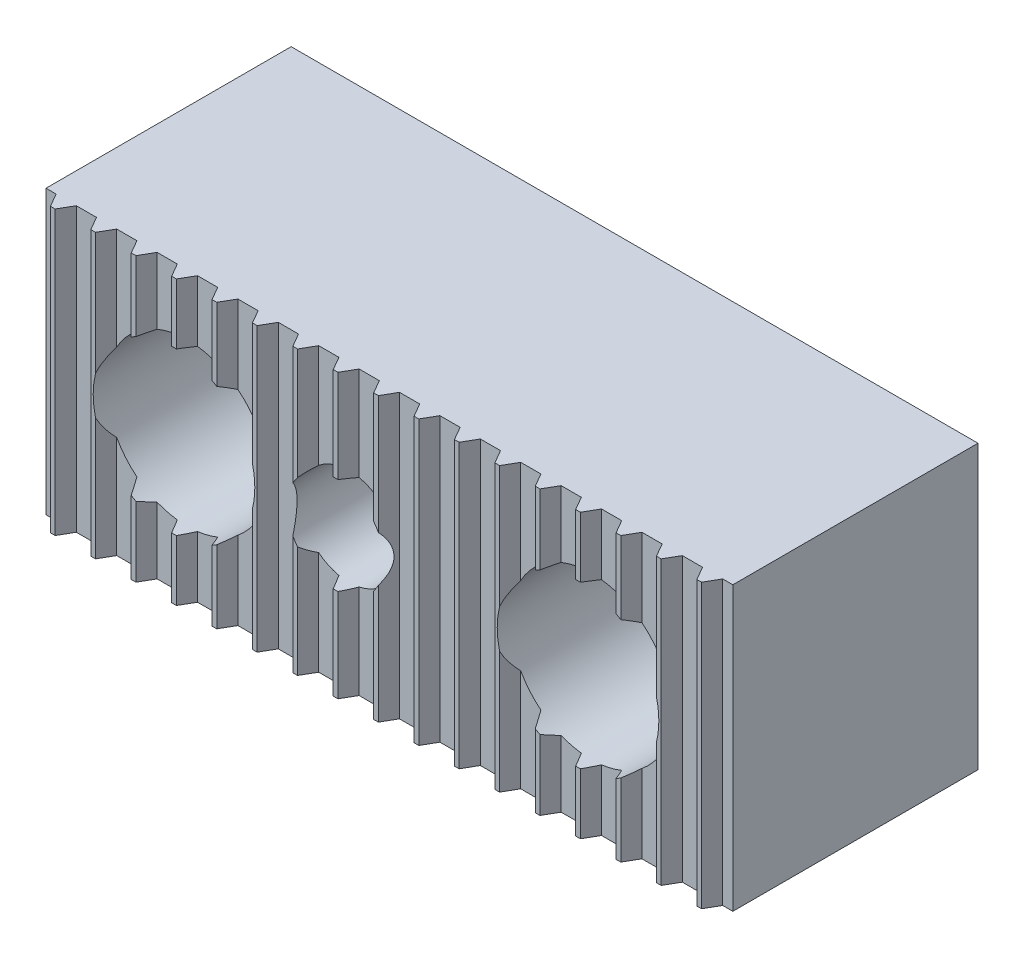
ISO-10303-21;
HEADER;
FILE_DESCRIPTION(('STEP AP214'),'2;1');
FILE_NAME('part.step','',(''),(''),'','','');
FILE_SCHEMA(('AUTOMOTIVE_DESIGN { 1 0 10303 214 1 1 1 1 }'));
ENDSEC;
DATA;
#1=APPLICATION_CONTEXT('core data for automotive mechanical design processes');
#2=APPLICATION_PROTOCOL_DEFINITION('international standard','automotive_design',2000,#1);
#3=PRODUCT_CONTEXT('',#1,'mechanical');
#4=PRODUCT('Part','Part','',(#3));
#5=PRODUCT_RELATED_PRODUCT_CATEGORY('part','',(#4));
#6=PRODUCT_DEFINITION_FORMATION('','',#4);
#7=PRODUCT_DEFINITION_CONTEXT('part definition',#1,'design');
#8=PRODUCT_DEFINITION('design','',#6,#7);
#9=PRODUCT_DEFINITION_SHAPE('','',#8);
#10=(LENGTH_UNIT() NAMED_UNIT(*) SI_UNIT(.MILLI.,.METRE.));
#11=(NAMED_UNIT(*) PLANE_ANGLE_UNIT() SI_UNIT($,.RADIAN.));
#12=(NAMED_UNIT(*) SI_UNIT($,.STERADIAN.) SOLID_ANGLE_UNIT());
#13=UNCERTAINTY_MEASURE_WITH_UNIT(LENGTH_MEASURE(1.E-05),#10,'distance_accuracy_value','');
#14=(GEOMETRIC_REPRESENTATION_CONTEXT(3) GLOBAL_UNCERTAINTY_ASSIGNED_CONTEXT((#13)) GLOBAL_UNIT_ASSIGNED_CONTEXT((#10,
#11,#12)) REPRESENTATION_CONTEXT('',''));
#15=CARTESIAN_POINT('',(0.,0.,0.));
#16=DIRECTION('',(0.,0.,1.));
#17=DIRECTION('',(1.,0.,0.));
#18=AXIS2_PLACEMENT_3D('',#15,#16,#17);
#19=CARTESIAN_POINT('',(67.5,-17.5,0.));
#20=DIRECTION('',(0.,0.,-1.));
#21=DIRECTION('',(1.,0.,0.));
#22=AXIS2_PLACEMENT_3D('',#19,#20,#21);
#23=PLANE('',#22);
#24=CARTESIAN_POINT('',(0.,0.,0.));
#25=DIRECTION('',(0.,0.,-1.));
#26=DIRECTION('',(1.,0.,0.));
#27=AXIS2_PLACEMENT_3D('',#24,#25,#26);
#28=CIRCLE('',#27,7.);
#29=CARTESIAN_POINT('',(7.,0.,0.));
#30=VERTEX_POINT('',#29);
#31=EDGE_CURVE('E721',#30,#30,#28,.T.);
#32=ORIENTED_EDGE('',*,*,#31,.F.);
#33=EDGE_LOOP('',(#32));
#34=FACE_BOUND('',#33,.T.);
#35=CARTESIAN_POINT('',(20.,0.,0.));
#36=DIRECTION('',(0.,0.,1.));
#37=DIRECTION('',(-1.,0.,0.));
#38=AXIS2_PLACEMENT_3D('',#35,#36,#37);
#39=CIRCLE('',#38,6.);
#40=CARTESIAN_POINT('',(14.,0.,0.));
#41=VERTEX_POINT('',#40);
#42=EDGE_CURVE('E1499',#41,#41,#39,.T.);
#43=ORIENTED_EDGE('',*,*,#42,.T.);
#44=EDGE_LOOP('',(#43));
#45=FACE_BOUND('',#44,.T.);
#46=DIRECTION('',(0.,1.,0.));
#47=VECTOR('',#46,1.);
#48=CARTESIAN_POINT('',(67.5,-17.5,0.));
#49=LINE('',#48,#47);
#50=CARTESIAN_POINT('',(67.5,-17.5,0.));
#51=VERTEX_POINT('',#50);
#52=CARTESIAN_POINT('',(67.5,17.5,0.));
#53=VERTEX_POINT('',#52);
#54=EDGE_CURVE('E759',#51,#53,#49,.T.);
#55=ORIENTED_EDGE('',*,*,#54,.F.);
#56=DIRECTION('',(-1.,0.,0.));
#57=VECTOR('',#56,1.);
#58=CARTESIAN_POINT('',(67.5,-17.5,0.));
#59=LINE('',#58,#57);
#60=CARTESIAN_POINT('',(-17.5,-17.5,0.));
#61=VERTEX_POINT('',#60);
#62=EDGE_CURVE('E1242',#51,#61,#59,.T.);
#63=ORIENTED_EDGE('',*,*,#62,.T.);
#64=DIRECTION('',(0.,1.,0.));
#65=VECTOR('',#64,1.);
#66=CARTESIAN_POINT('',(-17.5,-17.5,0.));
#67=LINE('',#66,#65);
#68=CARTESIAN_POINT('',(-17.5,17.5,0.));
#69=VERTEX_POINT('',#68);
#70=EDGE_CURVE('E761',#61,#69,#67,.T.);
#71=ORIENTED_EDGE('',*,*,#70,.T.);
#72=DIRECTION('',(-1.,0.,0.));
#73=VECTOR('',#72,1.);
#74=CARTESIAN_POINT('',(67.5,17.5,0.));
#75=LINE('',#74,#73);
#76=EDGE_CURVE('E1029',#53,#69,#75,.T.);
#77=ORIENTED_EDGE('',*,*,#76,.F.);
#78=EDGE_LOOP('',(#55,#63,#71,#77));
#79=FACE_BOUND('',#78,.T.);
#80=CARTESIAN_POINT('',(50.,0.,0.));
#81=DIRECTION('',(0.,0.,-1.));
#82=DIRECTION('',(1.,0.,0.));
#83=AXIS2_PLACEMENT_3D('',#80,#81,#82);
#84=CIRCLE('',#83,7.);
#85=CARTESIAN_POINT('',(57.,0.,0.));
#86=VERTEX_POINT('',#85);
#87=EDGE_CURVE('E1479',#86,#86,#84,.T.);
#88=ORIENTED_EDGE('',*,*,#87,.F.);
#89=EDGE_LOOP('',(#88));
#90=FACE_BOUND('',#89,.T.);
#91=ADVANCED_FACE('F14',(#34,#45,#79,#90),#23,.T.);
#92=CARTESIAN_POINT('',(60.2915985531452,-17.5,32.));
#93=DIRECTION('',(0.,0.,-1.));
#94=DIRECTION('',(1.,0.,0.));
#95=AXIS2_PLACEMENT_3D('',#92,#93,#94);
#96=PLANE('',#95);
#97=CARTESIAN_POINT('',(50.,0.,32.));
#98=DIRECTION('',(0.,0.,-1.));
#99=DIRECTION('',(1.,0.,0.));
#100=AXIS2_PLACEMENT_3D('',#97,#98,#99);
#101=CIRCLE('',#100,10.);
#102=CARTESIAN_POINT('',(59.7084014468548,2.3972779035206,32.));
#103=VERTEX_POINT('',#102);
#104=CARTESIAN_POINT('',(59.7084014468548,-2.3972779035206,32.));
#105=VERTEX_POINT('',#104);
#106=EDGE_CURVE('E714',#103,#105,#101,.T.);
#107=ORIENTED_EDGE('',*,*,#106,.T.);
#108=DIRECTION('',(0.,1.,0.));
#109=VECTOR('',#108,1.);
#110=CARTESIAN_POINT('',(59.7084014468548,-17.5,32.));
#111=LINE('',#110,#109);
#112=CARTESIAN_POINT('',(59.7084014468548,-17.5,32.));
#113=VERTEX_POINT('',#112);
#114=EDGE_CURVE('E728',#113,#105,#111,.T.);
#115=ORIENTED_EDGE('',*,*,#114,.F.);
#116=DIRECTION('',(-1.,0.,0.));
#117=VECTOR('',#116,1.);
#118=CARTESIAN_POINT('',(60.2915985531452,-17.5,32.));
#119=LINE('',#118,#117);
#120=CARTESIAN_POINT('',(60.2915985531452,-17.5,32.));
#121=VERTEX_POINT('',#120);
#122=EDGE_CURVE('E1219',#121,#113,#119,.T.);
#123=ORIENTED_EDGE('',*,*,#122,.F.);
#124=DIRECTION('',(0.,1.,0.));
#125=VECTOR('',#124,1.);
#126=CARTESIAN_POINT('',(60.2915985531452,-17.5,32.));
#127=LINE('',#126,#125);
#128=CARTESIAN_POINT('',(60.2915985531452,17.5,32.));
#129=VERTEX_POINT('',#128);
#130=EDGE_CURVE('E740',#121,#129,#127,.T.);
#131=ORIENTED_EDGE('',*,*,#130,.T.);
#132=DIRECTION('',(-1.,0.,0.));
#133=VECTOR('',#132,1.);
#134=CARTESIAN_POINT('',(60.2915985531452,17.5,32.));
#135=LINE('',#134,#133);
#136=CARTESIAN_POINT('',(59.7084014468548,17.5,32.));
#137=VERTEX_POINT('',#136);
#138=EDGE_CURVE('E1006',#129,#137,#135,.T.);
#139=ORIENTED_EDGE('',*,*,#138,.T.);
#140=EDGE_CURVE('E731',#103,#137,#111,.T.);
#141=ORIENTED_EDGE('',*,*,#140,.F.);
#142=EDGE_LOOP('',(#107,#115,#123,#131,#139,#141));
#143=FACE_BOUND('',#142,.T.);
#144=ADVANCED_FACE('F726',(#143),#96,.F.);
#145=CARTESIAN_POINT('',(59.7084014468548,-17.5,32.));
#146=DIRECTION('',(0.86602540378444,0.,-0.5));
#147=DIRECTION('',(0.5,0.,0.86602540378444));
#148=AXIS2_PLACEMENT_3D('',#145,#146,#147);
#149=PLANE('',#148);
#150=CARTESIAN_POINT('',(50.,0.,15.1845554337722));
#151=DIRECTION('',(0.86602540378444,0.,-0.5));
#152=DIRECTION('',(-0.5,0.,-0.86602540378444));
#153=AXIS2_PLACEMENT_3D('',#150,#151,#152);
#154=ELLIPSE('',#153,20.,10.);
#155=CARTESIAN_POINT('',(58.75,-4.84122918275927,30.34));
#156=VERTEX_POINT('',#155);
#157=EDGE_CURVE('E711',#156,#105,#154,.F.);
#158=ORIENTED_EDGE('',*,*,#157,.F.);
#159=DIRECTION('',(0.,1.,0.));
#160=VECTOR('',#159,1.);
#161=CARTESIAN_POINT('',(58.75,-17.5,30.34));
#162=LINE('',#161,#160);
#163=CARTESIAN_POINT('',(58.75,-17.5,30.34));
#164=VERTEX_POINT('',#163);
#165=EDGE_CURVE('E744',#164,#156,#162,.T.);
#166=ORIENTED_EDGE('',*,*,#165,.F.);
#167=DIRECTION('',(-0.5,0.,-0.86602540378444));
#168=VECTOR('',#167,1.);
#169=CARTESIAN_POINT('',(59.7084014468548,-17.5,32.));
#170=LINE('',#169,#168);
#171=EDGE_CURVE('E739',#113,#164,#170,.T.);
#172=ORIENTED_EDGE('',*,*,#171,.F.);
#173=ORIENTED_EDGE('',*,*,#114,.T.);
#174=EDGE_LOOP('',(#158,#166,#172,#173));
#175=FACE_BOUND('',#174,.T.);
#176=ADVANCED_FACE('F737',(#175),#149,.F.);
#177=CARTESIAN_POINT('',(58.75,4.84122918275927,30.34));
#178=VERTEX_POINT('',#177);
#179=EDGE_CURVE('E723',#103,#178,#154,.F.);
#180=ORIENTED_EDGE('',*,*,#179,.F.);
#181=ORIENTED_EDGE('',*,*,#140,.T.);
#182=DIRECTION('',(-0.5,0.,-0.86602540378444));
#183=VECTOR('',#182,1.);
#184=CARTESIAN_POINT('',(59.7084014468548,17.5,32.));
#185=LINE('',#184,#183);
#186=CARTESIAN_POINT('',(58.75,17.5,30.34));
#187=VERTEX_POINT('',#186);
#188=EDGE_CURVE('E993',#137,#187,#185,.T.);
#189=ORIENTED_EDGE('',*,*,#188,.T.);
#190=EDGE_CURVE('E969',#178,#187,#162,.T.);
#191=ORIENTED_EDGE('',*,*,#190,.F.);
#192=EDGE_LOOP('',(#180,#181,#189,#191));
#193=FACE_BOUND('',#192,.T.);
#194=ADVANCED_FACE('F1875',(#193),#149,.F.);
#195=CARTESIAN_POINT('',(58.75,-17.5,30.34));
#196=DIRECTION('',(0.,0.,-1.));
#197=DIRECTION('',(1.,0.,0.));
#198=AXIS2_PLACEMENT_3D('',#195,#196,#197);
#199=PLANE('',#198);
#200=CARTESIAN_POINT('',(50.,0.,30.34));
#201=DIRECTION('',(0.,0.,-1.));
#202=DIRECTION('',(1.,0.,0.));
#203=AXIS2_PLACEMENT_3D('',#200,#201,#202);
#204=CIRCLE('',#203,10.);
#205=CARTESIAN_POINT('',(56.25,7.80624749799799,30.34));
#206=VERTEX_POINT('',#205);
#207=EDGE_CURVE('E1541',#178,#206,#204,.F.);
#208=ORIENTED_EDGE('',*,*,#207,.F.);
#209=ORIENTED_EDGE('',*,*,#190,.T.);
#210=DIRECTION('',(-1.,0.,0.));
#211=VECTOR('',#210,1.);
#212=CARTESIAN_POINT('',(58.75,17.5,30.34));
#213=LINE('',#212,#211);
#214=CARTESIAN_POINT('',(56.25,17.5,30.34));
#215=VERTEX_POINT('',#214);
#216=EDGE_CURVE('E987',#187,#215,#213,.T.);
#217=ORIENTED_EDGE('',*,*,#216,.T.);
#218=DIRECTION('',(0.,1.,0.));
#219=VECTOR('',#218,1.);
#220=CARTESIAN_POINT('',(56.25,-17.5,30.34));
#221=LINE('',#220,#219);
#222=EDGE_CURVE('E966',#206,#215,#221,.T.);
#223=ORIENTED_EDGE('',*,*,#222,.F.);
#224=EDGE_LOOP('',(#208,#209,#217,#223));
#225=FACE_BOUND('',#224,.T.);
#226=ADVANCED_FACE('F988',(#225),#199,.F.);
#227=CARTESIAN_POINT('',(56.25,-7.80624749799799,30.34));
#228=VERTEX_POINT('',#227);
#229=EDGE_CURVE('E717',#228,#156,#204,.F.);
#230=ORIENTED_EDGE('',*,*,#229,.F.);
#231=CARTESIAN_POINT('',(56.25,-17.5,30.34));
#232=VERTEX_POINT('',#231);
#233=EDGE_CURVE('E967',#232,#228,#221,.T.);
#234=ORIENTED_EDGE('',*,*,#233,.F.);
#235=DIRECTION('',(-1.,0.,0.));
#236=VECTOR('',#235,1.);
#237=CARTESIAN_POINT('',(58.75,-17.5,30.34));
#238=LINE('',#237,#236);
#239=EDGE_CURVE('E1215',#164,#232,#238,.T.);
#240=ORIENTED_EDGE('',*,*,#239,.F.);
#241=ORIENTED_EDGE('',*,*,#165,.T.);
#242=EDGE_LOOP('',(#230,#234,#240,#241));
#243=FACE_BOUND('',#242,.T.);
#244=ADVANCED_FACE('F1538',(#243),#199,.F.);
#245=CARTESIAN_POINT('',(55.2915985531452,-17.5,32.));
#246=DIRECTION('',(0.866025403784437,0.,0.5));
#247=DIRECTION('',(-0.5,0.,0.866025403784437));
#248=AXIS2_PLACEMENT_3D('',#245,#246,#247);
#249=PLANE('',#248);
#250=ORIENTED_EDGE('',*,*,#233,.T.);
#251=CARTESIAN_POINT('',(50.,0.,41.1653175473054));
#252=DIRECTION('',(0.866025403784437,0.,0.5));
#253=DIRECTION('',(0.5,0.,-0.866025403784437));
#254=AXIS2_PLACEMENT_3D('',#251,#252,#253);
#255=ELLIPSE('',#254,20.,10.);
#256=CARTESIAN_POINT('',(55.2915985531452,-8.48522154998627,32.));
#257=VERTEX_POINT('',#256);
#258=EDGE_CURVE('E1539',#228,#257,#255,.F.);
#259=ORIENTED_EDGE('',*,*,#258,.T.);
#260=DIRECTION('',(0.,1.,0.));
#261=VECTOR('',#260,1.);
#262=CARTESIAN_POINT('',(55.2915985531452,-17.5,32.));
#263=LINE('',#262,#261);
#264=CARTESIAN_POINT('',(55.2915985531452,-17.5,32.));
#265=VERTEX_POINT('',#264);
#266=EDGE_CURVE('E964',#265,#257,#263,.T.);
#267=ORIENTED_EDGE('',*,*,#266,.F.);
#268=DIRECTION('',(0.5,0.,-0.866025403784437));
#269=VECTOR('',#268,1.);
#270=CARTESIAN_POINT('',(55.2915985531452,-17.5,32.));
#271=LINE('',#270,#269);
#272=EDGE_CURVE('E1213',#265,#232,#271,.T.);
#273=ORIENTED_EDGE('',*,*,#272,.T.);
#274=EDGE_LOOP('',(#250,#259,#267,#273));
#275=FACE_BOUND('',#274,.T.);
#276=ADVANCED_FACE('F1867',(#275),#249,.T.);
#277=CARTESIAN_POINT('',(55.2915985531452,8.48522154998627,32.));
#278=VERTEX_POINT('',#277);
#279=CARTESIAN_POINT('',(55.2915985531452,17.5,32.));
#280=VERTEX_POINT('',#279);
#281=EDGE_CURVE('E963',#278,#280,#263,.T.);
#282=ORIENTED_EDGE('',*,*,#281,.F.);
#283=EDGE_CURVE('E983',#278,#206,#255,.F.);
#284=ORIENTED_EDGE('',*,*,#283,.T.);
#285=ORIENTED_EDGE('',*,*,#222,.T.);
#286=DIRECTION('',(0.5,0.,-0.866025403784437));
#287=VECTOR('',#286,1.);
#288=CARTESIAN_POINT('',(55.2915985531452,17.5,32.));
#289=LINE('',#288,#287);
#290=EDGE_CURVE('E981',#280,#215,#289,.T.);
#291=ORIENTED_EDGE('',*,*,#290,.F.);
#292=EDGE_LOOP('',(#282,#284,#285,#291));
#293=FACE_BOUND('',#292,.T.);
#294=ADVANCED_FACE('F979',(#293),#249,.T.);
#295=CARTESIAN_POINT('',(55.2915985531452,-17.5,32.));
#296=DIRECTION('',(0.,0.,-1.));
#297=DIRECTION('',(1.,0.,0.));
#298=AXIS2_PLACEMENT_3D('',#295,#296,#297);
#299=PLANE('',#298);
#300=CARTESIAN_POINT('',(54.7084014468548,8.82218543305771,32.));
#301=VERTEX_POINT('',#300);
#302=EDGE_CURVE('E732',#301,#278,#101,.T.);
#303=ORIENTED_EDGE('',*,*,#302,.T.);
#304=ORIENTED_EDGE('',*,*,#281,.T.);
#305=DIRECTION('',(-1.,0.,0.));
#306=VECTOR('',#305,1.);
#307=CARTESIAN_POINT('',(55.2915985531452,17.5,32.));
#308=LINE('',#307,#306);
#309=CARTESIAN_POINT('',(54.7084014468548,17.5,32.));
#310=VERTEX_POINT('',#309);
#311=EDGE_CURVE('E999',#280,#310,#308,.T.);
#312=ORIENTED_EDGE('',*,*,#311,.T.);
#313=DIRECTION('',(0.,1.,0.));
#314=VECTOR('',#313,1.);
#315=CARTESIAN_POINT('',(54.7084014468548,-17.5,32.));
#316=LINE('',#315,#314);
#317=EDGE_CURVE('E959',#301,#310,#316,.T.);
#318=ORIENTED_EDGE('',*,*,#317,.F.);
#319=EDGE_LOOP('',(#303,#304,#312,#318));
#320=FACE_BOUND('',#319,.T.);
#321=ADVANCED_FACE('F1857',(#320),#299,.F.);
#322=CARTESIAN_POINT('',(54.7084014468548,-8.82218543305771,32.));
#323=VERTEX_POINT('',#322);
#324=EDGE_CURVE('E735',#257,#323,#101,.T.);
#325=ORIENTED_EDGE('',*,*,#324,.T.);
#326=CARTESIAN_POINT('',(54.7084014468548,-17.5,32.));
#327=VERTEX_POINT('',#326);
#328=EDGE_CURVE('E960',#327,#323,#316,.T.);
#329=ORIENTED_EDGE('',*,*,#328,.F.);
#330=DIRECTION('',(-1.,0.,0.));
#331=VECTOR('',#330,1.);
#332=CARTESIAN_POINT('',(55.2915985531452,-17.5,32.));
#333=LINE('',#332,#331);
#334=EDGE_CURVE('E1210',#265,#327,#333,.T.);
#335=ORIENTED_EDGE('',*,*,#334,.F.);
#336=ORIENTED_EDGE('',*,*,#266,.T.);
#337=EDGE_LOOP('',(#325,#329,#335,#336));
#338=FACE_BOUND('',#337,.T.);
#339=ADVANCED_FACE('F1859',(#338),#299,.F.);
#340=CARTESIAN_POINT('',(54.7084014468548,-17.5,32.));
#341=DIRECTION('',(0.86602540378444,0.,-0.5));
#342=DIRECTION('',(0.5,0.,0.86602540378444));
#343=AXIS2_PLACEMENT_3D('',#340,#341,#342);
#344=PLANE('',#343);
#345=CARTESIAN_POINT('',(50.,0.,23.8448094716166));
#346=DIRECTION('',(0.86602540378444,0.,-0.5));
#347=DIRECTION('',(-0.5,0.,-0.86602540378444));
#348=AXIS2_PLACEMENT_3D('',#345,#346,#347);
#349=ELLIPSE('',#348,20.,10.);
#350=CARTESIAN_POINT('',(53.75,-9.27024810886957,30.34));
#351=VERTEX_POINT('',#350);
#352=EDGE_CURVE('E1449',#351,#323,#349,.F.);
#353=ORIENTED_EDGE('',*,*,#352,.F.);
#354=DIRECTION('',(0.,1.,0.));
#355=VECTOR('',#354,1.);
#356=CARTESIAN_POINT('',(53.75,-17.5,30.34));
#357=LINE('',#356,#355);
#358=CARTESIAN_POINT('',(53.75,-17.5,30.34));
#359=VERTEX_POINT('',#358);
#360=EDGE_CURVE('E956',#359,#351,#357,.T.);
#361=ORIENTED_EDGE('',*,*,#360,.F.);
#362=DIRECTION('',(-0.5,0.,-0.86602540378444));
#363=VECTOR('',#362,1.);
#364=CARTESIAN_POINT('',(54.7084014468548,-17.5,32.));
#365=LINE('',#364,#363);
#366=EDGE_CURVE('E1207',#327,#359,#365,.T.);
#367=ORIENTED_EDGE('',*,*,#366,.F.);
#368=ORIENTED_EDGE('',*,*,#328,.T.);
#369=EDGE_LOOP('',(#353,#361,#367,#368));
#370=FACE_BOUND('',#369,.T.);
#371=ADVANCED_FACE('F1865',(#370),#344,.F.);
#372=CARTESIAN_POINT('',(53.75,9.27024810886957,30.34));
#373=VERTEX_POINT('',#372);
#374=EDGE_CURVE('E1443',#301,#373,#349,.F.);
#375=ORIENTED_EDGE('',*,*,#374,.F.);
#376=ORIENTED_EDGE('',*,*,#317,.T.);
#377=DIRECTION('',(-0.5,0.,-0.86602540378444));
#378=VECTOR('',#377,1.);
#379=CARTESIAN_POINT('',(54.7084014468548,17.5,32.));
#380=LINE('',#379,#378);
#381=CARTESIAN_POINT('',(53.75,17.5,30.34));
#382=VERTEX_POINT('',#381);
#383=EDGE_CURVE('E1001',#310,#382,#380,.T.);
#384=ORIENTED_EDGE('',*,*,#383,.T.);
#385=EDGE_CURVE('E955',#373,#382,#357,.T.);
#386=ORIENTED_EDGE('',*,*,#385,.F.);
#387=EDGE_LOOP('',(#375,#376,#384,#386));
#388=FACE_BOUND('',#387,.T.);
#389=ADVANCED_FACE('F1433',(#388),#344,.F.);
#390=CARTESIAN_POINT('',(53.75,-17.5,30.34));
#391=DIRECTION('',(0.,0.,-1.));
#392=DIRECTION('',(1.,0.,0.));
#393=AXIS2_PLACEMENT_3D('',#390,#391,#392);
#394=PLANE('',#393);
#395=CARTESIAN_POINT('',(50.,0.,30.34));
#396=DIRECTION('',(0.,0.,-1.));
#397=DIRECTION('',(1.,0.,0.));
#398=AXIS2_PLACEMENT_3D('',#395,#396,#397);
#399=CIRCLE('',#398,10.);
#400=CARTESIAN_POINT('',(51.25,9.92156741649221,30.34));
#401=VERTEX_POINT('',#400);
#402=EDGE_CURVE('E1441',#373,#401,#399,.F.);
#403=ORIENTED_EDGE('',*,*,#402,.F.);
#404=ORIENTED_EDGE('',*,*,#385,.T.);
#405=DIRECTION('',(-1.,0.,0.));
#406=VECTOR('',#405,1.);
#407=CARTESIAN_POINT('',(53.75,17.5,30.34));
#408=LINE('',#407,#406);
#409=CARTESIAN_POINT('',(51.25,17.5,30.34));
#410=VERTEX_POINT('',#409);
#411=EDGE_CURVE('E1426',#382,#410,#408,.T.);
#412=ORIENTED_EDGE('',*,*,#411,.T.);
#413=DIRECTION('',(0.,1.,0.));
#414=VECTOR('',#413,1.);
#415=CARTESIAN_POINT('',(51.25,-17.5,30.34));
#416=LINE('',#415,#414);
#417=EDGE_CURVE('E951',#401,#410,#416,.T.);
#418=ORIENTED_EDGE('',*,*,#417,.F.);
#419=EDGE_LOOP('',(#403,#404,#412,#418));
#420=FACE_BOUND('',#419,.T.);
#421=ADVANCED_FACE('F1440',(#420),#394,.F.);
#422=CARTESIAN_POINT('',(51.25,-9.9215674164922,30.34));
#423=VERTEX_POINT('',#422);
#424=EDGE_CURVE('E1446',#423,#351,#399,.F.);
#425=ORIENTED_EDGE('',*,*,#424,.F.);
#426=CARTESIAN_POINT('',(51.25,-17.5,30.34));
#427=VERTEX_POINT('',#426);
#428=EDGE_CURVE('E952',#427,#423,#416,.T.);
#429=ORIENTED_EDGE('',*,*,#428,.F.);
#430=DIRECTION('',(-1.,0.,0.));
#431=VECTOR('',#430,1.);
#432=CARTESIAN_POINT('',(53.75,-17.5,30.34));
#433=LINE('',#432,#431);
#434=EDGE_CURVE('E1204',#359,#427,#433,.T.);
#435=ORIENTED_EDGE('',*,*,#434,.F.);
#436=ORIENTED_EDGE('',*,*,#360,.T.);
#437=EDGE_LOOP('',(#425,#429,#435,#436));
#438=FACE_BOUND('',#437,.T.);
#439=ADVANCED_FACE('F2063',(#438),#394,.F.);
#440=CARTESIAN_POINT('',(50.2915985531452,-17.5,32.));
#441=DIRECTION('',(0.866025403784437,0.,0.5));
#442=DIRECTION('',(-0.5,0.,0.866025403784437));
#443=AXIS2_PLACEMENT_3D('',#440,#441,#442);
#444=PLANE('',#443);
#445=ORIENTED_EDGE('',*,*,#428,.T.);
#446=CARTESIAN_POINT('',(50.,0.,32.5050635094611));
#447=DIRECTION('',(0.866025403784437,0.,0.5));
#448=DIRECTION('',(0.5,0.,-0.866025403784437));
#449=AXIS2_PLACEMENT_3D('',#446,#447,#448);
#450=ELLIPSE('',#449,20.,10.);
#451=CARTESIAN_POINT('',(50.2915985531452,-9.99574761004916,32.));
#452=VERTEX_POINT('',#451);
#453=EDGE_CURVE('E1447',#423,#452,#450,.F.);
#454=ORIENTED_EDGE('',*,*,#453,.T.);
#455=DIRECTION('',(0.,1.,0.));
#456=VECTOR('',#455,1.);
#457=CARTESIAN_POINT('',(50.2915985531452,-17.5,32.));
#458=LINE('',#457,#456);
#459=CARTESIAN_POINT('',(50.2915985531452,-17.5,32.));
#460=VERTEX_POINT('',#459);
#461=EDGE_CURVE('E948',#460,#452,#458,.T.);
#462=ORIENTED_EDGE('',*,*,#461,.F.);
#463=DIRECTION('',(0.5,0.,-0.866025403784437));
#464=VECTOR('',#463,1.);
#465=CARTESIAN_POINT('',(50.2915985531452,-17.5,32.));
#466=LINE('',#465,#464);
#467=EDGE_CURVE('E1201',#460,#427,#466,.T.);
#468=ORIENTED_EDGE('',*,*,#467,.T.);
#469=EDGE_LOOP('',(#445,#454,#462,#468));
#470=FACE_BOUND('',#469,.T.);
#471=ADVANCED_FACE('F2061',(#470),#444,.T.);
#472=CARTESIAN_POINT('',(50.2915985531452,9.99574761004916,32.));
#473=VERTEX_POINT('',#472);
#474=CARTESIAN_POINT('',(50.2915985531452,17.5,32.));
#475=VERTEX_POINT('',#474);
#476=EDGE_CURVE('E947',#473,#475,#458,.T.);
#477=ORIENTED_EDGE('',*,*,#476,.F.);
#478=EDGE_CURVE('E1444',#473,#401,#450,.F.);
#479=ORIENTED_EDGE('',*,*,#478,.T.);
#480=ORIENTED_EDGE('',*,*,#417,.T.);
#481=DIRECTION('',(0.5,0.,-0.866025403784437));
#482=VECTOR('',#481,1.);
#483=CARTESIAN_POINT('',(50.2915985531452,17.5,32.));
#484=LINE('',#483,#482);
#485=EDGE_CURVE('E1423',#475,#410,#484,.T.);
#486=ORIENTED_EDGE('',*,*,#485,.F.);
#487=EDGE_LOOP('',(#477,#479,#480,#486));
#488=FACE_BOUND('',#487,.T.);
#489=ADVANCED_FACE('F1853',(#488),#444,.T.);
#490=CARTESIAN_POINT('',(50.2915985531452,-17.5,32.));
#491=DIRECTION('',(0.,0.,-1.));
#492=DIRECTION('',(1.,0.,0.));
#493=AXIS2_PLACEMENT_3D('',#490,#491,#492);
#494=PLANE('',#493);
#495=CARTESIAN_POINT('',(49.7084014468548,9.99574761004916,32.));
#496=VERTEX_POINT('',#495);
#497=EDGE_CURVE('E1851',#496,#473,#101,.T.);
#498=ORIENTED_EDGE('',*,*,#497,.T.);
#499=ORIENTED_EDGE('',*,*,#476,.T.);
#500=DIRECTION('',(-1.,0.,0.));
#501=VECTOR('',#500,1.);
#502=CARTESIAN_POINT('',(50.2915985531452,17.5,32.));
#503=LINE('',#502,#501);
#504=CARTESIAN_POINT('',(49.7084014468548,17.5,32.));
#505=VERTEX_POINT('',#504);
#506=EDGE_CURVE('E1420',#475,#505,#503,.T.);
#507=ORIENTED_EDGE('',*,*,#506,.T.);
#508=DIRECTION('',(0.,1.,0.));
#509=VECTOR('',#508,1.);
#510=CARTESIAN_POINT('',(49.7084014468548,-17.5,32.));
#511=LINE('',#510,#509);
#512=EDGE_CURVE('E943',#496,#505,#511,.T.);
#513=ORIENTED_EDGE('',*,*,#512,.F.);
#514=EDGE_LOOP('',(#498,#499,#507,#513));
#515=FACE_BOUND('',#514,.T.);
#516=ADVANCED_FACE('F1849',(#515),#494,.F.);
#517=CARTESIAN_POINT('',(49.7084014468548,-9.99574761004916,32.));
#518=VERTEX_POINT('',#517);
#519=EDGE_CURVE('E2083',#452,#518,#101,.T.);
#520=ORIENTED_EDGE('',*,*,#519,.T.);
#521=CARTESIAN_POINT('',(49.7084014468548,-17.5,32.));
#522=VERTEX_POINT('',#521);
#523=EDGE_CURVE('E944',#522,#518,#511,.T.);
#524=ORIENTED_EDGE('',*,*,#523,.F.);
#525=DIRECTION('',(-1.,0.,0.));
#526=VECTOR('',#525,1.);
#527=CARTESIAN_POINT('',(50.2915985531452,-17.5,32.));
#528=LINE('',#527,#526);
#529=EDGE_CURVE('E1198',#460,#522,#528,.T.);
#530=ORIENTED_EDGE('',*,*,#529,.F.);
#531=ORIENTED_EDGE('',*,*,#461,.T.);
#532=EDGE_LOOP('',(#520,#524,#530,#531));
#533=FACE_BOUND('',#532,.T.);
#534=ADVANCED_FACE('F2057',(#533),#494,.F.);
#535=CARTESIAN_POINT('',(49.7084014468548,-17.5,32.));
#536=DIRECTION('',(0.866025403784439,0.,-0.5));
#537=DIRECTION('',(0.5,0.,0.866025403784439));
#538=AXIS2_PLACEMENT_3D('',#535,#536,#537);
#539=PLANE('',#538);
#540=CARTESIAN_POINT('',(50.,0.,32.5050635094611));
#541=DIRECTION('',(0.866025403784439,0.,-0.5));
#542=DIRECTION('',(-0.5,0.,-0.866025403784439));
#543=AXIS2_PLACEMENT_3D('',#540,#541,#542);
#544=ELLIPSE('',#543,20.,10.);
#545=CARTESIAN_POINT('',(48.75,-9.9215674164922,30.34));
#546=VERTEX_POINT('',#545);
#547=EDGE_CURVE('E1450',#546,#518,#544,.F.);
#548=ORIENTED_EDGE('',*,*,#547,.F.);
#549=DIRECTION('',(0.,1.,0.));
#550=VECTOR('',#549,1.);
#551=CARTESIAN_POINT('',(48.75,-17.5,30.34));
#552=LINE('',#551,#550);
#553=CARTESIAN_POINT('',(48.75,-17.5,30.34));
#554=VERTEX_POINT('',#553);
#555=EDGE_CURVE('E940',#554,#546,#552,.T.);
#556=ORIENTED_EDGE('',*,*,#555,.F.);
#557=DIRECTION('',(-0.5,0.,-0.866025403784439));
#558=VECTOR('',#557,1.);
#559=CARTESIAN_POINT('',(49.7084014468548,-17.5,32.));
#560=LINE('',#559,#558);
#561=EDGE_CURVE('E1195',#522,#554,#560,.T.);
#562=ORIENTED_EDGE('',*,*,#561,.F.);
#563=ORIENTED_EDGE('',*,*,#523,.T.);
#564=EDGE_LOOP('',(#548,#556,#562,#563));
#565=FACE_BOUND('',#564,.T.);
#566=ADVANCED_FACE('F2054',(#565),#539,.F.);
#567=CARTESIAN_POINT('',(48.75,9.9215674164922,30.34));
#568=VERTEX_POINT('',#567);
#569=EDGE_CURVE('E1457',#496,#568,#544,.F.);
#570=ORIENTED_EDGE('',*,*,#569,.F.);
#571=ORIENTED_EDGE('',*,*,#512,.T.);
#572=DIRECTION('',(-0.5,0.,-0.866025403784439));
#573=VECTOR('',#572,1.);
#574=CARTESIAN_POINT('',(49.7084014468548,17.5,32.));
#575=LINE('',#574,#573);
#576=CARTESIAN_POINT('',(48.75,17.5,30.34));
#577=VERTEX_POINT('',#576);
#578=EDGE_CURVE('E1417',#505,#577,#575,.T.);
#579=ORIENTED_EDGE('',*,*,#578,.T.);
#580=EDGE_CURVE('E939',#568,#577,#552,.T.);
#581=ORIENTED_EDGE('',*,*,#580,.F.);
#582=EDGE_LOOP('',(#570,#571,#579,#581));
#583=FACE_BOUND('',#582,.T.);
#584=ADVANCED_FACE('F1845',(#583),#539,.F.);
#585=CARTESIAN_POINT('',(48.75,-17.5,30.34));
#586=DIRECTION('',(0.,0.,-1.));
#587=DIRECTION('',(1.,0.,0.));
#588=AXIS2_PLACEMENT_3D('',#585,#586,#587);
#589=PLANE('',#588);
#590=CARTESIAN_POINT('',(50.,0.,30.34));
#591=DIRECTION('',(0.,0.,-1.));
#592=DIRECTION('',(1.,0.,0.));
#593=AXIS2_PLACEMENT_3D('',#590,#591,#592);
#594=CIRCLE('',#593,10.);
#595=CARTESIAN_POINT('',(46.25,9.27024810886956,30.34));
#596=VERTEX_POINT('',#595);
#597=EDGE_CURVE('E1460',#568,#596,#594,.F.);
#598=ORIENTED_EDGE('',*,*,#597,.F.);
#599=ORIENTED_EDGE('',*,*,#580,.T.);
#600=DIRECTION('',(-1.,0.,0.));
#601=VECTOR('',#600,1.);
#602=CARTESIAN_POINT('',(48.75,17.5,30.34));
#603=LINE('',#602,#601);
#604=CARTESIAN_POINT('',(46.25,17.5,30.34));
#605=VERTEX_POINT('',#604);
#606=EDGE_CURVE('E1414',#577,#605,#603,.T.);
#607=ORIENTED_EDGE('',*,*,#606,.T.);
#608=DIRECTION('',(0.,1.,0.));
#609=VECTOR('',#608,1.);
#610=CARTESIAN_POINT('',(46.25,-17.5,30.34));
#611=LINE('',#610,#609);
#612=EDGE_CURVE('E935',#596,#605,#611,.T.);
#613=ORIENTED_EDGE('',*,*,#612,.F.);
#614=EDGE_LOOP('',(#598,#599,#607,#613));
#615=FACE_BOUND('',#614,.T.);
#616=ADVANCED_FACE('F1840',(#615),#589,.F.);
#617=CARTESIAN_POINT('',(46.25,-9.27024810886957,30.34));
#618=VERTEX_POINT('',#617);
#619=EDGE_CURVE('E1463',#618,#546,#594,.F.);
#620=ORIENTED_EDGE('',*,*,#619,.F.);
#621=CARTESIAN_POINT('',(46.25,-17.5,30.34));
#622=VERTEX_POINT('',#621);
#623=EDGE_CURVE('E936',#622,#618,#611,.T.);
#624=ORIENTED_EDGE('',*,*,#623,.F.);
#625=DIRECTION('',(-1.,0.,0.));
#626=VECTOR('',#625,1.);
#627=CARTESIAN_POINT('',(48.75,-17.5,30.34));
#628=LINE('',#627,#626);
#629=EDGE_CURVE('E1192',#554,#622,#628,.T.);
#630=ORIENTED_EDGE('',*,*,#629,.F.);
#631=ORIENTED_EDGE('',*,*,#555,.T.);
#632=EDGE_LOOP('',(#620,#624,#630,#631));
#633=FACE_BOUND('',#632,.T.);
#634=ADVANCED_FACE('F2050',(#633),#589,.F.);
#635=CARTESIAN_POINT('',(45.2915985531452,-17.5,32.));
#636=DIRECTION('',(0.866025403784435,0.,0.500000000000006));
#637=DIRECTION('',(-0.500000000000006,0.,0.866025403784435));
#638=AXIS2_PLACEMENT_3D('',#635,#636,#637);
#639=PLANE('',#638);
#640=ORIENTED_EDGE('',*,*,#623,.T.);
#641=CARTESIAN_POINT('',(50.,0.,23.8448094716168));
#642=DIRECTION('',(0.866025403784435,0.,0.500000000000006));
#643=DIRECTION('',(0.500000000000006,0.,-0.866025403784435));
#644=AXIS2_PLACEMENT_3D('',#641,#642,#643);
#645=ELLIPSE('',#644,19.9999999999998,10.);
#646=CARTESIAN_POINT('',(45.2915985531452,-8.8221854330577,32.));
#647=VERTEX_POINT('',#646);
#648=EDGE_CURVE('E1459',#618,#647,#645,.F.);
#649=ORIENTED_EDGE('',*,*,#648,.T.);
#650=DIRECTION('',(0.,1.,0.));
#651=VECTOR('',#650,1.);
#652=CARTESIAN_POINT('',(45.2915985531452,-17.5,32.));
#653=LINE('',#652,#651);
#654=CARTESIAN_POINT('',(45.2915985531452,-17.5,32.));
#655=VERTEX_POINT('',#654);
#656=EDGE_CURVE('E932',#655,#647,#653,.T.);
#657=ORIENTED_EDGE('',*,*,#656,.F.);
#658=DIRECTION('',(0.500000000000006,0.,-0.866025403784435));
#659=VECTOR('',#658,1.);
#660=CARTESIAN_POINT('',(45.2915985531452,-17.5,32.));
#661=LINE('',#660,#659);
#662=EDGE_CURVE('E1189',#655,#622,#661,.T.);
#663=ORIENTED_EDGE('',*,*,#662,.T.);
#664=EDGE_LOOP('',(#640,#649,#657,#663));
#665=FACE_BOUND('',#664,.T.);
#666=ADVANCED_FACE('F2047',(#665),#639,.T.);
#667=CARTESIAN_POINT('',(45.2915985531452,8.8221854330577,32.));
#668=VERTEX_POINT('',#667);
#669=CARTESIAN_POINT('',(45.2915985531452,17.5,32.));
#670=VERTEX_POINT('',#669);
#671=EDGE_CURVE('E931',#668,#670,#653,.T.);
#672=ORIENTED_EDGE('',*,*,#671,.F.);
#673=EDGE_CURVE('E1462',#668,#596,#645,.F.);
#674=ORIENTED_EDGE('',*,*,#673,.T.);
#675=ORIENTED_EDGE('',*,*,#612,.T.);
#676=DIRECTION('',(0.500000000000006,0.,-0.866025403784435));
#677=VECTOR('',#676,1.);
#678=CARTESIAN_POINT('',(45.2915985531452,17.5,32.));
#679=LINE('',#678,#677);
#680=EDGE_CURVE('E1411',#670,#605,#679,.T.);
#681=ORIENTED_EDGE('',*,*,#680,.F.);
#682=EDGE_LOOP('',(#672,#674,#675,#681));
#683=FACE_BOUND('',#682,.T.);
#684=ADVANCED_FACE('F1836',(#683),#639,.T.);
#685=CARTESIAN_POINT('',(45.2915985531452,-17.5,32.));
#686=DIRECTION('',(0.,0.,-1.));
#687=DIRECTION('',(1.,0.,0.));
#688=AXIS2_PLACEMENT_3D('',#685,#686,#687);
#689=PLANE('',#688);
#690=CARTESIAN_POINT('',(44.7084014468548,8.48522154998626,32.));
#691=VERTEX_POINT('',#690);
#692=EDGE_CURVE('E1834',#691,#668,#101,.T.);
#693=ORIENTED_EDGE('',*,*,#692,.T.);
#694=ORIENTED_EDGE('',*,*,#671,.T.);
#695=DIRECTION('',(-1.,0.,0.));
#696=VECTOR('',#695,1.);
#697=CARTESIAN_POINT('',(45.2915985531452,17.5,32.));
#698=LINE('',#697,#696);
#699=CARTESIAN_POINT('',(44.7084014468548,17.5,32.));
#700=VERTEX_POINT('',#699);
#701=EDGE_CURVE('E1408',#670,#700,#698,.T.);
#702=ORIENTED_EDGE('',*,*,#701,.T.);
#703=DIRECTION('',(0.,1.,0.));
#704=VECTOR('',#703,1.);
#705=CARTESIAN_POINT('',(44.7084014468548,-17.5,32.));
#706=LINE('',#705,#704);
#707=EDGE_CURVE('E927',#691,#700,#706,.T.);
#708=ORIENTED_EDGE('',*,*,#707,.F.);
#709=EDGE_LOOP('',(#693,#694,#702,#708));
#710=FACE_BOUND('',#709,.T.);
#711=ADVANCED_FACE('F1832',(#710),#689,.F.);
#712=CARTESIAN_POINT('',(44.7084014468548,-8.48522154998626,32.));
#713=VERTEX_POINT('',#712);
#714=EDGE_CURVE('E1854',#647,#713,#101,.T.);
#715=ORIENTED_EDGE('',*,*,#714,.T.);
#716=CARTESIAN_POINT('',(44.7084014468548,-17.5,32.));
#717=VERTEX_POINT('',#716);
#718=EDGE_CURVE('E928',#717,#713,#706,.T.);
#719=ORIENTED_EDGE('',*,*,#718,.F.);
#720=DIRECTION('',(-1.,0.,0.));
#721=VECTOR('',#720,1.);
#722=CARTESIAN_POINT('',(45.2915985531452,-17.5,32.));
#723=LINE('',#722,#721);
#724=EDGE_CURVE('E1186',#655,#717,#723,.T.);
#725=ORIENTED_EDGE('',*,*,#724,.F.);
#726=ORIENTED_EDGE('',*,*,#656,.T.);
#727=EDGE_LOOP('',(#715,#719,#725,#726));
#728=FACE_BOUND('',#727,.T.);
#729=ADVANCED_FACE('F2043',(#728),#689,.F.);
#730=CARTESIAN_POINT('',(44.7084014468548,-17.5,32.));
#731=DIRECTION('',(0.86602540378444,0.,-0.5));
#732=DIRECTION('',(0.5,0.,0.86602540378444));
#733=AXIS2_PLACEMENT_3D('',#730,#731,#732);
#734=PLANE('',#733);
#735=CARTESIAN_POINT('',(50.,0.,41.1653175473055));
#736=DIRECTION('',(0.86602540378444,0.,-0.5));
#737=DIRECTION('',(-0.5,0.,-0.86602540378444));
#738=AXIS2_PLACEMENT_3D('',#735,#736,#737);
#739=ELLIPSE('',#738,20.,10.);
#740=CARTESIAN_POINT('',(43.75,-7.80624749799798,30.34));
#741=VERTEX_POINT('',#740);
#742=EDGE_CURVE('E1466',#741,#713,#739,.F.);
#743=ORIENTED_EDGE('',*,*,#742,.F.);
#744=DIRECTION('',(0.,1.,0.));
#745=VECTOR('',#744,1.);
#746=CARTESIAN_POINT('',(43.75,-17.5,30.34));
#747=LINE('',#746,#745);
#748=CARTESIAN_POINT('',(43.75,-17.5,30.34));
#749=VERTEX_POINT('',#748);
#750=EDGE_CURVE('E924',#749,#741,#747,.T.);
#751=ORIENTED_EDGE('',*,*,#750,.F.);
#752=DIRECTION('',(-0.5,0.,-0.86602540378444));
#753=VECTOR('',#752,1.);
#754=CARTESIAN_POINT('',(44.7084014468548,-17.5,32.));
#755=LINE('',#754,#753);
#756=EDGE_CURVE('E1183',#717,#749,#755,.T.);
#757=ORIENTED_EDGE('',*,*,#756,.F.);
#758=ORIENTED_EDGE('',*,*,#718,.T.);
#759=EDGE_LOOP('',(#743,#751,#757,#758));
#760=FACE_BOUND('',#759,.T.);
#761=ADVANCED_FACE('F2040',(#760),#734,.F.);
#762=CARTESIAN_POINT('',(43.75,7.80624749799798,30.34));
#763=VERTEX_POINT('',#762);
#764=EDGE_CURVE('E1467',#691,#763,#739,.F.);
#765=ORIENTED_EDGE('',*,*,#764,.F.);
#766=ORIENTED_EDGE('',*,*,#707,.T.);
#767=DIRECTION('',(-0.5,0.,-0.86602540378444));
#768=VECTOR('',#767,1.);
#769=CARTESIAN_POINT('',(44.7084014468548,17.5,32.));
#770=LINE('',#769,#768);
#771=CARTESIAN_POINT('',(43.75,17.5,30.34));
#772=VERTEX_POINT('',#771);
#773=EDGE_CURVE('E1405',#700,#772,#770,.T.);
#774=ORIENTED_EDGE('',*,*,#773,.T.);
#775=EDGE_CURVE('E923',#763,#772,#747,.T.);
#776=ORIENTED_EDGE('',*,*,#775,.F.);
#777=EDGE_LOOP('',(#765,#766,#774,#776));
#778=FACE_BOUND('',#777,.T.);
#779=ADVANCED_FACE('F1825',(#778),#734,.F.);
#780=CARTESIAN_POINT('',(43.75,-17.5,30.34));
#781=DIRECTION('',(0.,0.,-1.));
#782=DIRECTION('',(1.,0.,0.));
#783=AXIS2_PLACEMENT_3D('',#780,#781,#782);
#784=PLANE('',#783);
#785=CARTESIAN_POINT('',(50.,0.,30.34));
#786=DIRECTION('',(0.,0.,-1.));
#787=DIRECTION('',(1.,0.,0.));
#788=AXIS2_PLACEMENT_3D('',#785,#786,#787);
#789=CIRCLE('',#788,10.);
#790=CARTESIAN_POINT('',(41.25,4.84122918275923,30.34));
#791=VERTEX_POINT('',#790);
#792=EDGE_CURVE('E1470',#763,#791,#789,.F.);
#793=ORIENTED_EDGE('',*,*,#792,.F.);
#794=ORIENTED_EDGE('',*,*,#775,.T.);
#795=DIRECTION('',(-1.,0.,0.));
#796=VECTOR('',#795,1.);
#797=CARTESIAN_POINT('',(43.75,17.5,30.34));
#798=LINE('',#797,#796);
#799=CARTESIAN_POINT('',(41.25,17.5,30.34));
#800=VERTEX_POINT('',#799);
#801=EDGE_CURVE('E1402',#772,#800,#798,.T.);
#802=ORIENTED_EDGE('',*,*,#801,.T.);
#803=DIRECTION('',(0.,1.,0.));
#804=VECTOR('',#803,1.);
#805=CARTESIAN_POINT('',(41.25,-17.5,30.34));
#806=LINE('',#805,#804);
#807=EDGE_CURVE('E919',#791,#800,#806,.T.);
#808=ORIENTED_EDGE('',*,*,#807,.F.);
#809=EDGE_LOOP('',(#793,#794,#802,#808));
#810=FACE_BOUND('',#809,.T.);
#811=ADVANCED_FACE('F1821',(#810),#784,.F.);
#812=CARTESIAN_POINT('',(41.25,-4.84122918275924,30.34));
#813=VERTEX_POINT('',#812);
#814=EDGE_CURVE('E1472',#813,#741,#789,.F.);
#815=ORIENTED_EDGE('',*,*,#814,.F.);
#816=CARTESIAN_POINT('',(41.25,-17.5,30.34));
#817=VERTEX_POINT('',#816);
#818=EDGE_CURVE('E920',#817,#813,#806,.T.);
#819=ORIENTED_EDGE('',*,*,#818,.F.);
#820=DIRECTION('',(-1.,0.,0.));
#821=VECTOR('',#820,1.);
#822=CARTESIAN_POINT('',(43.75,-17.5,30.34));
#823=LINE('',#822,#821);
#824=EDGE_CURVE('E1180',#749,#817,#823,.T.);
#825=ORIENTED_EDGE('',*,*,#824,.F.);
#826=ORIENTED_EDGE('',*,*,#750,.T.);
#827=EDGE_LOOP('',(#815,#819,#825,#826));
#828=FACE_BOUND('',#827,.T.);
#829=ADVANCED_FACE('F2036',(#828),#784,.F.);
#830=CARTESIAN_POINT('',(40.2915985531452,-17.5,32.));
#831=DIRECTION('',(0.866025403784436,0.,0.5));
#832=DIRECTION('',(-0.5,0.,0.866025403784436));
#833=AXIS2_PLACEMENT_3D('',#830,#831,#832);
#834=PLANE('',#833);
#835=ORIENTED_EDGE('',*,*,#818,.T.);
#836=CARTESIAN_POINT('',(50.,0.,15.1845554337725));
#837=DIRECTION('',(0.866025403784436,0.,0.5));
#838=DIRECTION('',(0.5,0.,-0.866025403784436));
#839=AXIS2_PLACEMENT_3D('',#836,#837,#838);
#840=ELLIPSE('',#839,20.,10.);
#841=CARTESIAN_POINT('',(40.2915985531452,-2.39727790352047,32.));
#842=VERTEX_POINT('',#841);
#843=EDGE_CURVE('E1469',#813,#842,#840,.F.);
#844=ORIENTED_EDGE('',*,*,#843,.T.);
#845=DIRECTION('',(0.,1.,0.));
#846=VECTOR('',#845,1.);
#847=CARTESIAN_POINT('',(40.2915985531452,-17.5,32.));
#848=LINE('',#847,#846);
#849=CARTESIAN_POINT('',(40.2915985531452,-17.5,32.));
#850=VERTEX_POINT('',#849);
#851=EDGE_CURVE('E916',#850,#842,#848,.T.);
#852=ORIENTED_EDGE('',*,*,#851,.F.);
#853=DIRECTION('',(0.5,0.,-0.866025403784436));
#854=VECTOR('',#853,1.);
#855=CARTESIAN_POINT('',(40.2915985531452,-17.5,32.));
#856=LINE('',#855,#854);
#857=EDGE_CURVE('E1177',#850,#817,#856,.T.);
#858=ORIENTED_EDGE('',*,*,#857,.T.);
#859=EDGE_LOOP('',(#835,#844,#852,#858));
#860=FACE_BOUND('',#859,.T.);
#861=ADVANCED_FACE('F2033',(#860),#834,.T.);
#862=CARTESIAN_POINT('',(40.2915985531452,2.39727790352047,32.));
#863=VERTEX_POINT('',#862);
#864=CARTESIAN_POINT('',(40.2915985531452,17.5,32.));
#865=VERTEX_POINT('',#864);
#866=EDGE_CURVE('E915',#863,#865,#848,.T.);
#867=ORIENTED_EDGE('',*,*,#866,.F.);
#868=EDGE_CURVE('E27',#863,#791,#840,.F.);
#869=ORIENTED_EDGE('',*,*,#868,.T.);
#870=ORIENTED_EDGE('',*,*,#807,.T.);
#871=DIRECTION('',(0.5,0.,-0.866025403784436));
#872=VECTOR('',#871,1.);
#873=CARTESIAN_POINT('',(40.2915985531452,17.5,32.));
#874=LINE('',#873,#872);
#875=EDGE_CURVE('E1399',#865,#800,#874,.T.);
#876=ORIENTED_EDGE('',*,*,#875,.F.);
#877=EDGE_LOOP('',(#867,#869,#870,#876));
#878=FACE_BOUND('',#877,.T.);
#879=ADVANCED_FACE('F1817',(#878),#834,.T.);
#880=CARTESIAN_POINT('',(40.2915985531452,-17.5,32.));
#881=DIRECTION('',(0.,0.,-1.));
#882=DIRECTION('',(1.,0.,0.));
#883=AXIS2_PLACEMENT_3D('',#880,#881,#882);
#884=PLANE('',#883);
#885=CARTESIAN_POINT('',(50.,0.,32.));
#886=DIRECTION('',(0.,0.,-1.));
#887=DIRECTION('',(1.,0.,0.));
#888=AXIS2_PLACEMENT_3D('',#885,#886,#887);
#889=CIRCLE('',#888,10.);
#890=EDGE_CURVE('E9',#863,#842,#889,.F.);
#891=ORIENTED_EDGE('',*,*,#890,.F.);
#892=ORIENTED_EDGE('',*,*,#866,.T.);
#893=DIRECTION('',(-1.,0.,0.));
#894=VECTOR('',#893,1.);
#895=CARTESIAN_POINT('',(40.2915985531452,17.5,32.));
#896=LINE('',#895,#894);
#897=CARTESIAN_POINT('',(39.7084014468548,17.5,32.));
#898=VERTEX_POINT('',#897);
#899=EDGE_CURVE('E1396',#865,#898,#896,.T.);
#900=ORIENTED_EDGE('',*,*,#899,.T.);
#901=DIRECTION('',(0.,1.,0.));
#902=VECTOR('',#901,1.);
#903=CARTESIAN_POINT('',(39.7084014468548,-17.5,32.));
#904=LINE('',#903,#902);
#905=CARTESIAN_POINT('',(39.7084014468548,-17.5,32.));
#906=VERTEX_POINT('',#905);
#907=EDGE_CURVE('E913',#906,#898,#904,.T.);
#908=ORIENTED_EDGE('',*,*,#907,.F.);
#909=DIRECTION('',(-1.,0.,0.));
#910=VECTOR('',#909,1.);
#911=CARTESIAN_POINT('',(40.2915985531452,-17.5,32.));
#912=LINE('',#911,#910);
#913=EDGE_CURVE('E1174',#850,#906,#912,.T.);
#914=ORIENTED_EDGE('',*,*,#913,.F.);
#915=ORIENTED_EDGE('',*,*,#851,.T.);
#916=EDGE_LOOP('',(#891,#892,#900,#908,#914,#915));
#917=FACE_BOUND('',#916,.T.);
#918=ADVANCED_FACE('F1811',(#917),#884,.F.);
#919=CARTESIAN_POINT('',(9.7084014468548,-17.5,32.));
#920=DIRECTION('',(0.,0.,1.));
#921=DIRECTION('',(-1.,0.,0.));
#922=AXIS2_PLACEMENT_3D('',#919,#920,#921);
#923=PLANE('',#922);
#924=DIRECTION('',(0.,1.,0.));
#925=VECTOR('',#924,1.);
#926=CARTESIAN_POINT('',(9.7084014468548,-17.5,32.));
#927=LINE('',#926,#925);
#928=CARTESIAN_POINT('',(9.7084014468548,2.39727790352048,32.));
#929=VERTEX_POINT('',#928);
#930=CARTESIAN_POINT('',(9.7084014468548,17.5,32.));
#931=VERTEX_POINT('',#930);
#932=EDGE_CURVE('E843',#929,#931,#927,.T.);
#933=ORIENTED_EDGE('',*,*,#932,.F.);
#934=CARTESIAN_POINT('',(0.,0.,32.));
#935=DIRECTION('',(0.,0.,-1.));
#936=DIRECTION('',(1.,0.,0.));
#937=AXIS2_PLACEMENT_3D('',#934,#935,#936);
#938=CIRCLE('',#937,10.);
#939=CARTESIAN_POINT('',(9.7084014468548,-2.39727790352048,32.));
#940=VERTEX_POINT('',#939);
#941=EDGE_CURVE('E1551',#929,#940,#938,.T.);
#942=ORIENTED_EDGE('',*,*,#941,.T.);
#943=CARTESIAN_POINT('',(9.7084014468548,-17.5,32.));
#944=VERTEX_POINT('',#943);
#945=EDGE_CURVE('E844',#944,#940,#927,.T.);
#946=ORIENTED_EDGE('',*,*,#945,.F.);
#947=DIRECTION('',(1.,0.,0.));
#948=VECTOR('',#947,1.);
#949=CARTESIAN_POINT('',(9.7084014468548,-17.5,32.));
#950=LINE('',#949,#948);
#951=CARTESIAN_POINT('',(10.2915985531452,-17.5,32.));
#952=VERTEX_POINT('',#951);
#953=EDGE_CURVE('E1102',#944,#952,#950,.T.);
#954=ORIENTED_EDGE('',*,*,#953,.T.);
#955=DIRECTION('',(0.,1.,0.));
#956=VECTOR('',#955,1.);
#957=CARTESIAN_POINT('',(10.2915985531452,-17.5,32.));
#958=LINE('',#957,#956);
#959=CARTESIAN_POINT('',(10.2915985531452,17.5,32.));
#960=VERTEX_POINT('',#959);
#961=EDGE_CURVE('E847',#952,#960,#958,.T.);
#962=ORIENTED_EDGE('',*,*,#961,.T.);
#963=DIRECTION('',(1.,0.,0.));
#964=VECTOR('',#963,1.);
#965=CARTESIAN_POINT('',(9.7084014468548,17.5,32.));
#966=LINE('',#965,#964);
#967=EDGE_CURVE('E1324',#931,#960,#966,.T.);
#968=ORIENTED_EDGE('',*,*,#967,.F.);
#969=EDGE_LOOP('',(#933,#942,#946,#954,#962,#968));
#970=FACE_BOUND('',#969,.T.);
#971=ADVANCED_FACE('F1705',(#970),#923,.T.);
#972=CARTESIAN_POINT('',(9.7084014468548,-17.5,32.));
#973=DIRECTION('',(0.866025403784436,0.,-0.5));
#974=DIRECTION('',(0.5,0.,0.866025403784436));
#975=AXIS2_PLACEMENT_3D('',#972,#973,#974);
#976=PLANE('',#975);
#977=CARTESIAN_POINT('',(0.,0.,15.1845554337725));
#978=DIRECTION('',(0.866025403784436,0.,-0.5));
#979=DIRECTION('',(-0.5,0.,-0.866025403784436));
#980=AXIS2_PLACEMENT_3D('',#977,#978,#979);
#981=ELLIPSE('',#980,20.,10.);
#982=CARTESIAN_POINT('',(8.75,-4.84122918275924,30.34));
#983=VERTEX_POINT('',#982);
#984=EDGE_CURVE('E1597',#983,#940,#981,.F.);
#985=ORIENTED_EDGE('',*,*,#984,.F.);
#986=DIRECTION('',(0.,1.,0.));
#987=VECTOR('',#986,1.);
#988=CARTESIAN_POINT('',(8.75,-17.5,30.34));
#989=LINE('',#988,#987);
#990=CARTESIAN_POINT('',(8.75,-17.5,30.34));
#991=VERTEX_POINT('',#990);
#992=EDGE_CURVE('E840',#991,#983,#989,.T.);
#993=ORIENTED_EDGE('',*,*,#992,.F.);
#994=DIRECTION('',(-0.5,0.,-0.866025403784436));
#995=VECTOR('',#994,1.);
#996=CARTESIAN_POINT('',(9.7084014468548,-17.5,32.));
#997=LINE('',#996,#995);
#998=EDGE_CURVE('E1099',#944,#991,#997,.T.);
#999=ORIENTED_EDGE('',*,*,#998,.F.);
#1000=ORIENTED_EDGE('',*,*,#945,.T.);
#1001=EDGE_LOOP('',(#985,#993,#999,#1000));
#1002=FACE_BOUND('',#1001,.T.);
#1003=ADVANCED_FACE('F1972',(#1002),#976,.F.);
#1004=CARTESIAN_POINT('',(8.75,4.84122918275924,30.34));
#1005=VERTEX_POINT('',#1004);
#1006=EDGE_CURVE('E1594',#929,#1005,#981,.F.);
#1007=ORIENTED_EDGE('',*,*,#1006,.F.);
#1008=ORIENTED_EDGE('',*,*,#932,.T.);
#1009=DIRECTION('',(-0.5,0.,-0.866025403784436));
#1010=VECTOR('',#1009,1.);
#1011=CARTESIAN_POINT('',(9.7084014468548,17.5,32.));
#1012=LINE('',#1011,#1010);
#1013=CARTESIAN_POINT('',(8.75,17.5,30.34));
#1014=VERTEX_POINT('',#1013);
#1015=EDGE_CURVE('E1321',#931,#1014,#1012,.T.);
#1016=ORIENTED_EDGE('',*,*,#1015,.T.);
#1017=EDGE_CURVE('E839',#1005,#1014,#989,.T.);
#1018=ORIENTED_EDGE('',*,*,#1017,.F.);
#1019=EDGE_LOOP('',(#1007,#1008,#1016,#1018));
#1020=FACE_BOUND('',#1019,.T.);
#1021=ADVANCED_FACE('F1701',(#1020),#976,.F.);
#1022=CARTESIAN_POINT('',(6.25,-17.5,30.34));
#1023=DIRECTION('',(0.,0.,1.));
#1024=DIRECTION('',(-1.,0.,0.));
#1025=AXIS2_PLACEMENT_3D('',#1022,#1023,#1024);
#1026=PLANE('',#1025);
#1027=DIRECTION('',(0.,1.,0.));
#1028=VECTOR('',#1027,1.);
#1029=CARTESIAN_POINT('',(6.25,-17.5,30.34));
#1030=LINE('',#1029,#1028);
#1031=CARTESIAN_POINT('',(6.25,7.80624749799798,30.34));
#1032=VERTEX_POINT('',#1031);
#1033=CARTESIAN_POINT('',(6.25,17.5,30.34));
#1034=VERTEX_POINT('',#1033);
#1035=EDGE_CURVE('E835',#1032,#1034,#1030,.T.);
#1036=ORIENTED_EDGE('',*,*,#1035,.F.);
#1037=CARTESIAN_POINT('',(0.,0.,30.34));
#1038=DIRECTION('',(0.,0.,1.));
#1039=DIRECTION('',(-1.,0.,0.));
#1040=AXIS2_PLACEMENT_3D('',#1037,#1038,#1039);
#1041=CIRCLE('',#1040,10.);
#1042=EDGE_CURVE('E1590',#1032,#1005,#1041,.F.);
#1043=ORIENTED_EDGE('',*,*,#1042,.T.);
#1044=ORIENTED_EDGE('',*,*,#1017,.T.);
#1045=DIRECTION('',(1.,0.,0.));
#1046=VECTOR('',#1045,1.);
#1047=CARTESIAN_POINT('',(6.25,17.5,30.34));
#1048=LINE('',#1047,#1046);
#1049=EDGE_CURVE('E1318',#1034,#1014,#1048,.T.);
#1050=ORIENTED_EDGE('',*,*,#1049,.F.);
#1051=EDGE_LOOP('',(#1036,#1043,#1044,#1050));
#1052=FACE_BOUND('',#1051,.T.);
#1053=ADVANCED_FACE('F1697',(#1052),#1026,.T.);
#1054=ORIENTED_EDGE('',*,*,#992,.T.);
#1055=CARTESIAN_POINT('',(6.25,-7.80624749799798,30.34));
#1056=VERTEX_POINT('',#1055);
#1057=EDGE_CURVE('E1595',#983,#1056,#1041,.F.);
#1058=ORIENTED_EDGE('',*,*,#1057,.T.);
#1059=CARTESIAN_POINT('',(6.25,-17.5,30.34));
#1060=VERTEX_POINT('',#1059);
#1061=EDGE_CURVE('E836',#1060,#1056,#1030,.T.);
#1062=ORIENTED_EDGE('',*,*,#1061,.F.);
#1063=DIRECTION('',(1.,0.,0.));
#1064=VECTOR('',#1063,1.);
#1065=CARTESIAN_POINT('',(6.25,-17.5,30.34));
#1066=LINE('',#1065,#1064);
#1067=EDGE_CURVE('E1096',#1060,#991,#1066,.T.);
#1068=ORIENTED_EDGE('',*,*,#1067,.T.);
#1069=EDGE_LOOP('',(#1054,#1058,#1062,#1068));
#1070=FACE_BOUND('',#1069,.T.);
#1071=ADVANCED_FACE('F1968',(#1070),#1026,.T.);
#1072=CARTESIAN_POINT('',(5.2915985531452,-17.5,32.));
#1073=DIRECTION('',(0.86602540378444,0.,0.5));
#1074=DIRECTION('',(-0.5,0.,0.86602540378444));
#1075=AXIS2_PLACEMENT_3D('',#1072,#1073,#1074);
#1076=PLANE('',#1075);
#1077=ORIENTED_EDGE('',*,*,#1061,.T.);
#1078=CARTESIAN_POINT('',(0.,0.,41.1653175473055));
#1079=DIRECTION('',(0.86602540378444,0.,0.5));
#1080=DIRECTION('',(0.5,0.,-0.86602540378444));
#1081=AXIS2_PLACEMENT_3D('',#1078,#1079,#1080);
#1082=ELLIPSE('',#1081,20.,10.);
#1083=CARTESIAN_POINT('',(5.2915985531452,-8.48522154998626,32.));
#1084=VERTEX_POINT('',#1083);
#1085=EDGE_CURVE('E1591',#1056,#1084,#1082,.F.);
#1086=ORIENTED_EDGE('',*,*,#1085,.T.);
#1087=DIRECTION('',(0.,1.,0.));
#1088=VECTOR('',#1087,1.);
#1089=CARTESIAN_POINT('',(5.2915985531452,-17.5,32.));
#1090=LINE('',#1089,#1088);
#1091=CARTESIAN_POINT('',(5.2915985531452,-17.5,32.));
#1092=VERTEX_POINT('',#1091);
#1093=EDGE_CURVE('E832',#1092,#1084,#1090,.T.);
#1094=ORIENTED_EDGE('',*,*,#1093,.F.);
#1095=DIRECTION('',(0.5,0.,-0.86602540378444));
#1096=VECTOR('',#1095,1.);
#1097=CARTESIAN_POINT('',(5.2915985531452,-17.5,32.));
#1098=LINE('',#1097,#1096);
#1099=EDGE_CURVE('E1093',#1092,#1060,#1098,.T.);
#1100=ORIENTED_EDGE('',*,*,#1099,.T.);
#1101=EDGE_LOOP('',(#1077,#1086,#1094,#1100));
#1102=FACE_BOUND('',#1101,.T.);
#1103=ADVANCED_FACE('F1965',(#1102),#1076,.T.);
#1104=CARTESIAN_POINT('',(5.2915985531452,8.48522154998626,32.));
#1105=VERTEX_POINT('',#1104);
#1106=CARTESIAN_POINT('',(5.2915985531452,17.5,32.));
#1107=VERTEX_POINT('',#1106);
#1108=EDGE_CURVE('E831',#1105,#1107,#1090,.T.);
#1109=ORIENTED_EDGE('',*,*,#1108,.F.);
#1110=EDGE_CURVE('E1587',#1105,#1032,#1082,.F.);
#1111=ORIENTED_EDGE('',*,*,#1110,.T.);
#1112=ORIENTED_EDGE('',*,*,#1035,.T.);
#1113=DIRECTION('',(0.5,0.,-0.86602540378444));
#1114=VECTOR('',#1113,1.);
#1115=CARTESIAN_POINT('',(5.2915985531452,17.5,32.));
#1116=LINE('',#1115,#1114);
#1117=EDGE_CURVE('E1315',#1107,#1034,#1116,.T.);
#1118=ORIENTED_EDGE('',*,*,#1117,.F.);
#1119=EDGE_LOOP('',(#1109,#1111,#1112,#1118));
#1120=FACE_BOUND('',#1119,.T.);
#1121=ADVANCED_FACE('F1692',(#1120),#1076,.T.);
#1122=CARTESIAN_POINT('',(4.7084014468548,-17.5,32.));
#1123=DIRECTION('',(0.,0.,1.));
#1124=DIRECTION('',(-1.,0.,0.));
#1125=AXIS2_PLACEMENT_3D('',#1122,#1123,#1124);
#1126=PLANE('',#1125);
#1127=DIRECTION('',(0.,1.,0.));
#1128=VECTOR('',#1127,1.);
#1129=CARTESIAN_POINT('',(4.7084014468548,-17.5,32.));
#1130=LINE('',#1129,#1128);
#1131=CARTESIAN_POINT('',(4.7084014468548,8.8221854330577,32.));
#1132=VERTEX_POINT('',#1131);
#1133=CARTESIAN_POINT('',(4.7084014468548,17.5,32.));
#1134=VERTEX_POINT('',#1133);
#1135=EDGE_CURVE('E827',#1132,#1134,#1130,.T.);
#1136=ORIENTED_EDGE('',*,*,#1135,.F.);
#1137=EDGE_CURVE('E1554',#1132,#1105,#938,.T.);
#1138=ORIENTED_EDGE('',*,*,#1137,.T.);
#1139=ORIENTED_EDGE('',*,*,#1108,.T.);
#1140=DIRECTION('',(1.,0.,0.));
#1141=VECTOR('',#1140,1.);
#1142=CARTESIAN_POINT('',(4.7084014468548,17.5,32.));
#1143=LINE('',#1142,#1141);
#1144=EDGE_CURVE('E1312',#1134,#1107,#1143,.T.);
#1145=ORIENTED_EDGE('',*,*,#1144,.F.);
#1146=EDGE_LOOP('',(#1136,#1138,#1139,#1145));
#1147=FACE_BOUND('',#1146,.T.);
#1148=ADVANCED_FACE('F1688',(#1147),#1126,.T.);
#1149=ORIENTED_EDGE('',*,*,#1093,.T.);
#1150=CARTESIAN_POINT('',(4.7084014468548,-8.8221854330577,32.));
#1151=VERTEX_POINT('',#1150);
#1152=EDGE_CURVE('E1555',#1084,#1151,#938,.T.);
#1153=ORIENTED_EDGE('',*,*,#1152,.T.);
#1154=CARTESIAN_POINT('',(4.7084014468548,-17.5,32.));
#1155=VERTEX_POINT('',#1154);
#1156=EDGE_CURVE('E828',#1155,#1151,#1130,.T.);
#1157=ORIENTED_EDGE('',*,*,#1156,.F.);
#1158=DIRECTION('',(1.,0.,0.));
#1159=VECTOR('',#1158,1.);
#1160=CARTESIAN_POINT('',(4.7084014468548,-17.5,32.));
#1161=LINE('',#1160,#1159);
#1162=EDGE_CURVE('E1090',#1155,#1092,#1161,.T.);
#1163=ORIENTED_EDGE('',*,*,#1162,.T.);
#1164=EDGE_LOOP('',(#1149,#1153,#1157,#1163));
#1165=FACE_BOUND('',#1164,.T.);
#1166=ADVANCED_FACE('F1961',(#1165),#1126,.T.);
#1167=CARTESIAN_POINT('',(4.7084014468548,-17.5,32.));
#1168=DIRECTION('',(0.866025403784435,0.,-0.500000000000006));
#1169=DIRECTION('',(0.500000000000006,0.,0.866025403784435));
#1170=AXIS2_PLACEMENT_3D('',#1167,#1168,#1169);
#1171=PLANE('',#1170);
#1172=CARTESIAN_POINT('',(0.,0.,23.8448094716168));
#1173=DIRECTION('',(0.866025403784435,0.,-0.500000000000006));
#1174=DIRECTION('',(-0.500000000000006,0.,-0.866025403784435));
#1175=AXIS2_PLACEMENT_3D('',#1172,#1173,#1174);
#1176=ELLIPSE('',#1175,19.9999999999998,10.);
#1177=CARTESIAN_POINT('',(3.75,-9.27024810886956,30.34));
#1178=VERTEX_POINT('',#1177);
#1179=EDGE_CURVE('E1586',#1178,#1151,#1176,.F.);
#1180=ORIENTED_EDGE('',*,*,#1179,.F.);
#1181=DIRECTION('',(0.,1.,0.));
#1182=VECTOR('',#1181,1.);
#1183=CARTESIAN_POINT('',(3.75,-17.5,30.34));
#1184=LINE('',#1183,#1182);
#1185=CARTESIAN_POINT('',(3.75,-17.5,30.34));
#1186=VERTEX_POINT('',#1185);
#1187=EDGE_CURVE('E824',#1186,#1178,#1184,.T.);
#1188=ORIENTED_EDGE('',*,*,#1187,.F.);
#1189=DIRECTION('',(-0.500000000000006,0.,-0.866025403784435));
#1190=VECTOR('',#1189,1.);
#1191=CARTESIAN_POINT('',(4.7084014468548,-17.5,32.));
#1192=LINE('',#1191,#1190);
#1193=EDGE_CURVE('E1087',#1155,#1186,#1192,.T.);
#1194=ORIENTED_EDGE('',*,*,#1193,.F.);
#1195=ORIENTED_EDGE('',*,*,#1156,.T.);
#1196=EDGE_LOOP('',(#1180,#1188,#1194,#1195));
#1197=FACE_BOUND('',#1196,.T.);
#1198=ADVANCED_FACE('F1958',(#1197),#1171,.F.);
#1199=CARTESIAN_POINT('',(3.75,9.27024810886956,30.34));
#1200=VERTEX_POINT('',#1199);
#1201=EDGE_CURVE('E1583',#1132,#1200,#1176,.F.);
#1202=ORIENTED_EDGE('',*,*,#1201,.F.);
#1203=ORIENTED_EDGE('',*,*,#1135,.T.);
#1204=DIRECTION('',(-0.500000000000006,0.,-0.866025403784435));
#1205=VECTOR('',#1204,1.);
#1206=CARTESIAN_POINT('',(4.7084014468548,17.5,32.));
#1207=LINE('',#1206,#1205);
#1208=CARTESIAN_POINT('',(3.75,17.5,30.34));
#1209=VERTEX_POINT('',#1208);
#1210=EDGE_CURVE('E1309',#1134,#1209,#1207,.T.);
#1211=ORIENTED_EDGE('',*,*,#1210,.T.);
#1212=EDGE_CURVE('E823',#1200,#1209,#1184,.T.);
#1213=ORIENTED_EDGE('',*,*,#1212,.F.);
#1214=EDGE_LOOP('',(#1202,#1203,#1211,#1213));
#1215=FACE_BOUND('',#1214,.T.);
#1216=ADVANCED_FACE('F1684',(#1215),#1171,.F.);
#1217=CARTESIAN_POINT('',(1.25,-17.5,30.34));
#1218=DIRECTION('',(0.,0.,1.));
#1219=DIRECTION('',(-1.,0.,0.));
#1220=AXIS2_PLACEMENT_3D('',#1217,#1218,#1219);
#1221=PLANE('',#1220);
#1222=DIRECTION('',(0.,1.,0.));
#1223=VECTOR('',#1222,1.);
#1224=CARTESIAN_POINT('',(1.25,-17.5,30.34));
#1225=LINE('',#1224,#1223);
#1226=CARTESIAN_POINT('',(1.25,9.9215674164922,30.34));
#1227=VERTEX_POINT('',#1226);
#1228=CARTESIAN_POINT('',(1.25,17.5,30.34));
#1229=VERTEX_POINT('',#1228);
#1230=EDGE_CURVE('E819',#1227,#1229,#1225,.T.);
#1231=ORIENTED_EDGE('',*,*,#1230,.F.);
#1232=CARTESIAN_POINT('',(0.,0.,30.34));
#1233=DIRECTION('',(0.,0.,1.));
#1234=DIRECTION('',(-1.,0.,0.));
#1235=AXIS2_PLACEMENT_3D('',#1232,#1233,#1234);
#1236=CIRCLE('',#1235,10.);
#1237=EDGE_CURVE('E1579',#1227,#1200,#1236,.F.);
#1238=ORIENTED_EDGE('',*,*,#1237,.T.);
#1239=ORIENTED_EDGE('',*,*,#1212,.T.);
#1240=DIRECTION('',(1.,0.,0.));
#1241=VECTOR('',#1240,1.);
#1242=CARTESIAN_POINT('',(1.25,17.5,30.34));
#1243=LINE('',#1242,#1241);
#1244=EDGE_CURVE('E1306',#1229,#1209,#1243,.T.);
#1245=ORIENTED_EDGE('',*,*,#1244,.F.);
#1246=EDGE_LOOP('',(#1231,#1238,#1239,#1245));
#1247=FACE_BOUND('',#1246,.T.);
#1248=ADVANCED_FACE('F1678',(#1247),#1221,.T.);
#1249=ORIENTED_EDGE('',*,*,#1187,.T.);
#1250=CARTESIAN_POINT('',(1.25,-9.9215674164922,30.34));
#1251=VERTEX_POINT('',#1250);
#1252=EDGE_CURVE('E1584',#1178,#1251,#1236,.F.);
#1253=ORIENTED_EDGE('',*,*,#1252,.T.);
#1254=CARTESIAN_POINT('',(1.25,-17.5,30.34));
#1255=VERTEX_POINT('',#1254);
#1256=EDGE_CURVE('E820',#1255,#1251,#1225,.T.);
#1257=ORIENTED_EDGE('',*,*,#1256,.F.);
#1258=DIRECTION('',(1.,0.,0.));
#1259=VECTOR('',#1258,1.);
#1260=CARTESIAN_POINT('',(1.25,-17.5,30.34));
#1261=LINE('',#1260,#1259);
#1262=EDGE_CURVE('E1084',#1255,#1186,#1261,.T.);
#1263=ORIENTED_EDGE('',*,*,#1262,.T.);
#1264=EDGE_LOOP('',(#1249,#1253,#1257,#1263));
#1265=FACE_BOUND('',#1264,.T.);
#1266=ADVANCED_FACE('F1954',(#1265),#1221,.T.);
#1267=CARTESIAN_POINT('',(0.291598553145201,-17.5,32.));
#1268=DIRECTION('',(0.866025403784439,0.,0.5));
#1269=DIRECTION('',(-0.5,0.,0.866025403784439));
#1270=AXIS2_PLACEMENT_3D('',#1267,#1268,#1269);
#1271=PLANE('',#1270);
#1272=ORIENTED_EDGE('',*,*,#1256,.T.);
#1273=CARTESIAN_POINT('',(0.,0.,32.5050635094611));
#1274=DIRECTION('',(0.866025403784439,0.,0.5));
#1275=DIRECTION('',(0.5,0.,-0.866025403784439));
#1276=AXIS2_PLACEMENT_3D('',#1273,#1274,#1275);
#1277=ELLIPSE('',#1276,20.,10.);
#1278=CARTESIAN_POINT('',(0.291598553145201,-9.99574761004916,32.));
#1279=VERTEX_POINT('',#1278);
#1280=EDGE_CURVE('E1580',#1251,#1279,#1277,.F.);
#1281=ORIENTED_EDGE('',*,*,#1280,.T.);
#1282=DIRECTION('',(0.,1.,0.));
#1283=VECTOR('',#1282,1.);
#1284=CARTESIAN_POINT('',(0.291598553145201,-17.5,32.));
#1285=LINE('',#1284,#1283);
#1286=CARTESIAN_POINT('',(0.291598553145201,-17.5,32.));
#1287=VERTEX_POINT('',#1286);
#1288=EDGE_CURVE('E816',#1287,#1279,#1285,.T.);
#1289=ORIENTED_EDGE('',*,*,#1288,.F.);
#1290=DIRECTION('',(0.5,0.,-0.866025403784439));
#1291=VECTOR('',#1290,1.);
#1292=CARTESIAN_POINT('',(0.291598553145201,-17.5,32.));
#1293=LINE('',#1292,#1291);
#1294=EDGE_CURVE('E1081',#1287,#1255,#1293,.T.);
#1295=ORIENTED_EDGE('',*,*,#1294,.T.);
#1296=EDGE_LOOP('',(#1272,#1281,#1289,#1295));
#1297=FACE_BOUND('',#1296,.T.);
#1298=ADVANCED_FACE('F1951',(#1297),#1271,.T.);
#1299=CARTESIAN_POINT('',(0.291598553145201,9.99574761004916,32.));
#1300=VERTEX_POINT('',#1299);
#1301=CARTESIAN_POINT('',(0.291598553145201,17.5,32.));
#1302=VERTEX_POINT('',#1301);
#1303=EDGE_CURVE('E815',#1300,#1302,#1285,.T.);
#1304=ORIENTED_EDGE('',*,*,#1303,.F.);
#1305=EDGE_CURVE('E1576',#1300,#1227,#1277,.F.);
#1306=ORIENTED_EDGE('',*,*,#1305,.T.);
#1307=ORIENTED_EDGE('',*,*,#1230,.T.);
#1308=DIRECTION('',(0.5,0.,-0.866025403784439));
#1309=VECTOR('',#1308,1.);
#1310=CARTESIAN_POINT('',(0.291598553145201,17.5,32.));
#1311=LINE('',#1310,#1309);
#1312=EDGE_CURVE('E1303',#1302,#1229,#1311,.T.);
#1313=ORIENTED_EDGE('',*,*,#1312,.F.);
#1314=EDGE_LOOP('',(#1304,#1306,#1307,#1313));
#1315=FACE_BOUND('',#1314,.T.);
#1316=ADVANCED_FACE('F1674',(#1315),#1271,.T.);
#1317=CARTESIAN_POINT('',(-0.291598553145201,-17.5,32.));
#1318=DIRECTION('',(0.,0.,1.));
#1319=DIRECTION('',(-1.,0.,0.));
#1320=AXIS2_PLACEMENT_3D('',#1317,#1318,#1319);
#1321=PLANE('',#1320);
#1322=DIRECTION('',(0.,1.,0.));
#1323=VECTOR('',#1322,1.);
#1324=CARTESIAN_POINT('',(-0.291598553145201,-17.5,32.));
#1325=LINE('',#1324,#1323);
#1326=CARTESIAN_POINT('',(-0.291598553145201,9.99574761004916,32.));
#1327=VERTEX_POINT('',#1326);
#1328=CARTESIAN_POINT('',(-0.291598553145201,17.5,32.));
#1329=VERTEX_POINT('',#1328);
#1330=EDGE_CURVE('E811',#1327,#1329,#1325,.T.);
#1331=ORIENTED_EDGE('',*,*,#1330,.F.);
#1332=EDGE_CURVE('E1672',#1327,#1300,#938,.T.);
#1333=ORIENTED_EDGE('',*,*,#1332,.T.);
#1334=ORIENTED_EDGE('',*,*,#1303,.T.);
#1335=DIRECTION('',(1.,0.,0.));
#1336=VECTOR('',#1335,1.);
#1337=CARTESIAN_POINT('',(-0.291598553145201,17.5,32.));
#1338=LINE('',#1337,#1336);
#1339=EDGE_CURVE('E1300',#1329,#1302,#1338,.T.);
#1340=ORIENTED_EDGE('',*,*,#1339,.F.);
#1341=EDGE_LOOP('',(#1331,#1333,#1334,#1340));
#1342=FACE_BOUND('',#1341,.T.);
#1343=ADVANCED_FACE('F1669',(#1342),#1321,.T.);
#1344=ORIENTED_EDGE('',*,*,#1288,.T.);
#1345=CARTESIAN_POINT('',(-0.291598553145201,-9.99574761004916,32.));
#1346=VERTEX_POINT('',#1345);
#1347=EDGE_CURVE('E2151',#1279,#1346,#938,.T.);
#1348=ORIENTED_EDGE('',*,*,#1347,.T.);
#1349=CARTESIAN_POINT('',(-0.291598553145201,-17.5,32.));
#1350=VERTEX_POINT('',#1349);
#1351=EDGE_CURVE('E812',#1350,#1346,#1325,.T.);
#1352=ORIENTED_EDGE('',*,*,#1351,.F.);
#1353=DIRECTION('',(1.,0.,0.));
#1354=VECTOR('',#1353,1.);
#1355=CARTESIAN_POINT('',(-0.291598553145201,-17.5,32.));
#1356=LINE('',#1355,#1354);
#1357=EDGE_CURVE('E1078',#1350,#1287,#1356,.T.);
#1358=ORIENTED_EDGE('',*,*,#1357,.T.);
#1359=EDGE_LOOP('',(#1344,#1348,#1352,#1358));
#1360=FACE_BOUND('',#1359,.T.);
#1361=ADVANCED_FACE('F1947',(#1360),#1321,.T.);
#1362=CARTESIAN_POINT('',(-0.291598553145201,-17.5,32.));
#1363=DIRECTION('',(0.866025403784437,0.,-0.5));
#1364=DIRECTION('',(0.5,0.,0.866025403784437));
#1365=AXIS2_PLACEMENT_3D('',#1362,#1363,#1364);
#1366=PLANE('',#1365);
#1367=CARTESIAN_POINT('',(0.,0.,32.5050635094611));
#1368=DIRECTION('',(0.866025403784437,0.,-0.5));
#1369=DIRECTION('',(-0.5,0.,-0.866025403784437));
#1370=AXIS2_PLACEMENT_3D('',#1367,#1368,#1369);
#1371=ELLIPSE('',#1370,20.,10.);
#1372=CARTESIAN_POINT('',(-1.25,-9.9215674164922,30.34));
#1373=VERTEX_POINT('',#1372);
#1374=EDGE_CURVE('E1575',#1373,#1346,#1371,.F.);
#1375=ORIENTED_EDGE('',*,*,#1374,.F.);
#1376=DIRECTION('',(0.,1.,0.));
#1377=VECTOR('',#1376,1.);
#1378=CARTESIAN_POINT('',(-1.25,-17.5,30.34));
#1379=LINE('',#1378,#1377);
#1380=CARTESIAN_POINT('',(-1.25,-17.5,30.34));
#1381=VERTEX_POINT('',#1380);
#1382=EDGE_CURVE('E808',#1381,#1373,#1379,.T.);
#1383=ORIENTED_EDGE('',*,*,#1382,.F.);
#1384=DIRECTION('',(-0.5,0.,-0.866025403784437));
#1385=VECTOR('',#1384,1.);
#1386=CARTESIAN_POINT('',(-0.291598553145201,-17.5,32.));
#1387=LINE('',#1386,#1385);
#1388=EDGE_CURVE('E1075',#1350,#1381,#1387,.T.);
#1389=ORIENTED_EDGE('',*,*,#1388,.F.);
#1390=ORIENTED_EDGE('',*,*,#1351,.T.);
#1391=EDGE_LOOP('',(#1375,#1383,#1389,#1390));
#1392=FACE_BOUND('',#1391,.T.);
#1393=ADVANCED_FACE('F1944',(#1392),#1366,.F.);
#1394=CARTESIAN_POINT('',(-1.25,9.9215674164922,30.34));
#1395=VERTEX_POINT('',#1394);
#1396=EDGE_CURVE('E1572',#1327,#1395,#1371,.F.);
#1397=ORIENTED_EDGE('',*,*,#1396,.F.);
#1398=ORIENTED_EDGE('',*,*,#1330,.T.);
#1399=DIRECTION('',(-0.5,0.,-0.866025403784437));
#1400=VECTOR('',#1399,1.);
#1401=CARTESIAN_POINT('',(-0.291598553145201,17.5,32.));
#1402=LINE('',#1401,#1400);
#1403=CARTESIAN_POINT('',(-1.25,17.5,30.34));
#1404=VERTEX_POINT('',#1403);
#1405=EDGE_CURVE('E1297',#1329,#1404,#1402,.T.);
#1406=ORIENTED_EDGE('',*,*,#1405,.T.);
#1407=EDGE_CURVE('E807',#1395,#1404,#1379,.T.);
#1408=ORIENTED_EDGE('',*,*,#1407,.F.);
#1409=EDGE_LOOP('',(#1397,#1398,#1406,#1408));
#1410=FACE_BOUND('',#1409,.T.);
#1411=ADVANCED_FACE('F1664',(#1410),#1366,.F.);
#1412=CARTESIAN_POINT('',(-3.75,-17.5,30.34));
#1413=DIRECTION('',(0.,0.,1.));
#1414=DIRECTION('',(-1.,0.,0.));
#1415=AXIS2_PLACEMENT_3D('',#1412,#1413,#1414);
#1416=PLANE('',#1415);
#1417=DIRECTION('',(0.,1.,0.));
#1418=VECTOR('',#1417,1.);
#1419=CARTESIAN_POINT('',(-3.75,-17.5,30.34));
#1420=LINE('',#1419,#1418);
#1421=CARTESIAN_POINT('',(-3.75,9.27024810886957,30.34));
#1422=VERTEX_POINT('',#1421);
#1423=CARTESIAN_POINT('',(-3.75,17.5,30.34));
#1424=VERTEX_POINT('',#1423);
#1425=EDGE_CURVE('E803',#1422,#1424,#1420,.T.);
#1426=ORIENTED_EDGE('',*,*,#1425,.F.);
#1427=CARTESIAN_POINT('',(0.,0.,30.34));
#1428=DIRECTION('',(0.,0.,1.));
#1429=DIRECTION('',(-1.,0.,0.));
#1430=AXIS2_PLACEMENT_3D('',#1427,#1428,#1429);
#1431=CIRCLE('',#1430,10.);
#1432=EDGE_CURVE('E1568',#1422,#1395,#1431,.F.);
#1433=ORIENTED_EDGE('',*,*,#1432,.T.);
#1434=ORIENTED_EDGE('',*,*,#1407,.T.);
#1435=DIRECTION('',(1.,0.,0.));
#1436=VECTOR('',#1435,1.);
#1437=CARTESIAN_POINT('',(-3.75,17.5,30.34));
#1438=LINE('',#1437,#1436);
#1439=EDGE_CURVE('E1294',#1424,#1404,#1438,.T.);
#1440=ORIENTED_EDGE('',*,*,#1439,.F.);
#1441=EDGE_LOOP('',(#1426,#1433,#1434,#1440));
#1442=FACE_BOUND('',#1441,.T.);
#1443=ADVANCED_FACE('F1660',(#1442),#1416,.T.);
#1444=ORIENTED_EDGE('',*,*,#1382,.T.);
#1445=CARTESIAN_POINT('',(-3.75,-9.27024810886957,30.34));
#1446=VERTEX_POINT('',#1445);
#1447=EDGE_CURVE('E1573',#1373,#1446,#1431,.F.);
#1448=ORIENTED_EDGE('',*,*,#1447,.T.);
#1449=CARTESIAN_POINT('',(-3.75,-17.5,30.34));
#1450=VERTEX_POINT('',#1449);
#1451=EDGE_CURVE('E804',#1450,#1446,#1420,.T.);
#1452=ORIENTED_EDGE('',*,*,#1451,.F.);
#1453=DIRECTION('',(1.,0.,0.));
#1454=VECTOR('',#1453,1.);
#1455=CARTESIAN_POINT('',(-3.75,-17.5,30.34));
#1456=LINE('',#1455,#1454);
#1457=EDGE_CURVE('E1072',#1450,#1381,#1456,.T.);
#1458=ORIENTED_EDGE('',*,*,#1457,.T.);
#1459=EDGE_LOOP('',(#1444,#1448,#1452,#1458));
#1460=FACE_BOUND('',#1459,.T.);
#1461=ADVANCED_FACE('F1940',(#1460),#1416,.T.);
#1462=CARTESIAN_POINT('',(-4.7084014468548,-17.5,32.));
#1463=DIRECTION('',(0.86602540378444,0.,0.5));
#1464=DIRECTION('',(-0.5,0.,0.86602540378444));
#1465=AXIS2_PLACEMENT_3D('',#1462,#1463,#1464);
#1466=PLANE('',#1465);
#1467=ORIENTED_EDGE('',*,*,#1451,.T.);
#1468=CARTESIAN_POINT('',(0.,0.,23.8448094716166));
#1469=DIRECTION('',(0.86602540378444,0.,0.5));
#1470=DIRECTION('',(0.5,0.,-0.86602540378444));
#1471=AXIS2_PLACEMENT_3D('',#1468,#1469,#1470);
#1472=ELLIPSE('',#1471,20.,10.);
#1473=CARTESIAN_POINT('',(-4.7084014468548,-8.82218543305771,32.));
#1474=VERTEX_POINT('',#1473);
#1475=EDGE_CURVE('E1569',#1446,#1474,#1472,.F.);
#1476=ORIENTED_EDGE('',*,*,#1475,.T.);
#1477=DIRECTION('',(0.,1.,0.));
#1478=VECTOR('',#1477,1.);
#1479=CARTESIAN_POINT('',(-4.7084014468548,-17.5,32.));
#1480=LINE('',#1479,#1478);
#1481=CARTESIAN_POINT('',(-4.7084014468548,-17.5,32.));
#1482=VERTEX_POINT('',#1481);
#1483=EDGE_CURVE('E800',#1482,#1474,#1480,.T.);
#1484=ORIENTED_EDGE('',*,*,#1483,.F.);
#1485=DIRECTION('',(0.5,0.,-0.86602540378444));
#1486=VECTOR('',#1485,1.);
#1487=CARTESIAN_POINT('',(-4.7084014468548,-17.5,32.));
#1488=LINE('',#1487,#1486);
#1489=EDGE_CURVE('E1069',#1482,#1450,#1488,.T.);
#1490=ORIENTED_EDGE('',*,*,#1489,.T.);
#1491=EDGE_LOOP('',(#1467,#1476,#1484,#1490));
#1492=FACE_BOUND('',#1491,.T.);
#1493=ADVANCED_FACE('F1937',(#1492),#1466,.T.);
#1494=CARTESIAN_POINT('',(-4.7084014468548,8.82218543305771,32.));
#1495=VERTEX_POINT('',#1494);
#1496=CARTESIAN_POINT('',(-4.7084014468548,17.5,32.));
#1497=VERTEX_POINT('',#1496);
#1498=EDGE_CURVE('E799',#1495,#1497,#1480,.T.);
#1499=ORIENTED_EDGE('',*,*,#1498,.F.);
#1500=EDGE_CURVE('E1565',#1495,#1422,#1472,.F.);
#1501=ORIENTED_EDGE('',*,*,#1500,.T.);
#1502=ORIENTED_EDGE('',*,*,#1425,.T.);
#1503=DIRECTION('',(0.5,0.,-0.86602540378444));
#1504=VECTOR('',#1503,1.);
#1505=CARTESIAN_POINT('',(-4.7084014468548,17.5,32.));
#1506=LINE('',#1505,#1504);
#1507=EDGE_CURVE('E1291',#1497,#1424,#1506,.T.);
#1508=ORIENTED_EDGE('',*,*,#1507,.F.);
#1509=EDGE_LOOP('',(#1499,#1501,#1502,#1508));
#1510=FACE_BOUND('',#1509,.T.);
#1511=ADVANCED_FACE('F1657',(#1510),#1466,.T.);
#1512=CARTESIAN_POINT('',(-5.2915985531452,-17.5,32.));
#1513=DIRECTION('',(0.,0.,1.));
#1514=DIRECTION('',(-1.,0.,0.));
#1515=AXIS2_PLACEMENT_3D('',#1512,#1513,#1514);
#1516=PLANE('',#1515);
#1517=DIRECTION('',(0.,1.,0.));
#1518=VECTOR('',#1517,1.);
#1519=CARTESIAN_POINT('',(-5.2915985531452,-17.5,32.));
#1520=LINE('',#1519,#1518);
#1521=CARTESIAN_POINT('',(-5.2915985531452,8.48522154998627,32.));
#1522=VERTEX_POINT('',#1521);
#1523=CARTESIAN_POINT('',(-5.2915985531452,17.5,32.));
#1524=VERTEX_POINT('',#1523);
#1525=EDGE_CURVE('E795',#1522,#1524,#1520,.T.);
#1526=ORIENTED_EDGE('',*,*,#1525,.F.);
#1527=EDGE_CURVE('E2167',#1522,#1495,#938,.T.);
#1528=ORIENTED_EDGE('',*,*,#1527,.T.);
#1529=ORIENTED_EDGE('',*,*,#1498,.T.);
#1530=DIRECTION('',(1.,0.,0.));
#1531=VECTOR('',#1530,1.);
#1532=CARTESIAN_POINT('',(-5.2915985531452,17.5,32.));
#1533=LINE('',#1532,#1531);
#1534=EDGE_CURVE('E1288',#1524,#1497,#1533,.T.);
#1535=ORIENTED_EDGE('',*,*,#1534,.F.);
#1536=EDGE_LOOP('',(#1526,#1528,#1529,#1535));
#1537=FACE_BOUND('',#1536,.T.);
#1538=ADVANCED_FACE('F1651',(#1537),#1516,.T.);
#1539=ORIENTED_EDGE('',*,*,#1483,.T.);
#1540=CARTESIAN_POINT('',(-5.2915985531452,-8.48522154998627,32.));
#1541=VERTEX_POINT('',#1540);
#1542=EDGE_CURVE('E2162',#1474,#1541,#938,.T.);
#1543=ORIENTED_EDGE('',*,*,#1542,.T.);
#1544=CARTESIAN_POINT('',(-5.2915985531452,-17.5,32.));
#1545=VERTEX_POINT('',#1544);
#1546=EDGE_CURVE('E796',#1545,#1541,#1520,.T.);
#1547=ORIENTED_EDGE('',*,*,#1546,.F.);
#1548=DIRECTION('',(1.,0.,0.));
#1549=VECTOR('',#1548,1.);
#1550=CARTESIAN_POINT('',(-5.2915985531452,-17.5,32.));
#1551=LINE('',#1550,#1549);
#1552=EDGE_CURVE('E1066',#1545,#1482,#1551,.T.);
#1553=ORIENTED_EDGE('',*,*,#1552,.T.);
#1554=EDGE_LOOP('',(#1539,#1543,#1547,#1553));
#1555=FACE_BOUND('',#1554,.T.);
#1556=ADVANCED_FACE('F1933',(#1555),#1516,.T.);
#1557=CARTESIAN_POINT('',(-5.2915985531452,-17.5,32.));
#1558=DIRECTION('',(0.866025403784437,0.,-0.5));
#1559=DIRECTION('',(0.5,0.,0.866025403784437));
#1560=AXIS2_PLACEMENT_3D('',#1557,#1558,#1559);
#1561=PLANE('',#1560);
#1562=CARTESIAN_POINT('',(0.,0.,41.1653175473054));
#1563=DIRECTION('',(0.866025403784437,0.,-0.5));
#1564=DIRECTION('',(-0.5,0.,-0.866025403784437));
#1565=AXIS2_PLACEMENT_3D('',#1562,#1563,#1564);
#1566=ELLIPSE('',#1565,20.,10.);
#1567=CARTESIAN_POINT('',(-6.25,-7.80624749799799,30.34));
#1568=VERTEX_POINT('',#1567);
#1569=EDGE_CURVE('E1564',#1568,#1541,#1566,.F.);
#1570=ORIENTED_EDGE('',*,*,#1569,.F.);
#1571=DIRECTION('',(0.,1.,0.));
#1572=VECTOR('',#1571,1.);
#1573=CARTESIAN_POINT('',(-6.25,-17.5,30.34));
#1574=LINE('',#1573,#1572);
#1575=CARTESIAN_POINT('',(-6.25,-17.5,30.34));
#1576=VERTEX_POINT('',#1575);
#1577=EDGE_CURVE('E792',#1576,#1568,#1574,.T.);
#1578=ORIENTED_EDGE('',*,*,#1577,.F.);
#1579=DIRECTION('',(-0.5,0.,-0.866025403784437));
#1580=VECTOR('',#1579,1.);
#1581=CARTESIAN_POINT('',(-5.2915985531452,-17.5,32.));
#1582=LINE('',#1581,#1580);
#1583=EDGE_CURVE('E1063',#1545,#1576,#1582,.T.);
#1584=ORIENTED_EDGE('',*,*,#1583,.F.);
#1585=ORIENTED_EDGE('',*,*,#1546,.T.);
#1586=EDGE_LOOP('',(#1570,#1578,#1584,#1585));
#1587=FACE_BOUND('',#1586,.T.);
#1588=ADVANCED_FACE('F1930',(#1587),#1561,.F.);
#1589=CARTESIAN_POINT('',(-6.25,7.80624749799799,30.34));
#1590=VERTEX_POINT('',#1589);
#1591=EDGE_CURVE('E1561',#1522,#1590,#1566,.F.);
#1592=ORIENTED_EDGE('',*,*,#1591,.F.);
#1593=ORIENTED_EDGE('',*,*,#1525,.T.);
#1594=DIRECTION('',(-0.5,0.,-0.866025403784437));
#1595=VECTOR('',#1594,1.);
#1596=CARTESIAN_POINT('',(-5.2915985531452,17.5,32.));
#1597=LINE('',#1596,#1595);
#1598=CARTESIAN_POINT('',(-6.25,17.5,30.34));
#1599=VERTEX_POINT('',#1598);
#1600=EDGE_CURVE('E1285',#1524,#1599,#1597,.T.);
#1601=ORIENTED_EDGE('',*,*,#1600,.T.);
#1602=EDGE_CURVE('E791',#1590,#1599,#1574,.T.);
#1603=ORIENTED_EDGE('',*,*,#1602,.F.);
#1604=EDGE_LOOP('',(#1592,#1593,#1601,#1603));
#1605=FACE_BOUND('',#1604,.T.);
#1606=ADVANCED_FACE('F1646',(#1605),#1561,.F.);
#1607=CARTESIAN_POINT('',(-8.75,-17.5,30.34));
#1608=DIRECTION('',(0.,0.,1.));
#1609=DIRECTION('',(-1.,0.,0.));
#1610=AXIS2_PLACEMENT_3D('',#1607,#1608,#1609);
#1611=PLANE('',#1610);
#1612=DIRECTION('',(0.,1.,0.));
#1613=VECTOR('',#1612,1.);
#1614=CARTESIAN_POINT('',(-8.75,-17.5,30.34));
#1615=LINE('',#1614,#1613);
#1616=CARTESIAN_POINT('',(-8.75,4.84122918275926,30.34));
#1617=VERTEX_POINT('',#1616);
#1618=CARTESIAN_POINT('',(-8.75,17.5,30.34));
#1619=VERTEX_POINT('',#1618);
#1620=EDGE_CURVE('E783',#1617,#1619,#1615,.T.);
#1621=ORIENTED_EDGE('',*,*,#1620,.F.);
#1622=CARTESIAN_POINT('',(0.,0.,30.34));
#1623=DIRECTION('',(0.,0.,1.));
#1624=DIRECTION('',(-1.,0.,0.));
#1625=AXIS2_PLACEMENT_3D('',#1622,#1623,#1624);
#1626=CIRCLE('',#1625,10.);
#1627=EDGE_CURVE('E1557',#1617,#1590,#1626,.F.);
#1628=ORIENTED_EDGE('',*,*,#1627,.T.);
#1629=ORIENTED_EDGE('',*,*,#1602,.T.);
#1630=DIRECTION('',(1.,0.,0.));
#1631=VECTOR('',#1630,1.);
#1632=CARTESIAN_POINT('',(-8.75,17.5,30.34));
#1633=LINE('',#1632,#1631);
#1634=EDGE_CURVE('E1282',#1619,#1599,#1633,.T.);
#1635=ORIENTED_EDGE('',*,*,#1634,.F.);
#1636=EDGE_LOOP('',(#1621,#1628,#1629,#1635));
#1637=FACE_BOUND('',#1636,.T.);
#1638=ADVANCED_FACE('F1642',(#1637),#1611,.T.);
#1639=ORIENTED_EDGE('',*,*,#1577,.T.);
#1640=CARTESIAN_POINT('',(-8.75,-4.84122918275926,30.34));
#1641=VERTEX_POINT('',#1640);
#1642=EDGE_CURVE('E1562',#1568,#1641,#1626,.F.);
#1643=ORIENTED_EDGE('',*,*,#1642,.T.);
#1644=CARTESIAN_POINT('',(-8.75,-17.5,30.34));
#1645=VERTEX_POINT('',#1644);
#1646=EDGE_CURVE('E788',#1645,#1641,#1615,.T.);
#1647=ORIENTED_EDGE('',*,*,#1646,.F.);
#1648=DIRECTION('',(1.,0.,0.));
#1649=VECTOR('',#1648,1.);
#1650=CARTESIAN_POINT('',(-8.75,-17.5,30.34));
#1651=LINE('',#1650,#1649);
#1652=EDGE_CURVE('E1060',#1645,#1576,#1651,.T.);
#1653=ORIENTED_EDGE('',*,*,#1652,.T.);
#1654=EDGE_LOOP('',(#1639,#1643,#1647,#1653));
#1655=FACE_BOUND('',#1654,.T.);
#1656=ADVANCED_FACE('F1926',(#1655),#1611,.T.);
#1657=CARTESIAN_POINT('',(-9.70840144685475,-17.5,32.));
#1658=DIRECTION('',(0.86602540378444,0.,0.5));
#1659=DIRECTION('',(-0.5,0.,0.86602540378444));
#1660=AXIS2_PLACEMENT_3D('',#1657,#1658,#1659);
#1661=PLANE('',#1660);
#1662=ORIENTED_EDGE('',*,*,#1646,.T.);
#1663=CARTESIAN_POINT('',(0.,0.,15.1845554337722));
#1664=DIRECTION('',(0.86602540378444,0.,0.5));
#1665=DIRECTION('',(0.5,0.,-0.86602540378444));
#1666=AXIS2_PLACEMENT_3D('',#1663,#1664,#1665);
#1667=ELLIPSE('',#1666,20.,10.);
#1668=CARTESIAN_POINT('',(-9.70840144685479,-2.3972779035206,32.));
#1669=VERTEX_POINT('',#1668);
#1670=EDGE_CURVE('E1558',#1641,#1669,#1667,.F.);
#1671=ORIENTED_EDGE('',*,*,#1670,.T.);
#1672=DIRECTION('',(0.,1.,0.));
#1673=VECTOR('',#1672,1.);
#1674=CARTESIAN_POINT('',(-9.70840144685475,-17.5,32.));
#1675=LINE('',#1674,#1673);
#1676=CARTESIAN_POINT('',(-9.70840144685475,-17.5,32.));
#1677=VERTEX_POINT('',#1676);
#1678=EDGE_CURVE('E773',#1677,#1669,#1675,.T.);
#1679=ORIENTED_EDGE('',*,*,#1678,.F.);
#1680=DIRECTION('',(0.5,0.,-0.86602540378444));
#1681=VECTOR('',#1680,1.);
#1682=CARTESIAN_POINT('',(-9.70840144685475,-17.5,32.));
#1683=LINE('',#1682,#1681);
#1684=EDGE_CURVE('E1057',#1677,#1645,#1683,.T.);
#1685=ORIENTED_EDGE('',*,*,#1684,.T.);
#1686=EDGE_LOOP('',(#1662,#1671,#1679,#1685));
#1687=FACE_BOUND('',#1686,.T.);
#1688=ADVANCED_FACE('F1923',(#1687),#1661,.T.);
#1689=CARTESIAN_POINT('',(-9.70840144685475,2.3972779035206,32.));
#1690=VERTEX_POINT('',#1689);
#1691=CARTESIAN_POINT('',(-9.70840144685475,17.5,32.));
#1692=VERTEX_POINT('',#1691);
#1693=EDGE_CURVE('E770',#1690,#1692,#1675,.T.);
#1694=ORIENTED_EDGE('',*,*,#1693,.F.);
#1695=EDGE_CURVE('E35',#1690,#1617,#1667,.F.);
#1696=ORIENTED_EDGE('',*,*,#1695,.T.);
#1697=ORIENTED_EDGE('',*,*,#1620,.T.);
#1698=DIRECTION('',(0.5,0.,-0.86602540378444));
#1699=VECTOR('',#1698,1.);
#1700=CARTESIAN_POINT('',(-9.70840144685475,17.5,32.));
#1701=LINE('',#1700,#1699);
#1702=EDGE_CURVE('E779',#1692,#1619,#1701,.T.);
#1703=ORIENTED_EDGE('',*,*,#1702,.F.);
#1704=EDGE_LOOP('',(#1694,#1696,#1697,#1703));
#1705=FACE_BOUND('',#1704,.T.);
#1706=ADVANCED_FACE('F776',(#1705),#1661,.T.);
#1707=CARTESIAN_POINT('',(-10.2915985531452,-17.5,32.));
#1708=DIRECTION('',(0.,0.,1.));
#1709=DIRECTION('',(-1.,0.,0.));
#1710=AXIS2_PLACEMENT_3D('',#1707,#1708,#1709);
#1711=PLANE('',#1710);
#1712=ORIENTED_EDGE('',*,*,#1678,.T.);
#1713=CARTESIAN_POINT('',(0.,0.,32.));
#1714=DIRECTION('',(0.,0.,1.));
#1715=DIRECTION('',(-1.,0.,0.));
#1716=AXIS2_PLACEMENT_3D('',#1713,#1714,#1715);
#1717=CIRCLE('',#1716,10.);
#1718=EDGE_CURVE('E21',#1669,#1690,#1717,.F.);
#1719=ORIENTED_EDGE('',*,*,#1718,.T.);
#1720=ORIENTED_EDGE('',*,*,#1693,.T.);
#1721=DIRECTION('',(1.,0.,0.));
#1722=VECTOR('',#1721,1.);
#1723=CARTESIAN_POINT('',(-10.2915985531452,17.5,32.));
#1724=LINE('',#1723,#1722);
#1725=CARTESIAN_POINT('',(-10.2915985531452,17.5,32.));
#1726=VERTEX_POINT('',#1725);
#1727=EDGE_CURVE('E1270',#1726,#1692,#1724,.T.);
#1728=ORIENTED_EDGE('',*,*,#1727,.F.);
#1729=DIRECTION('',(0.,1.,0.));
#1730=VECTOR('',#1729,1.);
#1731=CARTESIAN_POINT('',(-10.2915985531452,-17.5,32.));
#1732=LINE('',#1731,#1730);
#1733=CARTESIAN_POINT('',(-10.2915985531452,-17.5,32.));
#1734=VERTEX_POINT('',#1733);
#1735=EDGE_CURVE('E781',#1734,#1726,#1732,.T.);
#1736=ORIENTED_EDGE('',*,*,#1735,.F.);
#1737=DIRECTION('',(1.,0.,0.));
#1738=VECTOR('',#1737,1.);
#1739=CARTESIAN_POINT('',(-10.2915985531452,-17.5,32.));
#1740=LINE('',#1739,#1738);
#1741=EDGE_CURVE('E1055',#1734,#1677,#1740,.T.);
#1742=ORIENTED_EDGE('',*,*,#1741,.T.);
#1743=EDGE_LOOP('',(#1712,#1719,#1720,#1728,#1736,#1742));
#1744=FACE_BOUND('',#1743,.T.);
#1745=ADVANCED_FACE('F768',(#1744),#1711,.T.);
#1746=CARTESIAN_POINT('',(24.7084014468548,-17.5,32.));
#1747=DIRECTION('',(0.,0.,1.));
#1748=DIRECTION('',(-1.,0.,0.));
#1749=AXIS2_PLACEMENT_3D('',#1746,#1747,#1748);
#1750=PLANE('',#1749);
#1751=CARTESIAN_POINT('',(20.,0.,32.));
#1752=DIRECTION('',(0.,0.,1.));
#1753=DIRECTION('',(-1.,0.,0.));
#1754=AXIS2_PLACEMENT_3D('',#1751,#1752,#1753);
#1755=CIRCLE('',#1754,6.);
#1756=CARTESIAN_POINT('',(24.7084014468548,-3.71899930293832,32.));
#1757=VERTEX_POINT('',#1756);
#1758=CARTESIAN_POINT('',(25.2915985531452,-2.82824764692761,32.));
#1759=VERTEX_POINT('',#1758);
#1760=EDGE_CURVE('E2105',#1757,#1759,#1755,.T.);
#1761=ORIENTED_EDGE('',*,*,#1760,.F.);
#1762=DIRECTION('',(0.,1.,0.));
#1763=VECTOR('',#1762,1.);
#1764=CARTESIAN_POINT('',(24.7084014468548,-17.5,32.));
#1765=LINE('',#1764,#1763);
#1766=CARTESIAN_POINT('',(24.7084014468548,-17.5,32.));
#1767=VERTEX_POINT('',#1766);
#1768=EDGE_CURVE('E886',#1767,#1757,#1765,.T.);
#1769=ORIENTED_EDGE('',*,*,#1768,.F.);
#1770=DIRECTION('',(1.,0.,0.));
#1771=VECTOR('',#1770,1.);
#1772=CARTESIAN_POINT('',(24.7084014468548,-17.5,32.));
#1773=LINE('',#1772,#1771);
#1774=CARTESIAN_POINT('',(25.2915985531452,-17.5,32.));
#1775=VERTEX_POINT('',#1774);
#1776=EDGE_CURVE('E1138',#1767,#1775,#1773,.T.);
#1777=ORIENTED_EDGE('',*,*,#1776,.T.);
#1778=DIRECTION('',(0.,1.,0.));
#1779=VECTOR('',#1778,1.);
#1780=CARTESIAN_POINT('',(25.2915985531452,-17.5,32.));
#1781=LINE('',#1780,#1779);
#1782=EDGE_CURVE('E890',#1775,#1759,#1781,.T.);
#1783=ORIENTED_EDGE('',*,*,#1782,.T.);
#1784=EDGE_LOOP('',(#1761,#1769,#1777,#1783));
#1785=FACE_BOUND('',#1784,.T.);
#1786=ADVANCED_FACE('F1922',(#1785),#1750,.T.);
#1787=CARTESIAN_POINT('',(24.7084014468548,-17.5,32.));
#1788=DIRECTION('',(0.866025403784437,0.,-0.5));
#1789=DIRECTION('',(0.5,0.,0.866025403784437));
#1790=AXIS2_PLACEMENT_3D('',#1787,#1788,#1789);
#1791=PLANE('',#1790);
#1792=ORIENTED_EDGE('',*,*,#1768,.T.);
#1793=CARTESIAN_POINT('',(20.,0.,23.8448094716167));
#1794=DIRECTION('',(0.866025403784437,0.,-0.5));
#1795=DIRECTION('',(0.5,0.,0.866025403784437));
#1796=AXIS2_PLACEMENT_3D('',#1793,#1794,#1795);
#1797=ELLIPSE('',#1796,12.,6.);
#1798=CARTESIAN_POINT('',(23.75,-4.6837484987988,30.34));
#1799=VERTEX_POINT('',#1798);
#1800=EDGE_CURVE('E1622',#1757,#1799,#1797,.T.);
#1801=ORIENTED_EDGE('',*,*,#1800,.T.);
#1802=DIRECTION('',(0.,1.,0.));
#1803=VECTOR('',#1802,1.);
#1804=CARTESIAN_POINT('',(23.75,-17.5,30.34));
#1805=LINE('',#1804,#1803);
#1806=CARTESIAN_POINT('',(23.75,-17.5,30.34));
#1807=VERTEX_POINT('',#1806);
#1808=EDGE_CURVE('E882',#1807,#1799,#1805,.T.);
#1809=ORIENTED_EDGE('',*,*,#1808,.F.);
#1810=DIRECTION('',(-0.5,0.,-0.866025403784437));
#1811=VECTOR('',#1810,1.);
#1812=CARTESIAN_POINT('',(24.7084014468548,-17.5,32.));
#1813=LINE('',#1812,#1811);
#1814=EDGE_CURVE('E1135',#1767,#1807,#1813,.T.);
#1815=ORIENTED_EDGE('',*,*,#1814,.F.);
#1816=EDGE_LOOP('',(#1792,#1801,#1809,#1815));
#1817=FACE_BOUND('',#1816,.T.);
#1818=ADVANCED_FACE('F2006',(#1817),#1791,.F.);
#1819=CARTESIAN_POINT('',(21.25,-17.5,30.34));
#1820=DIRECTION('',(0.,0.,1.));
#1821=DIRECTION('',(-1.,0.,0.));
#1822=AXIS2_PLACEMENT_3D('',#1819,#1820,#1821);
#1823=PLANE('',#1822);
#1824=CARTESIAN_POINT('',(20.,0.,30.34));
#1825=DIRECTION('',(0.,0.,1.));
#1826=DIRECTION('',(-1.,0.,0.));
#1827=AXIS2_PLACEMENT_3D('',#1824,#1825,#1826);
#1828=CIRCLE('',#1827,6.);
#1829=CARTESIAN_POINT('',(21.25,-5.86834729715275,30.34));
#1830=VERTEX_POINT('',#1829);
#1831=EDGE_CURVE('E1619',#1830,#1799,#1828,.T.);
#1832=ORIENTED_EDGE('',*,*,#1831,.F.);
#1833=DIRECTION('',(0.,1.,0.));
#1834=VECTOR('',#1833,1.);
#1835=CARTESIAN_POINT('',(21.25,-17.5,30.34));
#1836=LINE('',#1835,#1834);
#1837=CARTESIAN_POINT('',(21.25,-17.5,30.34));
#1838=VERTEX_POINT('',#1837);
#1839=EDGE_CURVE('E878',#1838,#1830,#1836,.T.);
#1840=ORIENTED_EDGE('',*,*,#1839,.F.);
#1841=DIRECTION('',(1.,0.,0.));
#1842=VECTOR('',#1841,1.);
#1843=CARTESIAN_POINT('',(21.25,-17.5,30.34));
#1844=LINE('',#1843,#1842);
#1845=EDGE_CURVE('E1132',#1838,#1807,#1844,.T.);
#1846=ORIENTED_EDGE('',*,*,#1845,.T.);
#1847=ORIENTED_EDGE('',*,*,#1808,.T.);
#1848=EDGE_LOOP('',(#1832,#1840,#1846,#1847));
#1849=FACE_BOUND('',#1848,.T.);
#1850=ADVANCED_FACE('F2003',(#1849),#1823,.T.);
#1851=CARTESIAN_POINT('',(20.2915985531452,-17.5,32.));
#1852=DIRECTION('',(0.866025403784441,0.,0.5));
#1853=DIRECTION('',(-0.5,0.,0.866025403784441));
#1854=AXIS2_PLACEMENT_3D('',#1851,#1852,#1853);
#1855=PLANE('',#1854);
#1856=CARTESIAN_POINT('',(20.,0.,32.5050635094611));
#1857=DIRECTION('',(0.866025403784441,0.,0.5));
#1858=DIRECTION('',(-0.5,0.,0.866025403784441));
#1859=AXIS2_PLACEMENT_3D('',#1856,#1857,#1858);
#1860=ELLIPSE('',#1859,12.,6.);
#1861=CARTESIAN_POINT('',(20.2915985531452,-5.99291000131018,32.));
#1862=VERTEX_POINT('',#1861);
#1863=EDGE_CURVE('E1616',#1862,#1830,#1860,.T.);
#1864=ORIENTED_EDGE('',*,*,#1863,.F.);
#1865=DIRECTION('',(0.,1.,0.));
#1866=VECTOR('',#1865,1.);
#1867=CARTESIAN_POINT('',(20.2915985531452,-17.5,32.));
#1868=LINE('',#1867,#1866);
#1869=CARTESIAN_POINT('',(20.2915985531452,-17.5,32.));
#1870=VERTEX_POINT('',#1869);
#1871=EDGE_CURVE('E874',#1870,#1862,#1868,.T.);
#1872=ORIENTED_EDGE('',*,*,#1871,.F.);
#1873=DIRECTION('',(0.5,0.,-0.866025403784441));
#1874=VECTOR('',#1873,1.);
#1875=CARTESIAN_POINT('',(20.2915985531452,-17.5,32.));
#1876=LINE('',#1875,#1874);
#1877=EDGE_CURVE('E1129',#1870,#1838,#1876,.T.);
#1878=ORIENTED_EDGE('',*,*,#1877,.T.);
#1879=ORIENTED_EDGE('',*,*,#1839,.T.);
#1880=EDGE_LOOP('',(#1864,#1872,#1878,#1879));
#1881=FACE_BOUND('',#1880,.T.);
#1882=ADVANCED_FACE('F2000',(#1881),#1855,.T.);
#1883=CARTESIAN_POINT('',(19.7084014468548,-17.5,32.));
#1884=DIRECTION('',(0.,0.,1.));
#1885=DIRECTION('',(-1.,0.,0.));
#1886=AXIS2_PLACEMENT_3D('',#1883,#1884,#1885);
#1887=PLANE('',#1886);
#1888=CARTESIAN_POINT('',(19.7084014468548,-5.99291000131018,32.));
#1889=VERTEX_POINT('',#1888);
#1890=EDGE_CURVE('E1600',#1889,#1862,#1755,.T.);
#1891=ORIENTED_EDGE('',*,*,#1890,.F.);
#1892=DIRECTION('',(0.,1.,0.));
#1893=VECTOR('',#1892,1.);
#1894=CARTESIAN_POINT('',(19.7084014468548,-17.5,32.));
#1895=LINE('',#1894,#1893);
#1896=CARTESIAN_POINT('',(19.7084014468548,-17.5,32.));
#1897=VERTEX_POINT('',#1896);
#1898=EDGE_CURVE('E870',#1897,#1889,#1895,.T.);
#1899=ORIENTED_EDGE('',*,*,#1898,.F.);
#1900=DIRECTION('',(1.,0.,0.));
#1901=VECTOR('',#1900,1.);
#1902=CARTESIAN_POINT('',(19.7084014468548,-17.5,32.));
#1903=LINE('',#1902,#1901);
#1904=EDGE_CURVE('E1126',#1897,#1870,#1903,.T.);
#1905=ORIENTED_EDGE('',*,*,#1904,.T.);
#1906=ORIENTED_EDGE('',*,*,#1871,.T.);
#1907=EDGE_LOOP('',(#1891,#1899,#1905,#1906));
#1908=FACE_BOUND('',#1907,.T.);
#1909=ADVANCED_FACE('F1997',(#1908),#1887,.T.);
#1910=CARTESIAN_POINT('',(19.7084014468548,-17.5,32.));
#1911=DIRECTION('',(0.866025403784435,0.,-0.500000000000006));
#1912=DIRECTION('',(0.500000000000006,0.,0.866025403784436));
#1913=AXIS2_PLACEMENT_3D('',#1910,#1911,#1912);
#1914=PLANE('',#1913);
#1915=ORIENTED_EDGE('',*,*,#1898,.T.);
#1916=CARTESIAN_POINT('',(20.,0.,32.5050635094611));
#1917=DIRECTION('',(0.866025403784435,0.,-0.500000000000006));
#1918=DIRECTION('',(0.500000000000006,0.,0.866025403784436));
#1919=AXIS2_PLACEMENT_3D('',#1916,#1917,#1918);
#1920=ELLIPSE('',#1919,11.9999999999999,6.);
#1921=CARTESIAN_POINT('',(18.75,-5.86834729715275,30.34));
#1922=VERTEX_POINT('',#1921);
#1923=EDGE_CURVE('E1612',#1889,#1922,#1920,.T.);
#1924=ORIENTED_EDGE('',*,*,#1923,.T.);
#1925=DIRECTION('',(0.,1.,0.));
#1926=VECTOR('',#1925,1.);
#1927=CARTESIAN_POINT('',(18.75,-17.5,30.34));
#1928=LINE('',#1927,#1926);
#1929=CARTESIAN_POINT('',(18.75,-17.5,30.34));
#1930=VERTEX_POINT('',#1929);
#1931=EDGE_CURVE('E866',#1930,#1922,#1928,.T.);
#1932=ORIENTED_EDGE('',*,*,#1931,.F.);
#1933=DIRECTION('',(-0.500000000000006,0.,-0.866025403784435));
#1934=VECTOR('',#1933,1.);
#1935=CARTESIAN_POINT('',(19.7084014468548,-17.5,32.));
#1936=LINE('',#1935,#1934);
#1937=EDGE_CURVE('E1123',#1897,#1930,#1936,.T.);
#1938=ORIENTED_EDGE('',*,*,#1937,.F.);
#1939=EDGE_LOOP('',(#1915,#1924,#1932,#1938));
#1940=FACE_BOUND('',#1939,.T.);
#1941=ADVANCED_FACE('F1994',(#1940),#1914,.F.);
#1942=CARTESIAN_POINT('',(16.25,-17.5,30.34));
#1943=DIRECTION('',(0.,0.,1.));
#1944=DIRECTION('',(-1.,0.,0.));
#1945=AXIS2_PLACEMENT_3D('',#1942,#1943,#1944);
#1946=PLANE('',#1945);
#1947=CARTESIAN_POINT('',(20.,0.,30.34));
#1948=DIRECTION('',(0.,0.,1.));
#1949=DIRECTION('',(-1.,0.,0.));
#1950=AXIS2_PLACEMENT_3D('',#1947,#1948,#1949);
#1951=CIRCLE('',#1950,6.);
#1952=CARTESIAN_POINT('',(16.25,-4.6837484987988,30.34));
#1953=VERTEX_POINT('',#1952);
#1954=EDGE_CURVE('E1609',#1953,#1922,#1951,.T.);
#1955=ORIENTED_EDGE('',*,*,#1954,.F.);
#1956=DIRECTION('',(0.,1.,0.));
#1957=VECTOR('',#1956,1.);
#1958=CARTESIAN_POINT('',(16.25,-17.5,30.34));
#1959=LINE('',#1958,#1957);
#1960=CARTESIAN_POINT('',(16.25,-17.5,30.34));
#1961=VERTEX_POINT('',#1960);
#1962=EDGE_CURVE('E862',#1961,#1953,#1959,.T.);
#1963=ORIENTED_EDGE('',*,*,#1962,.F.);
#1964=DIRECTION('',(1.,0.,0.));
#1965=VECTOR('',#1964,1.);
#1966=CARTESIAN_POINT('',(16.25,-17.5,30.34));
#1967=LINE('',#1966,#1965);
#1968=EDGE_CURVE('E1120',#1961,#1930,#1967,.T.);
#1969=ORIENTED_EDGE('',*,*,#1968,.T.);
#1970=ORIENTED_EDGE('',*,*,#1931,.T.);
#1971=EDGE_LOOP('',(#1955,#1963,#1969,#1970));
#1972=FACE_BOUND('',#1971,.T.);
#1973=ADVANCED_FACE('F1991',(#1972),#1946,.T.);
#1974=CARTESIAN_POINT('',(15.2915985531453,-17.5,32.));
#1975=DIRECTION('',(0.866025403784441,0.,0.5));
#1976=DIRECTION('',(-0.5,0.,0.866025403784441));
#1977=AXIS2_PLACEMENT_3D('',#1974,#1975,#1976);
#1978=PLANE('',#1977);
#1979=CARTESIAN_POINT('',(20.,0.,23.8448094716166));
#1980=DIRECTION('',(0.866025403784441,0.,0.5));
#1981=DIRECTION('',(-0.5,0.,0.866025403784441));
#1982=AXIS2_PLACEMENT_3D('',#1979,#1980,#1981);
#1983=ELLIPSE('',#1982,12.,6.);
#1984=CARTESIAN_POINT('',(15.2915985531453,-3.71899930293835,32.));
#1985=VERTEX_POINT('',#1984);
#1986=EDGE_CURVE('E1606',#1985,#1953,#1983,.T.);
#1987=ORIENTED_EDGE('',*,*,#1986,.F.);
#1988=DIRECTION('',(0.,1.,0.));
#1989=VECTOR('',#1988,1.);
#1990=CARTESIAN_POINT('',(15.2915985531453,-17.5,32.));
#1991=LINE('',#1990,#1989);
#1992=CARTESIAN_POINT('',(15.2915985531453,-17.5,32.));
#1993=VERTEX_POINT('',#1992);
#1994=EDGE_CURVE('E858',#1993,#1985,#1991,.T.);
#1995=ORIENTED_EDGE('',*,*,#1994,.F.);
#1996=DIRECTION('',(0.5,0.,-0.866025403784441));
#1997=VECTOR('',#1996,1.);
#1998=CARTESIAN_POINT('',(15.2915985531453,-17.5,32.));
#1999=LINE('',#1998,#1997);
#2000=EDGE_CURVE('E1117',#1993,#1961,#1999,.T.);
#2001=ORIENTED_EDGE('',*,*,#2000,.T.);
#2002=ORIENTED_EDGE('',*,*,#1962,.T.);
#2003=EDGE_LOOP('',(#1987,#1995,#2001,#2002));
#2004=FACE_BOUND('',#2003,.T.);
#2005=ADVANCED_FACE('F1988',(#2004),#1978,.T.);
#2006=CARTESIAN_POINT('',(14.7084014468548,-17.5,32.));
#2007=DIRECTION('',(0.,0.,1.));
#2008=DIRECTION('',(-1.,0.,0.));
#2009=AXIS2_PLACEMENT_3D('',#2006,#2007,#2008);
#2010=PLANE('',#2009);
#2011=CARTESIAN_POINT('',(14.7084014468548,-2.8282476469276,32.));
#2012=VERTEX_POINT('',#2011);
#2013=EDGE_CURVE('E1598',#2012,#1985,#1755,.T.);
#2014=ORIENTED_EDGE('',*,*,#2013,.F.);
#2015=DIRECTION('',(0.,1.,0.));
#2016=VECTOR('',#2015,1.);
#2017=CARTESIAN_POINT('',(14.7084014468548,-17.5,32.));
#2018=LINE('',#2017,#2016);
#2019=CARTESIAN_POINT('',(14.7084014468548,-17.5,32.));
#2020=VERTEX_POINT('',#2019);
#2021=EDGE_CURVE('E854',#2020,#2012,#2018,.T.);
#2022=ORIENTED_EDGE('',*,*,#2021,.F.);
#2023=DIRECTION('',(1.,0.,0.));
#2024=VECTOR('',#2023,1.);
#2025=CARTESIAN_POINT('',(14.7084014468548,-17.5,32.));
#2026=LINE('',#2025,#2024);
#2027=EDGE_CURVE('E1114',#2020,#1993,#2026,.T.);
#2028=ORIENTED_EDGE('',*,*,#2027,.T.);
#2029=ORIENTED_EDGE('',*,*,#1994,.T.);
#2030=EDGE_LOOP('',(#2014,#2022,#2028,#2029));
#2031=FACE_BOUND('',#2030,.T.);
#2032=ADVANCED_FACE('F1899',(#2031),#2010,.T.);
#2033=CARTESIAN_POINT('',(-17.5,17.5,0.));
#2034=DIRECTION('',(0.,1.,0.));
#2035=DIRECTION('',(0.,0.,-1.));
#2036=AXIS2_PLACEMENT_3D('',#2033,#2034,#2035);
#2037=PLANE('',#2036);
#2038=DIRECTION('',(0.,0.,-1.));
#2039=VECTOR('',#2038,1.);
#2040=CARTESIAN_POINT('',(-17.5,17.5,30.34));
#2041=LINE('',#2040,#2039);
#2042=CARTESIAN_POINT('',(-17.5,17.5,30.34));
#2043=VERTEX_POINT('',#2042);
#2044=EDGE_CURVE('E1032',#2043,#69,#2041,.T.);
#2045=ORIENTED_EDGE('',*,*,#2044,.F.);
#2046=DIRECTION('',(1.,0.,0.));
#2047=VECTOR('',#2046,1.);
#2048=CARTESIAN_POINT('',(-17.5,17.5,30.34));
#2049=LINE('',#2048,#2047);
#2050=CARTESIAN_POINT('',(-16.25,17.5,30.34));
#2051=VERTEX_POINT('',#2050);
#2052=EDGE_CURVE('E1248',#2043,#2051,#2049,.T.);
#2053=ORIENTED_EDGE('',*,*,#2052,.T.);
#2054=DIRECTION('',(-0.500000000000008,0.,-0.866025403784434));
#2055=VECTOR('',#2054,1.);
#2056=CARTESIAN_POINT('',(-15.2915985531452,17.5,32.));
#2057=LINE('',#2056,#2055);
#2058=CARTESIAN_POINT('',(-15.2915985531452,17.5,32.));
#2059=VERTEX_POINT('',#2058);
#2060=EDGE_CURVE('E1626',#2059,#2051,#2057,.T.);
#2061=ORIENTED_EDGE('',*,*,#2060,.F.);
#2062=DIRECTION('',(1.,0.,0.));
#2063=VECTOR('',#2062,1.);
#2064=CARTESIAN_POINT('',(-15.2915985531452,17.5,32.));
#2065=LINE('',#2064,#2063);
#2066=CARTESIAN_POINT('',(-14.7084014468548,17.5,32.));
#2067=VERTEX_POINT('',#2066);
#2068=EDGE_CURVE('E1276',#2059,#2067,#2065,.T.);
#2069=ORIENTED_EDGE('',*,*,#2068,.T.);
#2070=DIRECTION('',(0.5,0.,-0.866025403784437));
#2071=VECTOR('',#2070,1.);
#2072=CARTESIAN_POINT('',(-14.7084014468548,17.5,32.));
#2073=LINE('',#2072,#2071);
#2074=CARTESIAN_POINT('',(-13.75,17.5,30.34));
#2075=VERTEX_POINT('',#2074);
#2076=EDGE_CURVE('E1274',#2067,#2075,#2073,.T.);
#2077=ORIENTED_EDGE('',*,*,#2076,.T.);
#2078=DIRECTION('',(1.,0.,0.));
#2079=VECTOR('',#2078,1.);
#2080=CARTESIAN_POINT('',(-13.75,17.5,30.34));
#2081=LINE('',#2080,#2079);
#2082=CARTESIAN_POINT('',(-11.25,17.5,30.34));
#2083=VERTEX_POINT('',#2082);
#2084=EDGE_CURVE('E1262',#2075,#2083,#2081,.T.);
#2085=ORIENTED_EDGE('',*,*,#2084,.T.);
#2086=DIRECTION('',(-0.500000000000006,0.,-0.866025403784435));
#2087=VECTOR('',#2086,1.);
#2088=CARTESIAN_POINT('',(-10.2915985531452,17.5,32.));
#2089=LINE('',#2088,#2087);
#2090=EDGE_CURVE('E1268',#1726,#2083,#2089,.T.);
#2091=ORIENTED_EDGE('',*,*,#2090,.F.);
#2092=ORIENTED_EDGE('',*,*,#1727,.T.);
#2093=ORIENTED_EDGE('',*,*,#1702,.T.);
#2094=ORIENTED_EDGE('',*,*,#1634,.T.);
#2095=ORIENTED_EDGE('',*,*,#1600,.F.);
#2096=ORIENTED_EDGE('',*,*,#1534,.T.);
#2097=ORIENTED_EDGE('',*,*,#1507,.T.);
#2098=ORIENTED_EDGE('',*,*,#1439,.T.);
#2099=ORIENTED_EDGE('',*,*,#1405,.F.);
#2100=ORIENTED_EDGE('',*,*,#1339,.T.);
#2101=ORIENTED_EDGE('',*,*,#1312,.T.);
#2102=ORIENTED_EDGE('',*,*,#1244,.T.);
#2103=ORIENTED_EDGE('',*,*,#1210,.F.);
#2104=ORIENTED_EDGE('',*,*,#1144,.T.);
#2105=ORIENTED_EDGE('',*,*,#1117,.T.);
#2106=ORIENTED_EDGE('',*,*,#1049,.T.);
#2107=ORIENTED_EDGE('',*,*,#1015,.F.);
#2108=ORIENTED_EDGE('',*,*,#967,.T.);
#2109=DIRECTION('',(0.5,0.,-0.86602540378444));
#2110=VECTOR('',#2109,1.);
#2111=CARTESIAN_POINT('',(10.2915985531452,17.5,32.));
#2112=LINE('',#2111,#2110);
#2113=CARTESIAN_POINT('',(11.25,17.5,30.34));
#2114=VERTEX_POINT('',#2113);
#2115=EDGE_CURVE('E1327',#960,#2114,#2112,.T.);
#2116=ORIENTED_EDGE('',*,*,#2115,.T.);
#2117=DIRECTION('',(1.,0.,0.));
#2118=VECTOR('',#2117,1.);
#2119=CARTESIAN_POINT('',(11.25,17.5,30.34));
#2120=LINE('',#2119,#2118);
#2121=CARTESIAN_POINT('',(13.75,17.5,30.34));
#2122=VERTEX_POINT('',#2121);
#2123=EDGE_CURVE('E1330',#2114,#2122,#2120,.T.);
#2124=ORIENTED_EDGE('',*,*,#2123,.T.);
#2125=DIRECTION('',(-0.5,0.,-0.866025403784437));
#2126=VECTOR('',#2125,1.);
#2127=CARTESIAN_POINT('',(14.7084014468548,17.5,32.));
#2128=LINE('',#2127,#2126);
#2129=CARTESIAN_POINT('',(14.7084014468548,17.5,32.));
#2130=VERTEX_POINT('',#2129);
#2131=EDGE_CURVE('E1333',#2130,#2122,#2128,.T.);
#2132=ORIENTED_EDGE('',*,*,#2131,.F.);
#2133=DIRECTION('',(1.,0.,0.));
#2134=VECTOR('',#2133,1.);
#2135=CARTESIAN_POINT('',(14.7084014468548,17.5,32.));
#2136=LINE('',#2135,#2134);
#2137=CARTESIAN_POINT('',(15.2915985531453,17.5,32.));
#2138=VERTEX_POINT('',#2137);
#2139=EDGE_CURVE('E1336',#2130,#2138,#2136,.T.);
#2140=ORIENTED_EDGE('',*,*,#2139,.T.);
#2141=DIRECTION('',(0.5,0.,-0.866025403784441));
#2142=VECTOR('',#2141,1.);
#2143=CARTESIAN_POINT('',(15.2915985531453,17.5,32.));
#2144=LINE('',#2143,#2142);
#2145=CARTESIAN_POINT('',(16.25,17.5,30.34));
#2146=VERTEX_POINT('',#2145);
#2147=EDGE_CURVE('E1339',#2138,#2146,#2144,.T.);
#2148=ORIENTED_EDGE('',*,*,#2147,.T.);
#2149=DIRECTION('',(1.,0.,0.));
#2150=VECTOR('',#2149,1.);
#2151=CARTESIAN_POINT('',(16.25,17.5,30.34));
#2152=LINE('',#2151,#2150);
#2153=CARTESIAN_POINT('',(18.75,17.5,30.34));
#2154=VERTEX_POINT('',#2153);
#2155=EDGE_CURVE('E1342',#2146,#2154,#2152,.T.);
#2156=ORIENTED_EDGE('',*,*,#2155,.T.);
#2157=DIRECTION('',(-0.500000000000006,0.,-0.866025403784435));
#2158=VECTOR('',#2157,1.);
#2159=CARTESIAN_POINT('',(19.7084014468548,17.5,32.));
#2160=LINE('',#2159,#2158);
#2161=CARTESIAN_POINT('',(19.7084014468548,17.5,32.));
#2162=VERTEX_POINT('',#2161);
#2163=EDGE_CURVE('E1345',#2162,#2154,#2160,.T.);
#2164=ORIENTED_EDGE('',*,*,#2163,.F.);
#2165=DIRECTION('',(1.,0.,0.));
#2166=VECTOR('',#2165,1.);
#2167=CARTESIAN_POINT('',(19.7084014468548,17.5,32.));
#2168=LINE('',#2167,#2166);
#2169=CARTESIAN_POINT('',(20.2915985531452,17.5,32.));
#2170=VERTEX_POINT('',#2169);
#2171=EDGE_CURVE('E1348',#2162,#2170,#2168,.T.);
#2172=ORIENTED_EDGE('',*,*,#2171,.T.);
#2173=DIRECTION('',(0.5,0.,-0.866025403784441));
#2174=VECTOR('',#2173,1.);
#2175=CARTESIAN_POINT('',(20.2915985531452,17.5,32.));
#2176=LINE('',#2175,#2174);
#2177=CARTESIAN_POINT('',(21.25,17.5,30.34));
#2178=VERTEX_POINT('',#2177);
#2179=EDGE_CURVE('E1351',#2170,#2178,#2176,.T.);
#2180=ORIENTED_EDGE('',*,*,#2179,.T.);
#2181=DIRECTION('',(1.,0.,0.));
#2182=VECTOR('',#2181,1.);
#2183=CARTESIAN_POINT('',(21.25,17.5,30.34));
#2184=LINE('',#2183,#2182);
#2185=CARTESIAN_POINT('',(23.75,17.5,30.34));
#2186=VERTEX_POINT('',#2185);
#2187=EDGE_CURVE('E1354',#2178,#2186,#2184,.T.);
#2188=ORIENTED_EDGE('',*,*,#2187,.T.);
#2189=DIRECTION('',(-0.5,0.,-0.866025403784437));
#2190=VECTOR('',#2189,1.);
#2191=CARTESIAN_POINT('',(24.7084014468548,17.5,32.));
#2192=LINE('',#2191,#2190);
#2193=CARTESIAN_POINT('',(24.7084014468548,17.5,32.));
#2194=VERTEX_POINT('',#2193);
#2195=EDGE_CURVE('E1357',#2194,#2186,#2192,.T.);
#2196=ORIENTED_EDGE('',*,*,#2195,.F.);
#2197=DIRECTION('',(1.,0.,0.));
#2198=VECTOR('',#2197,1.);
#2199=CARTESIAN_POINT('',(24.7084014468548,17.5,32.));
#2200=LINE('',#2199,#2198);
#2201=CARTESIAN_POINT('',(25.2915985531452,17.5,32.));
#2202=VERTEX_POINT('',#2201);
#2203=EDGE_CURVE('E1360',#2194,#2202,#2200,.T.);
#2204=ORIENTED_EDGE('',*,*,#2203,.T.);
#2205=DIRECTION('',(0.5,0.,-0.866025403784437));
#2206=VECTOR('',#2205,1.);
#2207=CARTESIAN_POINT('',(25.2915985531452,17.5,32.));
#2208=LINE('',#2207,#2206);
#2209=CARTESIAN_POINT('',(26.25,17.5,30.34));
#2210=VERTEX_POINT('',#2209);
#2211=EDGE_CURVE('E1363',#2202,#2210,#2208,.T.);
#2212=ORIENTED_EDGE('',*,*,#2211,.T.);
#2213=DIRECTION('',(-1.,0.,0.));
#2214=VECTOR('',#2213,1.);
#2215=CARTESIAN_POINT('',(28.75,17.5,30.34));
#2216=LINE('',#2215,#2214);
#2217=CARTESIAN_POINT('',(28.75,17.5,30.34));
#2218=VERTEX_POINT('',#2217);
#2219=EDGE_CURVE('E1366',#2218,#2210,#2216,.T.);
#2220=ORIENTED_EDGE('',*,*,#2219,.F.);
#2221=DIRECTION('',(-0.5,0.,-0.866025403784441));
#2222=VECTOR('',#2221,1.);
#2223=CARTESIAN_POINT('',(29.7084014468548,17.5,32.));
#2224=LINE('',#2223,#2222);
#2225=CARTESIAN_POINT('',(29.7084014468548,17.5,32.));
#2226=VERTEX_POINT('',#2225);
#2227=EDGE_CURVE('E1369',#2226,#2218,#2224,.T.);
#2228=ORIENTED_EDGE('',*,*,#2227,.F.);
#2229=DIRECTION('',(-1.,0.,0.));
#2230=VECTOR('',#2229,1.);
#2231=CARTESIAN_POINT('',(30.2915985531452,17.5,32.));
#2232=LINE('',#2231,#2230);
#2233=CARTESIAN_POINT('',(30.2915985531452,17.5,32.));
#2234=VERTEX_POINT('',#2233);
#2235=EDGE_CURVE('E1372',#2234,#2226,#2232,.T.);
#2236=ORIENTED_EDGE('',*,*,#2235,.F.);
#2237=DIRECTION('',(0.500000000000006,0.,-0.866025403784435));
#2238=VECTOR('',#2237,1.);
#2239=CARTESIAN_POINT('',(30.2915985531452,17.5,32.));
#2240=LINE('',#2239,#2238);
#2241=CARTESIAN_POINT('',(31.25,17.5,30.34));
#2242=VERTEX_POINT('',#2241);
#2243=EDGE_CURVE('E1375',#2234,#2242,#2240,.T.);
#2244=ORIENTED_EDGE('',*,*,#2243,.T.);
#2245=DIRECTION('',(-1.,0.,0.));
#2246=VECTOR('',#2245,1.);
#2247=CARTESIAN_POINT('',(33.75,17.5,30.34));
#2248=LINE('',#2247,#2246);
#2249=CARTESIAN_POINT('',(33.75,17.5,30.34));
#2250=VERTEX_POINT('',#2249);
#2251=EDGE_CURVE('E1378',#2250,#2242,#2248,.T.);
#2252=ORIENTED_EDGE('',*,*,#2251,.F.);
#2253=DIRECTION('',(-0.5,0.,-0.866025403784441));
#2254=VECTOR('',#2253,1.);
#2255=CARTESIAN_POINT('',(34.7084014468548,17.5,32.));
#2256=LINE('',#2255,#2254);
#2257=CARTESIAN_POINT('',(34.7084014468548,17.5,32.));
#2258=VERTEX_POINT('',#2257);
#2259=EDGE_CURVE('E1381',#2258,#2250,#2256,.T.);
#2260=ORIENTED_EDGE('',*,*,#2259,.F.);
#2261=DIRECTION('',(-1.,0.,0.));
#2262=VECTOR('',#2261,1.);
#2263=CARTESIAN_POINT('',(35.2915985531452,17.5,32.));
#2264=LINE('',#2263,#2262);
#2265=CARTESIAN_POINT('',(35.2915985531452,17.5,32.));
#2266=VERTEX_POINT('',#2265);
#2267=EDGE_CURVE('E1384',#2266,#2258,#2264,.T.);
#2268=ORIENTED_EDGE('',*,*,#2267,.F.);
#2269=DIRECTION('',(0.5,0.,-0.866025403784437));
#2270=VECTOR('',#2269,1.);
#2271=CARTESIAN_POINT('',(35.2915985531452,17.5,32.));
#2272=LINE('',#2271,#2270);
#2273=CARTESIAN_POINT('',(36.25,17.5,30.34));
#2274=VERTEX_POINT('',#2273);
#2275=EDGE_CURVE('E1387',#2266,#2274,#2272,.T.);
#2276=ORIENTED_EDGE('',*,*,#2275,.T.);
#2277=DIRECTION('',(-1.,0.,0.));
#2278=VECTOR('',#2277,1.);
#2279=CARTESIAN_POINT('',(38.75,17.5,30.34));
#2280=LINE('',#2279,#2278);
#2281=CARTESIAN_POINT('',(38.75,17.5,30.34));
#2282=VERTEX_POINT('',#2281);
#2283=EDGE_CURVE('E1390',#2282,#2274,#2280,.T.);
#2284=ORIENTED_EDGE('',*,*,#2283,.F.);
#2285=DIRECTION('',(-0.5,0.,-0.86602540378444));
#2286=VECTOR('',#2285,1.);
#2287=CARTESIAN_POINT('',(39.7084014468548,17.5,32.));
#2288=LINE('',#2287,#2286);
#2289=EDGE_CURVE('E1393',#898,#2282,#2288,.T.);
#2290=ORIENTED_EDGE('',*,*,#2289,.F.);
#2291=ORIENTED_EDGE('',*,*,#899,.F.);
#2292=ORIENTED_EDGE('',*,*,#875,.T.);
#2293=ORIENTED_EDGE('',*,*,#801,.F.);
#2294=ORIENTED_EDGE('',*,*,#773,.F.);
#2295=ORIENTED_EDGE('',*,*,#701,.F.);
#2296=ORIENTED_EDGE('',*,*,#680,.T.);
#2297=ORIENTED_EDGE('',*,*,#606,.F.);
#2298=ORIENTED_EDGE('',*,*,#578,.F.);
#2299=ORIENTED_EDGE('',*,*,#506,.F.);
#2300=ORIENTED_EDGE('',*,*,#485,.T.);
#2301=ORIENTED_EDGE('',*,*,#411,.F.);
#2302=ORIENTED_EDGE('',*,*,#383,.F.);
#2303=ORIENTED_EDGE('',*,*,#311,.F.);
#2304=ORIENTED_EDGE('',*,*,#290,.T.);
#2305=ORIENTED_EDGE('',*,*,#216,.F.);
#2306=ORIENTED_EDGE('',*,*,#188,.F.);
#2307=ORIENTED_EDGE('',*,*,#138,.F.);
#2308=DIRECTION('',(0.500000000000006,0.,-0.866025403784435));
#2309=VECTOR('',#2308,1.);
#2310=CARTESIAN_POINT('',(60.2915985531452,17.5,32.));
#2311=LINE('',#2310,#2309);
#2312=CARTESIAN_POINT('',(61.25,17.5,30.34));
#2313=VERTEX_POINT('',#2312);
#2314=EDGE_CURVE('E1008',#129,#2313,#2311,.T.);
#2315=ORIENTED_EDGE('',*,*,#2314,.T.);
#2316=DIRECTION('',(-1.,0.,0.));
#2317=VECTOR('',#2316,1.);
#2318=CARTESIAN_POINT('',(63.75,17.5,30.34));
#2319=LINE('',#2318,#2317);
#2320=CARTESIAN_POINT('',(63.75,17.5,30.34));
#2321=VERTEX_POINT('',#2320);
#2322=EDGE_CURVE('E1011',#2321,#2313,#2319,.T.);
#2323=ORIENTED_EDGE('',*,*,#2322,.F.);
#2324=DIRECTION('',(-0.5,0.,-0.866025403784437));
#2325=VECTOR('',#2324,1.);
#2326=CARTESIAN_POINT('',(64.7084014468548,17.5,32.));
#2327=LINE('',#2326,#2325);
#2328=CARTESIAN_POINT('',(64.7084014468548,17.5,32.));
#2329=VERTEX_POINT('',#2328);
#2330=EDGE_CURVE('E1014',#2329,#2321,#2327,.T.);
#2331=ORIENTED_EDGE('',*,*,#2330,.F.);
#2332=DIRECTION('',(-1.,0.,0.));
#2333=VECTOR('',#2332,1.);
#2334=CARTESIAN_POINT('',(65.2915985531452,17.5,32.));
#2335=LINE('',#2334,#2333);
#2336=CARTESIAN_POINT('',(65.2915985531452,17.5,32.));
#2337=VERTEX_POINT('',#2336);
#2338=EDGE_CURVE('E1017',#2337,#2329,#2335,.T.);
#2339=ORIENTED_EDGE('',*,*,#2338,.F.);
#2340=DIRECTION('',(0.500000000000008,0.,-0.866025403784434));
#2341=VECTOR('',#2340,1.);
#2342=CARTESIAN_POINT('',(65.2915985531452,17.5,32.));
#2343=LINE('',#2342,#2341);
#2344=CARTESIAN_POINT('',(66.25,17.5,30.34));
#2345=VERTEX_POINT('',#2344);
#2346=EDGE_CURVE('E1020',#2337,#2345,#2343,.T.);
#2347=ORIENTED_EDGE('',*,*,#2346,.T.);
#2348=DIRECTION('',(-1.,0.,0.));
#2349=VECTOR('',#2348,1.);
#2350=CARTESIAN_POINT('',(67.5,17.5,30.34));
#2351=LINE('',#2350,#2349);
#2352=CARTESIAN_POINT('',(67.5,17.5,30.34));
#2353=VERTEX_POINT('',#2352);
#2354=EDGE_CURVE('E1023',#2353,#2345,#2351,.T.);
#2355=ORIENTED_EDGE('',*,*,#2354,.F.);
#2356=DIRECTION('',(0.,0.,-1.));
#2357=VECTOR('',#2356,1.);
#2358=CARTESIAN_POINT('',(67.5,17.5,30.34));
#2359=LINE('',#2358,#2357);
#2360=EDGE_CURVE('E1026',#2353,#53,#2359,.T.);
#2361=ORIENTED_EDGE('',*,*,#2360,.T.);
#2362=ORIENTED_EDGE('',*,*,#76,.T.);
#2363=EDGE_LOOP('',(#2045,#2053,#2061,#2069,#2077,#2085,#2091,#2092,#2093,#2094,#2095,#2096,
#2097,#2098,#2099,#2100,#2101,#2102,#2103,#2104,#2105,#2106,#2107,#2108,#2116,#2124,#2132,#2140,
#2148,#2156,#2164,#2172,#2180,#2188,#2196,#2204,#2212,#2220,#2228,#2236,#2244,#2252,#2260,#2268,
#2276,#2284,#2290,#2291,#2292,#2293,#2294,#2295,#2296,#2297,#2298,#2299,#2300,#2301,#2302,#2303,
#2304,#2305,#2306,#2307,#2315,#2323,#2331,#2339,#2347,#2355,#2361,#2362));
#2364=FACE_BOUND('',#2363,.T.);
#2365=ADVANCED_FACE('F996',(#2364),#2037,.T.);
#2366=CARTESIAN_POINT('',(-17.5,-17.5,30.34));
#2367=DIRECTION('',(1.,0.,0.));
#2368=DIRECTION('',(0.,0.,1.));
#2369=AXIS2_PLACEMENT_3D('',#2366,#2367,#2368);
#2370=PLANE('',#2369);
#2371=ORIENTED_EDGE('',*,*,#70,.F.);
#2372=DIRECTION('',(0.,0.,-1.));
#2373=VECTOR('',#2372,1.);
#2374=CARTESIAN_POINT('',(-17.5,-17.5,30.34));
#2375=LINE('',#2374,#2373);
#2376=CARTESIAN_POINT('',(-17.5,-17.5,30.34));
#2377=VERTEX_POINT('',#2376);
#2378=EDGE_CURVE('E1245',#2377,#61,#2375,.T.);
#2379=ORIENTED_EDGE('',*,*,#2378,.F.);
#2380=DIRECTION('',(0.,1.,0.));
#2381=VECTOR('',#2380,1.);
#2382=CARTESIAN_POINT('',(-17.5,-17.5,30.34));
#2383=LINE('',#2382,#2381);
#2384=EDGE_CURVE('E1039',#2377,#2043,#2383,.T.);
#2385=ORIENTED_EDGE('',*,*,#2384,.T.);
#2386=ORIENTED_EDGE('',*,*,#2044,.T.);
#2387=EDGE_LOOP('',(#2371,#2379,#2385,#2386));
#2388=FACE_BOUND('',#2387,.T.);
#2389=ADVANCED_FACE('F1890',(#2388),#2370,.F.);
#2390=CARTESIAN_POINT('',(67.5,-17.5,30.34));
#2391=DIRECTION('',(1.,0.,0.));
#2392=DIRECTION('',(0.,0.,1.));
#2393=AXIS2_PLACEMENT_3D('',#2390,#2391,#2392);
#2394=PLANE('',#2393);
#2395=DIRECTION('',(0.,1.,0.));
#2396=VECTOR('',#2395,1.);
#2397=CARTESIAN_POINT('',(67.5,-17.5,30.34));
#2398=LINE('',#2397,#2396);
#2399=CARTESIAN_POINT('',(67.5,-17.5,30.34));
#2400=VERTEX_POINT('',#2399);
#2401=EDGE_CURVE('E757',#2400,#2353,#2398,.T.);
#2402=ORIENTED_EDGE('',*,*,#2401,.F.);
#2403=DIRECTION('',(0.,0.,-1.));
#2404=VECTOR('',#2403,1.);
#2405=CARTESIAN_POINT('',(67.5,-17.5,30.34));
#2406=LINE('',#2405,#2404);
#2407=EDGE_CURVE('E1239',#2400,#51,#2406,.T.);
#2408=ORIENTED_EDGE('',*,*,#2407,.T.);
#2409=ORIENTED_EDGE('',*,*,#54,.T.);
#2410=ORIENTED_EDGE('',*,*,#2360,.F.);
#2411=EDGE_LOOP('',(#2402,#2408,#2409,#2410));
#2412=FACE_BOUND('',#2411,.T.);
#2413=ADVANCED_FACE('F1510',(#2412),#2394,.T.);
#2414=CARTESIAN_POINT('',(67.5,-17.5,30.34));
#2415=DIRECTION('',(0.,0.,-1.));
#2416=DIRECTION('',(1.,0.,0.));
#2417=AXIS2_PLACEMENT_3D('',#2414,#2415,#2416);
#2418=PLANE('',#2417);
#2419=DIRECTION('',(0.,1.,0.));
#2420=VECTOR('',#2419,1.);
#2421=CARTESIAN_POINT('',(66.25,-17.5,30.34));
#2422=LINE('',#2421,#2420);
#2423=CARTESIAN_POINT('',(66.25,-17.5,30.34));
#2424=VERTEX_POINT('',#2423);
#2425=EDGE_CURVE('E755',#2424,#2345,#2422,.T.);
#2426=ORIENTED_EDGE('',*,*,#2425,.F.);
#2427=DIRECTION('',(-1.,0.,0.));
#2428=VECTOR('',#2427,1.);
#2429=CARTESIAN_POINT('',(67.5,-17.5,30.34));
#2430=LINE('',#2429,#2428);
#2431=EDGE_CURVE('E1236',#2400,#2424,#2430,.T.);
#2432=ORIENTED_EDGE('',*,*,#2431,.F.);
#2433=ORIENTED_EDGE('',*,*,#2401,.T.);
#2434=ORIENTED_EDGE('',*,*,#2354,.T.);
#2435=EDGE_LOOP('',(#2426,#2432,#2433,#2434));
#2436=FACE_BOUND('',#2435,.T.);
#2437=ADVANCED_FACE('F1513',(#2436),#2418,.F.);
#2438=CARTESIAN_POINT('',(65.2915985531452,-17.5,32.));
#2439=DIRECTION('',(0.866025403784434,0.,0.500000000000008));
#2440=DIRECTION('',(-0.500000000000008,0.,0.866025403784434));
#2441=AXIS2_PLACEMENT_3D('',#2438,#2439,#2440);
#2442=PLANE('',#2441);
#2443=DIRECTION('',(0.,1.,0.));
#2444=VECTOR('',#2443,1.);
#2445=CARTESIAN_POINT('',(65.2915985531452,-17.5,32.));
#2446=LINE('',#2445,#2444);
#2447=CARTESIAN_POINT('',(65.2915985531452,-17.5,32.));
#2448=VERTEX_POINT('',#2447);
#2449=EDGE_CURVE('E753',#2448,#2337,#2446,.T.);
#2450=ORIENTED_EDGE('',*,*,#2449,.F.);
#2451=DIRECTION('',(0.500000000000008,0.,-0.866025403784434));
#2452=VECTOR('',#2451,1.);
#2453=CARTESIAN_POINT('',(65.2915985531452,-17.5,32.));
#2454=LINE('',#2453,#2452);
#2455=EDGE_CURVE('E1233',#2448,#2424,#2454,.T.);
#2456=ORIENTED_EDGE('',*,*,#2455,.T.);
#2457=ORIENTED_EDGE('',*,*,#2425,.T.);
#2458=ORIENTED_EDGE('',*,*,#2346,.F.);
#2459=EDGE_LOOP('',(#2450,#2456,#2457,#2458));
#2460=FACE_BOUND('',#2459,.T.);
#2461=ADVANCED_FACE('F1517',(#2460),#2442,.T.);
#2462=CARTESIAN_POINT('',(65.2915985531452,-17.5,32.));
#2463=DIRECTION('',(0.,0.,-1.));
#2464=DIRECTION('',(1.,0.,0.));
#2465=AXIS2_PLACEMENT_3D('',#2462,#2463,#2464);
#2466=PLANE('',#2465);
#2467=DIRECTION('',(0.,1.,0.));
#2468=VECTOR('',#2467,1.);
#2469=CARTESIAN_POINT('',(64.7084014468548,-17.5,32.));
#2470=LINE('',#2469,#2468);
#2471=CARTESIAN_POINT('',(64.7084014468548,-17.5,32.));
#2472=VERTEX_POINT('',#2471);
#2473=EDGE_CURVE('E751',#2472,#2329,#2470,.T.);
#2474=ORIENTED_EDGE('',*,*,#2473,.F.);
#2475=DIRECTION('',(-1.,0.,0.));
#2476=VECTOR('',#2475,1.);
#2477=CARTESIAN_POINT('',(65.2915985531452,-17.5,32.));
#2478=LINE('',#2477,#2476);
#2479=EDGE_CURVE('E1230',#2448,#2472,#2478,.T.);
#2480=ORIENTED_EDGE('',*,*,#2479,.F.);
#2481=ORIENTED_EDGE('',*,*,#2449,.T.);
#2482=ORIENTED_EDGE('',*,*,#2338,.T.);
#2483=EDGE_LOOP('',(#2474,#2480,#2481,#2482));
#2484=FACE_BOUND('',#2483,.T.);
#2485=ADVANCED_FACE('F1521',(#2484),#2466,.F.);
#2486=CARTESIAN_POINT('',(64.7084014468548,-17.5,32.));
#2487=DIRECTION('',(0.866025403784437,0.,-0.5));
#2488=DIRECTION('',(0.5,0.,0.866025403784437));
#2489=AXIS2_PLACEMENT_3D('',#2486,#2487,#2488);
#2490=PLANE('',#2489);
#2491=DIRECTION('',(0.,1.,0.));
#2492=VECTOR('',#2491,1.);
#2493=CARTESIAN_POINT('',(63.75,-17.5,30.34));
#2494=LINE('',#2493,#2492);
#2495=CARTESIAN_POINT('',(63.75,-17.5,30.34));
#2496=VERTEX_POINT('',#2495);
#2497=EDGE_CURVE('E749',#2496,#2321,#2494,.T.);
#2498=ORIENTED_EDGE('',*,*,#2497,.F.);
#2499=DIRECTION('',(-0.5,0.,-0.866025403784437));
#2500=VECTOR('',#2499,1.);
#2501=CARTESIAN_POINT('',(64.7084014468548,-17.5,32.));
#2502=LINE('',#2501,#2500);
#2503=EDGE_CURVE('E1227',#2472,#2496,#2502,.T.);
#2504=ORIENTED_EDGE('',*,*,#2503,.F.);
#2505=ORIENTED_EDGE('',*,*,#2473,.T.);
#2506=ORIENTED_EDGE('',*,*,#2330,.T.);
#2507=EDGE_LOOP('',(#2498,#2504,#2505,#2506));
#2508=FACE_BOUND('',#2507,.T.);
#2509=ADVANCED_FACE('F1526',(#2508),#2490,.F.);
#2510=CARTESIAN_POINT('',(63.75,-17.5,30.34));
#2511=DIRECTION('',(0.,0.,-1.));
#2512=DIRECTION('',(1.,0.,0.));
#2513=AXIS2_PLACEMENT_3D('',#2510,#2511,#2512);
#2514=PLANE('',#2513);
#2515=DIRECTION('',(0.,1.,0.));
#2516=VECTOR('',#2515,1.);
#2517=CARTESIAN_POINT('',(61.25,-17.5,30.34));
#2518=LINE('',#2517,#2516);
#2519=CARTESIAN_POINT('',(61.25,-17.5,30.34));
#2520=VERTEX_POINT('',#2519);
#2521=EDGE_CURVE('E742',#2520,#2313,#2518,.T.);
#2522=ORIENTED_EDGE('',*,*,#2521,.F.);
#2523=DIRECTION('',(-1.,0.,0.));
#2524=VECTOR('',#2523,1.);
#2525=CARTESIAN_POINT('',(63.75,-17.5,30.34));
#2526=LINE('',#2525,#2524);
#2527=EDGE_CURVE('E1224',#2496,#2520,#2526,.T.);
#2528=ORIENTED_EDGE('',*,*,#2527,.F.);
#2529=ORIENTED_EDGE('',*,*,#2497,.T.);
#2530=ORIENTED_EDGE('',*,*,#2322,.T.);
#2531=EDGE_LOOP('',(#2522,#2528,#2529,#2530));
#2532=FACE_BOUND('',#2531,.T.);
#2533=ADVANCED_FACE('F1529',(#2532),#2514,.F.);
#2534=CARTESIAN_POINT('',(60.2915985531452,-17.5,32.));
#2535=DIRECTION('',(0.866025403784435,0.,0.500000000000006));
#2536=DIRECTION('',(-0.500000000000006,0.,0.866025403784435));
#2537=AXIS2_PLACEMENT_3D('',#2534,#2535,#2536);
#2538=PLANE('',#2537);
#2539=ORIENTED_EDGE('',*,*,#130,.F.);
#2540=DIRECTION('',(0.500000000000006,0.,-0.866025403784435));
#2541=VECTOR('',#2540,1.);
#2542=CARTESIAN_POINT('',(60.2915985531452,-17.5,32.));
#2543=LINE('',#2542,#2541);
#2544=EDGE_CURVE('E1221',#121,#2520,#2543,.T.);
#2545=ORIENTED_EDGE('',*,*,#2544,.T.);
#2546=ORIENTED_EDGE('',*,*,#2521,.T.);
#2547=ORIENTED_EDGE('',*,*,#2314,.F.);
#2548=EDGE_LOOP('',(#2539,#2545,#2546,#2547));
#2549=FACE_BOUND('',#2548,.T.);
#2550=ADVANCED_FACE('F1532',(#2549),#2538,.T.);
#2551=CARTESIAN_POINT('',(39.7084014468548,-17.5,32.));
#2552=DIRECTION('',(0.86602540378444,0.,-0.5));
#2553=DIRECTION('',(0.5,0.,0.86602540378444));
#2554=AXIS2_PLACEMENT_3D('',#2551,#2552,#2553);
#2555=PLANE('',#2554);
#2556=DIRECTION('',(0.,1.,0.));
#2557=VECTOR('',#2556,1.);
#2558=CARTESIAN_POINT('',(38.75,-17.5,30.34));
#2559=LINE('',#2558,#2557);
#2560=CARTESIAN_POINT('',(38.75,-17.5,30.34));
#2561=VERTEX_POINT('',#2560);
#2562=EDGE_CURVE('E911',#2561,#2282,#2559,.T.);
#2563=ORIENTED_EDGE('',*,*,#2562,.F.);
#2564=DIRECTION('',(-0.5,0.,-0.86602540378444));
#2565=VECTOR('',#2564,1.);
#2566=CARTESIAN_POINT('',(39.7084014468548,-17.5,32.));
#2567=LINE('',#2566,#2565);
#2568=EDGE_CURVE('E1171',#906,#2561,#2567,.T.);
#2569=ORIENTED_EDGE('',*,*,#2568,.F.);
#2570=ORIENTED_EDGE('',*,*,#907,.T.);
#2571=ORIENTED_EDGE('',*,*,#2289,.T.);
#2572=EDGE_LOOP('',(#2563,#2569,#2570,#2571));
#2573=FACE_BOUND('',#2572,.T.);
#2574=ADVANCED_FACE('F1808',(#2573),#2555,.F.);
#2575=CARTESIAN_POINT('',(38.75,-17.5,30.34));
#2576=DIRECTION('',(0.,0.,-1.));
#2577=DIRECTION('',(1.,0.,0.));
#2578=AXIS2_PLACEMENT_3D('',#2575,#2576,#2577);
#2579=PLANE('',#2578);
#2580=DIRECTION('',(0.,1.,0.));
#2581=VECTOR('',#2580,1.);
#2582=CARTESIAN_POINT('',(36.25,-17.5,30.34));
#2583=LINE('',#2582,#2581);
#2584=CARTESIAN_POINT('',(36.25,-17.5,30.34));
#2585=VERTEX_POINT('',#2584);
#2586=EDGE_CURVE('E909',#2585,#2274,#2583,.T.);
#2587=ORIENTED_EDGE('',*,*,#2586,.F.);
#2588=DIRECTION('',(-1.,0.,0.));
#2589=VECTOR('',#2588,1.);
#2590=CARTESIAN_POINT('',(38.75,-17.5,30.34));
#2591=LINE('',#2590,#2589);
#2592=EDGE_CURVE('E1168',#2561,#2585,#2591,.T.);
#2593=ORIENTED_EDGE('',*,*,#2592,.F.);
#2594=ORIENTED_EDGE('',*,*,#2562,.T.);
#2595=ORIENTED_EDGE('',*,*,#2283,.T.);
#2596=EDGE_LOOP('',(#2587,#2593,#2594,#2595));
#2597=FACE_BOUND('',#2596,.T.);
#2598=ADVANCED_FACE('F1804',(#2597),#2579,.F.);
#2599=CARTESIAN_POINT('',(35.2915985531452,-17.5,32.));
#2600=DIRECTION('',(0.866025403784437,0.,0.5));
#2601=DIRECTION('',(-0.5,0.,0.866025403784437));
#2602=AXIS2_PLACEMENT_3D('',#2599,#2600,#2601);
#2603=PLANE('',#2602);
#2604=DIRECTION('',(0.,1.,0.));
#2605=VECTOR('',#2604,1.);
#2606=CARTESIAN_POINT('',(35.2915985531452,-17.5,32.));
#2607=LINE('',#2606,#2605);
#2608=CARTESIAN_POINT('',(35.2915985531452,-17.5,32.));
#2609=VERTEX_POINT('',#2608);
#2610=EDGE_CURVE('E907',#2609,#2266,#2607,.T.);
#2611=ORIENTED_EDGE('',*,*,#2610,.F.);
#2612=DIRECTION('',(0.5,0.,-0.866025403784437));
#2613=VECTOR('',#2612,1.);
#2614=CARTESIAN_POINT('',(35.2915985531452,-17.5,32.));
#2615=LINE('',#2614,#2613);
#2616=EDGE_CURVE('E1165',#2609,#2585,#2615,.T.);
#2617=ORIENTED_EDGE('',*,*,#2616,.T.);
#2618=ORIENTED_EDGE('',*,*,#2586,.T.);
#2619=ORIENTED_EDGE('',*,*,#2275,.F.);
#2620=EDGE_LOOP('',(#2611,#2617,#2618,#2619));
#2621=FACE_BOUND('',#2620,.T.);
#2622=ADVANCED_FACE('F1799',(#2621),#2603,.T.);
#2623=CARTESIAN_POINT('',(35.2915985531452,-17.5,32.));
#2624=DIRECTION('',(0.,0.,-1.));
#2625=DIRECTION('',(1.,0.,0.));
#2626=AXIS2_PLACEMENT_3D('',#2623,#2624,#2625);
#2627=PLANE('',#2626);
#2628=DIRECTION('',(0.,1.,0.));
#2629=VECTOR('',#2628,1.);
#2630=CARTESIAN_POINT('',(34.7084014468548,-17.5,32.));
#2631=LINE('',#2630,#2629);
#2632=CARTESIAN_POINT('',(34.7084014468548,-17.5,32.));
#2633=VERTEX_POINT('',#2632);
#2634=EDGE_CURVE('E905',#2633,#2258,#2631,.T.);
#2635=ORIENTED_EDGE('',*,*,#2634,.F.);
#2636=DIRECTION('',(-1.,0.,0.));
#2637=VECTOR('',#2636,1.);
#2638=CARTESIAN_POINT('',(35.2915985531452,-17.5,32.));
#2639=LINE('',#2638,#2637);
#2640=EDGE_CURVE('E1162',#2609,#2633,#2639,.T.);
#2641=ORIENTED_EDGE('',*,*,#2640,.F.);
#2642=ORIENTED_EDGE('',*,*,#2610,.T.);
#2643=ORIENTED_EDGE('',*,*,#2267,.T.);
#2644=EDGE_LOOP('',(#2635,#2641,#2642,#2643));
#2645=FACE_BOUND('',#2644,.T.);
#2646=ADVANCED_FACE('F1795',(#2645),#2627,.F.);
#2647=CARTESIAN_POINT('',(34.7084014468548,-17.5,32.));
#2648=DIRECTION('',(0.866025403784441,0.,-0.5));
#2649=DIRECTION('',(0.5,0.,0.866025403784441));
#2650=AXIS2_PLACEMENT_3D('',#2647,#2648,#2649);
#2651=PLANE('',#2650);
#2652=DIRECTION('',(0.,1.,0.));
#2653=VECTOR('',#2652,1.);
#2654=CARTESIAN_POINT('',(33.75,-17.5,30.34));
#2655=LINE('',#2654,#2653);
#2656=CARTESIAN_POINT('',(33.75,-17.5,30.34));
#2657=VERTEX_POINT('',#2656);
#2658=EDGE_CURVE('E903',#2657,#2250,#2655,.T.);
#2659=ORIENTED_EDGE('',*,*,#2658,.F.);
#2660=DIRECTION('',(-0.5,0.,-0.866025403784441));
#2661=VECTOR('',#2660,1.);
#2662=CARTESIAN_POINT('',(34.7084014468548,-17.5,32.));
#2663=LINE('',#2662,#2661);
#2664=EDGE_CURVE('E1159',#2633,#2657,#2663,.T.);
#2665=ORIENTED_EDGE('',*,*,#2664,.F.);
#2666=ORIENTED_EDGE('',*,*,#2634,.T.);
#2667=ORIENTED_EDGE('',*,*,#2259,.T.);
#2668=EDGE_LOOP('',(#2659,#2665,#2666,#2667));
#2669=FACE_BOUND('',#2668,.T.);
#2670=ADVANCED_FACE('F1791',(#2669),#2651,.F.);
#2671=CARTESIAN_POINT('',(33.75,-17.5,30.34));
#2672=DIRECTION('',(0.,0.,-1.));
#2673=DIRECTION('',(1.,0.,0.));
#2674=AXIS2_PLACEMENT_3D('',#2671,#2672,#2673);
#2675=PLANE('',#2674);
#2676=DIRECTION('',(0.,1.,0.));
#2677=VECTOR('',#2676,1.);
#2678=CARTESIAN_POINT('',(31.25,-17.5,30.34));
#2679=LINE('',#2678,#2677);
#2680=CARTESIAN_POINT('',(31.25,-17.5,30.34));
#2681=VERTEX_POINT('',#2680);
#2682=EDGE_CURVE('E901',#2681,#2242,#2679,.T.);
#2683=ORIENTED_EDGE('',*,*,#2682,.F.);
#2684=DIRECTION('',(-1.,0.,0.));
#2685=VECTOR('',#2684,1.);
#2686=CARTESIAN_POINT('',(33.75,-17.5,30.34));
#2687=LINE('',#2686,#2685);
#2688=EDGE_CURVE('E1156',#2657,#2681,#2687,.T.);
#2689=ORIENTED_EDGE('',*,*,#2688,.F.);
#2690=ORIENTED_EDGE('',*,*,#2658,.T.);
#2691=ORIENTED_EDGE('',*,*,#2251,.T.);
#2692=EDGE_LOOP('',(#2683,#2689,#2690,#2691));
#2693=FACE_BOUND('',#2692,.T.);
#2694=ADVANCED_FACE('F1787',(#2693),#2675,.F.);
#2695=CARTESIAN_POINT('',(30.2915985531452,-17.5,32.));
#2696=DIRECTION('',(0.866025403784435,0.,0.500000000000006));
#2697=DIRECTION('',(-0.500000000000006,0.,0.866025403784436));
#2698=AXIS2_PLACEMENT_3D('',#2695,#2696,#2697);
#2699=PLANE('',#2698);
#2700=DIRECTION('',(0.,1.,0.));
#2701=VECTOR('',#2700,1.);
#2702=CARTESIAN_POINT('',(30.2915985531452,-17.5,32.));
#2703=LINE('',#2702,#2701);
#2704=CARTESIAN_POINT('',(30.2915985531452,-17.5,32.));
#2705=VERTEX_POINT('',#2704);
#2706=EDGE_CURVE('E899',#2705,#2234,#2703,.T.);
#2707=ORIENTED_EDGE('',*,*,#2706,.F.);
#2708=DIRECTION('',(0.500000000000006,0.,-0.866025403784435));
#2709=VECTOR('',#2708,1.);
#2710=CARTESIAN_POINT('',(30.2915985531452,-17.5,32.));
#2711=LINE('',#2710,#2709);
#2712=EDGE_CURVE('E1153',#2705,#2681,#2711,.T.);
#2713=ORIENTED_EDGE('',*,*,#2712,.T.);
#2714=ORIENTED_EDGE('',*,*,#2682,.T.);
#2715=ORIENTED_EDGE('',*,*,#2243,.F.);
#2716=EDGE_LOOP('',(#2707,#2713,#2714,#2715));
#2717=FACE_BOUND('',#2716,.T.);
#2718=ADVANCED_FACE('F1784',(#2717),#2699,.T.);
#2719=CARTESIAN_POINT('',(30.2915985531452,-17.5,32.));
#2720=DIRECTION('',(0.,0.,-1.));
#2721=DIRECTION('',(1.,0.,0.));
#2722=AXIS2_PLACEMENT_3D('',#2719,#2720,#2721);
#2723=PLANE('',#2722);
#2724=DIRECTION('',(0.,1.,0.));
#2725=VECTOR('',#2724,1.);
#2726=CARTESIAN_POINT('',(29.7084014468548,-17.5,32.));
#2727=LINE('',#2726,#2725);
#2728=CARTESIAN_POINT('',(29.7084014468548,-17.5,32.));
#2729=VERTEX_POINT('',#2728);
#2730=EDGE_CURVE('E897',#2729,#2226,#2727,.T.);
#2731=ORIENTED_EDGE('',*,*,#2730,.F.);
#2732=DIRECTION('',(-1.,0.,0.));
#2733=VECTOR('',#2732,1.);
#2734=CARTESIAN_POINT('',(30.2915985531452,-17.5,32.));
#2735=LINE('',#2734,#2733);
#2736=EDGE_CURVE('E1150',#2705,#2729,#2735,.T.);
#2737=ORIENTED_EDGE('',*,*,#2736,.F.);
#2738=ORIENTED_EDGE('',*,*,#2706,.T.);
#2739=ORIENTED_EDGE('',*,*,#2235,.T.);
#2740=EDGE_LOOP('',(#2731,#2737,#2738,#2739));
#2741=FACE_BOUND('',#2740,.T.);
#2742=ADVANCED_FACE('F1780',(#2741),#2723,.F.);
#2743=CARTESIAN_POINT('',(29.7084014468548,-17.5,32.));
#2744=DIRECTION('',(0.866025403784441,0.,-0.5));
#2745=DIRECTION('',(0.5,0.,0.866025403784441));
#2746=AXIS2_PLACEMENT_3D('',#2743,#2744,#2745);
#2747=PLANE('',#2746);
#2748=DIRECTION('',(0.,1.,0.));
#2749=VECTOR('',#2748,1.);
#2750=CARTESIAN_POINT('',(28.75,-17.5,30.34));
#2751=LINE('',#2750,#2749);
#2752=CARTESIAN_POINT('',(28.75,-17.5,30.34));
#2753=VERTEX_POINT('',#2752);
#2754=EDGE_CURVE('E895',#2753,#2218,#2751,.T.);
#2755=ORIENTED_EDGE('',*,*,#2754,.F.);
#2756=DIRECTION('',(-0.5,0.,-0.866025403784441));
#2757=VECTOR('',#2756,1.);
#2758=CARTESIAN_POINT('',(29.7084014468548,-17.5,32.));
#2759=LINE('',#2758,#2757);
#2760=EDGE_CURVE('E1147',#2729,#2753,#2759,.T.);
#2761=ORIENTED_EDGE('',*,*,#2760,.F.);
#2762=ORIENTED_EDGE('',*,*,#2730,.T.);
#2763=ORIENTED_EDGE('',*,*,#2227,.T.);
#2764=EDGE_LOOP('',(#2755,#2761,#2762,#2763));
#2765=FACE_BOUND('',#2764,.T.);
#2766=ADVANCED_FACE('F1775',(#2765),#2747,.F.);
#2767=CARTESIAN_POINT('',(28.75,-17.5,30.34));
#2768=DIRECTION('',(0.,0.,-1.));
#2769=DIRECTION('',(1.,0.,0.));
#2770=AXIS2_PLACEMENT_3D('',#2767,#2768,#2769);
#2771=PLANE('',#2770);
#2772=DIRECTION('',(0.,1.,0.));
#2773=VECTOR('',#2772,1.);
#2774=CARTESIAN_POINT('',(26.25,-17.5,30.34));
#2775=LINE('',#2774,#2773);
#2776=CARTESIAN_POINT('',(26.25,-17.5,30.34));
#2777=VERTEX_POINT('',#2776);
#2778=EDGE_CURVE('E893',#2777,#2210,#2775,.T.);
#2779=ORIENTED_EDGE('',*,*,#2778,.F.);
#2780=DIRECTION('',(-1.,0.,0.));
#2781=VECTOR('',#2780,1.);
#2782=CARTESIAN_POINT('',(28.75,-17.5,30.34));
#2783=LINE('',#2782,#2781);
#2784=EDGE_CURVE('E1144',#2753,#2777,#2783,.T.);
#2785=ORIENTED_EDGE('',*,*,#2784,.F.);
#2786=ORIENTED_EDGE('',*,*,#2754,.T.);
#2787=ORIENTED_EDGE('',*,*,#2219,.T.);
#2788=EDGE_LOOP('',(#2779,#2785,#2786,#2787));
#2789=FACE_BOUND('',#2788,.T.);
#2790=ADVANCED_FACE('F1772',(#2789),#2771,.F.);
#2791=CARTESIAN_POINT('',(25.2915985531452,-17.5,32.));
#2792=DIRECTION('',(0.866025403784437,0.,0.5));
#2793=DIRECTION('',(-0.5,0.,0.866025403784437));
#2794=AXIS2_PLACEMENT_3D('',#2791,#2792,#2793);
#2795=PLANE('',#2794);
#2796=CARTESIAN_POINT('',(20.,0.,41.1653175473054));
#2797=DIRECTION('',(0.866025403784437,0.,0.5));
#2798=DIRECTION('',(-0.5,0.,0.866025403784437));
#2799=AXIS2_PLACEMENT_3D('',#2796,#2797,#2798);
#2800=ELLIPSE('',#2799,12.,6.);
#2801=CARTESIAN_POINT('',(25.2915985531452,2.82824764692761,32.));
#2802=VERTEX_POINT('',#2801);
#2803=EDGE_CURVE('E1035',#1759,#2802,#2800,.T.);
#2804=ORIENTED_EDGE('',*,*,#2803,.F.);
#2805=ORIENTED_EDGE('',*,*,#1782,.F.);
#2806=DIRECTION('',(0.5,0.,-0.866025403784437));
#2807=VECTOR('',#2806,1.);
#2808=CARTESIAN_POINT('',(25.2915985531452,-17.5,32.));
#2809=LINE('',#2808,#2807);
#2810=EDGE_CURVE('E1141',#1775,#2777,#2809,.T.);
#2811=ORIENTED_EDGE('',*,*,#2810,.T.);
#2812=ORIENTED_EDGE('',*,*,#2778,.T.);
#2813=ORIENTED_EDGE('',*,*,#2211,.F.);
#2814=EDGE_CURVE('E889',#2802,#2202,#1781,.T.);
#2815=ORIENTED_EDGE('',*,*,#2814,.F.);
#2816=EDGE_LOOP('',(#2804,#2805,#2811,#2812,#2813,#2815));
#2817=FACE_BOUND('',#2816,.T.);
#2818=ADVANCED_FACE('F1768',(#2817),#2795,.T.);
#2819=CARTESIAN_POINT('',(24.7084014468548,3.71899930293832,32.));
#2820=VERTEX_POINT('',#2819);
#2821=EDGE_CURVE('E2169',#2802,#2820,#1755,.T.);
#2822=ORIENTED_EDGE('',*,*,#2821,.F.);
#2823=ORIENTED_EDGE('',*,*,#2814,.T.);
#2824=ORIENTED_EDGE('',*,*,#2203,.F.);
#2825=EDGE_CURVE('E885',#2820,#2194,#1765,.T.);
#2826=ORIENTED_EDGE('',*,*,#2825,.F.);
#2827=EDGE_LOOP('',(#2822,#2823,#2824,#2826));
#2828=FACE_BOUND('',#2827,.T.);
#2829=ADVANCED_FACE('F1761',(#2828),#1750,.T.);
#2830=CARTESIAN_POINT('',(23.75,4.6837484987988,30.34));
#2831=VERTEX_POINT('',#2830);
#2832=EDGE_CURVE('E881',#2831,#2186,#1805,.T.);
#2833=ORIENTED_EDGE('',*,*,#2832,.F.);
#2834=EDGE_CURVE('E1618',#2831,#2820,#1797,.T.);
#2835=ORIENTED_EDGE('',*,*,#2834,.T.);
#2836=ORIENTED_EDGE('',*,*,#2825,.T.);
#2837=ORIENTED_EDGE('',*,*,#2195,.T.);
#2838=EDGE_LOOP('',(#2833,#2835,#2836,#2837));
#2839=FACE_BOUND('',#2838,.T.);
#2840=ADVANCED_FACE('F1756',(#2839),#1791,.F.);
#2841=CARTESIAN_POINT('',(21.25,5.86834729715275,30.34));
#2842=VERTEX_POINT('',#2841);
#2843=EDGE_CURVE('E1615',#2831,#2842,#1828,.T.);
#2844=ORIENTED_EDGE('',*,*,#2843,.F.);
#2845=ORIENTED_EDGE('',*,*,#2832,.T.);
#2846=ORIENTED_EDGE('',*,*,#2187,.F.);
#2847=EDGE_CURVE('E877',#2842,#2178,#1836,.T.);
#2848=ORIENTED_EDGE('',*,*,#2847,.F.);
#2849=EDGE_LOOP('',(#2844,#2845,#2846,#2848));
#2850=FACE_BOUND('',#2849,.T.);
#2851=ADVANCED_FACE('F1753',(#2850),#1823,.T.);
#2852=CARTESIAN_POINT('',(20.2915985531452,5.99291000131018,32.));
#2853=VERTEX_POINT('',#2852);
#2854=EDGE_CURVE('E1613',#2842,#2853,#1860,.T.);
#2855=ORIENTED_EDGE('',*,*,#2854,.F.);
#2856=ORIENTED_EDGE('',*,*,#2847,.T.);
#2857=ORIENTED_EDGE('',*,*,#2179,.F.);
#2858=EDGE_CURVE('E873',#2853,#2170,#1868,.T.);
#2859=ORIENTED_EDGE('',*,*,#2858,.F.);
#2860=EDGE_LOOP('',(#2855,#2856,#2857,#2859));
#2861=FACE_BOUND('',#2860,.T.);
#2862=ADVANCED_FACE('F1747',(#2861),#1855,.T.);
#2863=CARTESIAN_POINT('',(19.7084014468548,5.99291000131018,32.));
#2864=VERTEX_POINT('',#2863);
#2865=EDGE_CURVE('E1744',#2853,#2864,#1755,.T.);
#2866=ORIENTED_EDGE('',*,*,#2865,.F.);
#2867=ORIENTED_EDGE('',*,*,#2858,.T.);
#2868=ORIENTED_EDGE('',*,*,#2171,.F.);
#2869=EDGE_CURVE('E869',#2864,#2162,#1895,.T.);
#2870=ORIENTED_EDGE('',*,*,#2869,.F.);
#2871=EDGE_LOOP('',(#2866,#2867,#2868,#2870));
#2872=FACE_BOUND('',#2871,.T.);
#2873=ADVANCED_FACE('F1741',(#2872),#1887,.T.);
#2874=CARTESIAN_POINT('',(18.75,5.86834729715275,30.34));
#2875=VERTEX_POINT('',#2874);
#2876=EDGE_CURVE('E865',#2875,#2154,#1928,.T.);
#2877=ORIENTED_EDGE('',*,*,#2876,.F.);
#2878=EDGE_CURVE('E1608',#2875,#2864,#1920,.T.);
#2879=ORIENTED_EDGE('',*,*,#2878,.T.);
#2880=ORIENTED_EDGE('',*,*,#2869,.T.);
#2881=ORIENTED_EDGE('',*,*,#2163,.T.);
#2882=EDGE_LOOP('',(#2877,#2879,#2880,#2881));
#2883=FACE_BOUND('',#2882,.T.);
#2884=ADVANCED_FACE('F1737',(#2883),#1914,.F.);
#2885=CARTESIAN_POINT('',(16.25,4.6837484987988,30.34));
#2886=VERTEX_POINT('',#2885);
#2887=EDGE_CURVE('E1605',#2875,#2886,#1951,.T.);
#2888=ORIENTED_EDGE('',*,*,#2887,.F.);
#2889=ORIENTED_EDGE('',*,*,#2876,.T.);
#2890=ORIENTED_EDGE('',*,*,#2155,.F.);
#2891=EDGE_CURVE('E861',#2886,#2146,#1959,.T.);
#2892=ORIENTED_EDGE('',*,*,#2891,.F.);
#2893=EDGE_LOOP('',(#2888,#2889,#2890,#2892));
#2894=FACE_BOUND('',#2893,.T.);
#2895=ADVANCED_FACE('F1732',(#2894),#1946,.T.);
#2896=CARTESIAN_POINT('',(15.2915985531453,3.71899930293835,32.));
#2897=VERTEX_POINT('',#2896);
#2898=EDGE_CURVE('E1603',#2886,#2897,#1983,.T.);
#2899=ORIENTED_EDGE('',*,*,#2898,.F.);
#2900=ORIENTED_EDGE('',*,*,#2891,.T.);
#2901=ORIENTED_EDGE('',*,*,#2147,.F.);
#2902=EDGE_CURVE('E857',#2897,#2138,#1991,.T.);
#2903=ORIENTED_EDGE('',*,*,#2902,.F.);
#2904=EDGE_LOOP('',(#2899,#2900,#2901,#2903));
#2905=FACE_BOUND('',#2904,.T.);
#2906=ADVANCED_FACE('F1727',(#2905),#1978,.T.);
#2907=CARTESIAN_POINT('',(14.7084014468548,2.8282476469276,32.));
#2908=VERTEX_POINT('',#2907);
#2909=EDGE_CURVE('E1601',#2897,#2908,#1755,.T.);
#2910=ORIENTED_EDGE('',*,*,#2909,.F.);
#2911=ORIENTED_EDGE('',*,*,#2902,.T.);
#2912=ORIENTED_EDGE('',*,*,#2139,.F.);
#2913=EDGE_CURVE('E853',#2908,#2130,#2018,.T.);
#2914=ORIENTED_EDGE('',*,*,#2913,.F.);
#2915=EDGE_LOOP('',(#2910,#2911,#2912,#2914));
#2916=FACE_BOUND('',#2915,.T.);
#2917=ADVANCED_FACE('F1723',(#2916),#2010,.T.);
#2918=CARTESIAN_POINT('',(14.7084014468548,-17.5,32.));
#2919=DIRECTION('',(0.866025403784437,0.,-0.5));
#2920=DIRECTION('',(0.5,0.,0.866025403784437));
#2921=AXIS2_PLACEMENT_3D('',#2918,#2919,#2920);
#2922=PLANE('',#2921);
#2923=ORIENTED_EDGE('',*,*,#2021,.T.);
#2924=CARTESIAN_POINT('',(20.,0.,41.1653175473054));
#2925=DIRECTION('',(0.866025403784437,0.,-0.5));
#2926=DIRECTION('',(0.5,0.,0.866025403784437));
#2927=AXIS2_PLACEMENT_3D('',#2924,#2925,#2926);
#2928=ELLIPSE('',#2927,12.,6.);
#2929=EDGE_CURVE('E763',#2012,#2908,#2928,.T.);
#2930=ORIENTED_EDGE('',*,*,#2929,.T.);
#2931=ORIENTED_EDGE('',*,*,#2913,.T.);
#2932=ORIENTED_EDGE('',*,*,#2131,.T.);
#2933=DIRECTION('',(0.,1.,0.));
#2934=VECTOR('',#2933,1.);
#2935=CARTESIAN_POINT('',(13.75,-17.5,30.34));
#2936=LINE('',#2935,#2934);
#2937=CARTESIAN_POINT('',(13.75,-17.5,30.34));
#2938=VERTEX_POINT('',#2937);
#2939=EDGE_CURVE('E851',#2938,#2122,#2936,.T.);
#2940=ORIENTED_EDGE('',*,*,#2939,.F.);
#2941=DIRECTION('',(-0.5,0.,-0.866025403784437));
#2942=VECTOR('',#2941,1.);
#2943=CARTESIAN_POINT('',(14.7084014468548,-17.5,32.));
#2944=LINE('',#2943,#2942);
#2945=EDGE_CURVE('E1111',#2020,#2938,#2944,.T.);
#2946=ORIENTED_EDGE('',*,*,#2945,.F.);
#2947=EDGE_LOOP('',(#2923,#2930,#2931,#2932,#2940,#2946));
#2948=FACE_BOUND('',#2947,.T.);
#2949=ADVANCED_FACE('F1717',(#2948),#2922,.F.);
#2950=CARTESIAN_POINT('',(11.25,-17.5,30.34));
#2951=DIRECTION('',(0.,0.,1.));
#2952=DIRECTION('',(-1.,0.,0.));
#2953=AXIS2_PLACEMENT_3D('',#2950,#2951,#2952);
#2954=PLANE('',#2953);
#2955=DIRECTION('',(0.,1.,0.));
#2956=VECTOR('',#2955,1.);
#2957=CARTESIAN_POINT('',(11.25,-17.5,30.34));
#2958=LINE('',#2957,#2956);
#2959=CARTESIAN_POINT('',(11.25,-17.5,30.34));
#2960=VERTEX_POINT('',#2959);
#2961=EDGE_CURVE('E849',#2960,#2114,#2958,.T.);
#2962=ORIENTED_EDGE('',*,*,#2961,.F.);
#2963=DIRECTION('',(1.,0.,0.));
#2964=VECTOR('',#2963,1.);
#2965=CARTESIAN_POINT('',(11.25,-17.5,30.34));
#2966=LINE('',#2965,#2964);
#2967=EDGE_CURVE('E1108',#2960,#2938,#2966,.T.);
#2968=ORIENTED_EDGE('',*,*,#2967,.T.);
#2969=ORIENTED_EDGE('',*,*,#2939,.T.);
#2970=ORIENTED_EDGE('',*,*,#2123,.F.);
#2971=EDGE_LOOP('',(#2962,#2968,#2969,#2970));
#2972=FACE_BOUND('',#2971,.T.);
#2973=ADVANCED_FACE('F1714',(#2972),#2954,.T.);
#2974=CARTESIAN_POINT('',(10.2915985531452,-17.5,32.));
#2975=DIRECTION('',(0.86602540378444,0.,0.5));
#2976=DIRECTION('',(-0.5,0.,0.86602540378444));
#2977=AXIS2_PLACEMENT_3D('',#2974,#2975,#2976);
#2978=PLANE('',#2977);
#2979=ORIENTED_EDGE('',*,*,#961,.F.);
#2980=DIRECTION('',(0.5,0.,-0.86602540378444));
#2981=VECTOR('',#2980,1.);
#2982=CARTESIAN_POINT('',(10.2915985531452,-17.5,32.));
#2983=LINE('',#2982,#2981);
#2984=EDGE_CURVE('E1105',#952,#2960,#2983,.T.);
#2985=ORIENTED_EDGE('',*,*,#2984,.T.);
#2986=ORIENTED_EDGE('',*,*,#2961,.T.);
#2987=ORIENTED_EDGE('',*,*,#2115,.F.);
#2988=EDGE_LOOP('',(#2979,#2985,#2986,#2987));
#2989=FACE_BOUND('',#2988,.T.);
#2990=ADVANCED_FACE('F1710',(#2989),#2978,.T.);
#2991=CARTESIAN_POINT('',(-10.2915985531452,-17.5,32.));
#2992=DIRECTION('',(0.866025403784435,0.,-0.500000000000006));
#2993=DIRECTION('',(0.500000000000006,0.,0.866025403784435));
#2994=AXIS2_PLACEMENT_3D('',#2991,#2992,#2993);
#2995=PLANE('',#2994);
#2996=DIRECTION('',(0.,1.,0.));
#2997=VECTOR('',#2996,1.);
#2998=CARTESIAN_POINT('',(-11.25,-17.5,30.34));
#2999=LINE('',#2998,#2997);
#3000=CARTESIAN_POINT('',(-11.25,-17.5,30.34));
#3001=VERTEX_POINT('',#3000);
#3002=EDGE_CURVE('E784',#3001,#2083,#2999,.T.);
#3003=ORIENTED_EDGE('',*,*,#3002,.F.);
#3004=DIRECTION('',(-0.500000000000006,0.,-0.866025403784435));
#3005=VECTOR('',#3004,1.);
#3006=CARTESIAN_POINT('',(-10.2915985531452,-17.5,32.));
#3007=LINE('',#3006,#3005);
#3008=EDGE_CURVE('E1052',#1734,#3001,#3007,.T.);
#3009=ORIENTED_EDGE('',*,*,#3008,.F.);
#3010=ORIENTED_EDGE('',*,*,#1735,.T.);
#3011=ORIENTED_EDGE('',*,*,#2090,.T.);
#3012=EDGE_LOOP('',(#3003,#3009,#3010,#3011));
#3013=FACE_BOUND('',#3012,.T.);
#3014=ADVANCED_FACE('F1269',(#3013),#2995,.F.);
#3015=CARTESIAN_POINT('',(-13.75,-17.5,30.34));
#3016=DIRECTION('',(0.,0.,1.));
#3017=DIRECTION('',(-1.,0.,0.));
#3018=AXIS2_PLACEMENT_3D('',#3015,#3016,#3017);
#3019=PLANE('',#3018);
#3020=DIRECTION('',(0.,1.,0.));
#3021=VECTOR('',#3020,1.);
#3022=CARTESIAN_POINT('',(-13.75,-17.5,30.34));
#3023=LINE('',#3022,#3021);
#3024=CARTESIAN_POINT('',(-13.75,-17.5,30.34));
#3025=VERTEX_POINT('',#3024);
#3026=EDGE_CURVE('E1256',#3025,#2075,#3023,.T.);
#3027=ORIENTED_EDGE('',*,*,#3026,.F.);
#3028=DIRECTION('',(1.,0.,0.));
#3029=VECTOR('',#3028,1.);
#3030=CARTESIAN_POINT('',(-13.75,-17.5,30.34));
#3031=LINE('',#3030,#3029);
#3032=EDGE_CURVE('E1049',#3025,#3001,#3031,.T.);
#3033=ORIENTED_EDGE('',*,*,#3032,.T.);
#3034=ORIENTED_EDGE('',*,*,#3002,.T.);
#3035=ORIENTED_EDGE('',*,*,#2084,.F.);
#3036=EDGE_LOOP('',(#3027,#3033,#3034,#3035));
#3037=FACE_BOUND('',#3036,.T.);
#3038=ADVANCED_FACE('F1260',(#3037),#3019,.T.);
#3039=CARTESIAN_POINT('',(-14.7084014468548,-17.5,32.));
#3040=DIRECTION('',(0.866025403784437,0.,0.5));
#3041=DIRECTION('',(-0.5,0.,0.866025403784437));
#3042=AXIS2_PLACEMENT_3D('',#3039,#3040,#3041);
#3043=PLANE('',#3042);
#3044=DIRECTION('',(0.,1.,0.));
#3045=VECTOR('',#3044,1.);
#3046=CARTESIAN_POINT('',(-14.7084014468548,-17.5,32.));
#3047=LINE('',#3046,#3045);
#3048=CARTESIAN_POINT('',(-14.7084014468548,-17.5,32.));
#3049=VERTEX_POINT('',#3048);
#3050=EDGE_CURVE('E1254',#3049,#2067,#3047,.T.);
#3051=ORIENTED_EDGE('',*,*,#3050,.F.);
#3052=DIRECTION('',(0.5,0.,-0.866025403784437));
#3053=VECTOR('',#3052,1.);
#3054=CARTESIAN_POINT('',(-14.7084014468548,-17.5,32.));
#3055=LINE('',#3054,#3053);
#3056=EDGE_CURVE('E1046',#3049,#3025,#3055,.T.);
#3057=ORIENTED_EDGE('',*,*,#3056,.T.);
#3058=ORIENTED_EDGE('',*,*,#3026,.T.);
#3059=ORIENTED_EDGE('',*,*,#2076,.F.);
#3060=EDGE_LOOP('',(#3051,#3057,#3058,#3059));
#3061=FACE_BOUND('',#3060,.T.);
#3062=ADVANCED_FACE('F1635',(#3061),#3043,.T.);
#3063=CARTESIAN_POINT('',(-15.2915985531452,-17.5,32.));
#3064=DIRECTION('',(0.,0.,1.));
#3065=DIRECTION('',(-1.,0.,0.));
#3066=AXIS2_PLACEMENT_3D('',#3063,#3064,#3065);
#3067=PLANE('',#3066);
#3068=DIRECTION('',(0.,1.,0.));
#3069=VECTOR('',#3068,1.);
#3070=CARTESIAN_POINT('',(-15.2915985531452,-17.5,32.));
#3071=LINE('',#3070,#3069);
#3072=CARTESIAN_POINT('',(-15.2915985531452,-17.5,32.));
#3073=VERTEX_POINT('',#3072);
#3074=EDGE_CURVE('E1252',#3073,#2059,#3071,.T.);
#3075=ORIENTED_EDGE('',*,*,#3074,.F.);
#3076=DIRECTION('',(1.,0.,0.));
#3077=VECTOR('',#3076,1.);
#3078=CARTESIAN_POINT('',(-15.2915985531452,-17.5,32.));
#3079=LINE('',#3078,#3077);
#3080=EDGE_CURVE('E1043',#3073,#3049,#3079,.T.);
#3081=ORIENTED_EDGE('',*,*,#3080,.T.);
#3082=ORIENTED_EDGE('',*,*,#3050,.T.);
#3083=ORIENTED_EDGE('',*,*,#2068,.F.);
#3084=EDGE_LOOP('',(#3075,#3081,#3082,#3083));
#3085=FACE_BOUND('',#3084,.T.);
#3086=ADVANCED_FACE('F1631',(#3085),#3067,.T.);
#3087=CARTESIAN_POINT('',(-15.2915985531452,-17.5,32.));
#3088=DIRECTION('',(0.866025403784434,0.,-0.500000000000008));
#3089=DIRECTION('',(0.500000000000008,0.,0.866025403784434));
#3090=AXIS2_PLACEMENT_3D('',#3087,#3088,#3089);
#3091=PLANE('',#3090);
#3092=DIRECTION('',(0.,1.,0.));
#3093=VECTOR('',#3092,1.);
#3094=CARTESIAN_POINT('',(-16.25,-17.5,30.34));
#3095=LINE('',#3094,#3093);
#3096=CARTESIAN_POINT('',(-16.25,-17.5,30.34));
#3097=VERTEX_POINT('',#3096);
#3098=EDGE_CURVE('E1250',#3097,#2051,#3095,.T.);
#3099=ORIENTED_EDGE('',*,*,#3098,.F.);
#3100=DIRECTION('',(-0.500000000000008,0.,-0.866025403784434));
#3101=VECTOR('',#3100,1.);
#3102=CARTESIAN_POINT('',(-15.2915985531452,-17.5,32.));
#3103=LINE('',#3102,#3101);
#3104=EDGE_CURVE('E1040',#3073,#3097,#3103,.T.);
#3105=ORIENTED_EDGE('',*,*,#3104,.F.);
#3106=ORIENTED_EDGE('',*,*,#3074,.T.);
#3107=ORIENTED_EDGE('',*,*,#2060,.T.);
#3108=EDGE_LOOP('',(#3099,#3105,#3106,#3107));
#3109=FACE_BOUND('',#3108,.T.);
#3110=ADVANCED_FACE('F1906',(#3109),#3091,.F.);
#3111=CARTESIAN_POINT('',(-17.5,-17.5,30.34));
#3112=DIRECTION('',(0.,0.,1.));
#3113=DIRECTION('',(-1.,0.,0.));
#3114=AXIS2_PLACEMENT_3D('',#3111,#3112,#3113);
#3115=PLANE('',#3114);
#3116=DIRECTION('',(1.,0.,0.));
#3117=VECTOR('',#3116,1.);
#3118=CARTESIAN_POINT('',(-17.5,-17.5,30.34));
#3119=LINE('',#3118,#3117);
#3120=EDGE_CURVE('E1036',#2377,#3097,#3119,.T.);
#3121=ORIENTED_EDGE('',*,*,#3120,.T.);
#3122=ORIENTED_EDGE('',*,*,#3098,.T.);
#3123=ORIENTED_EDGE('',*,*,#2052,.F.);
#3124=ORIENTED_EDGE('',*,*,#2384,.F.);
#3125=EDGE_LOOP('',(#3121,#3122,#3123,#3124));
#3126=FACE_BOUND('',#3125,.T.);
#3127=ADVANCED_FACE('F1903',(#3126),#3115,.T.);
#3128=CARTESIAN_POINT('',(-17.5,-17.5,0.));
#3129=DIRECTION('',(0.,1.,0.));
#3130=DIRECTION('',(0.,0.,-1.));
#3131=AXIS2_PLACEMENT_3D('',#3128,#3129,#3130);
#3132=PLANE('',#3131);
#3133=ORIENTED_EDGE('',*,*,#2378,.T.);
#3134=ORIENTED_EDGE('',*,*,#62,.F.);
#3135=ORIENTED_EDGE('',*,*,#2407,.F.);
#3136=ORIENTED_EDGE('',*,*,#2431,.T.);
#3137=ORIENTED_EDGE('',*,*,#2455,.F.);
#3138=ORIENTED_EDGE('',*,*,#2479,.T.);
#3139=ORIENTED_EDGE('',*,*,#2503,.T.);
#3140=ORIENTED_EDGE('',*,*,#2527,.T.);
#3141=ORIENTED_EDGE('',*,*,#2544,.F.);
#3142=ORIENTED_EDGE('',*,*,#122,.T.);
#3143=ORIENTED_EDGE('',*,*,#171,.T.);
#3144=ORIENTED_EDGE('',*,*,#239,.T.);
#3145=ORIENTED_EDGE('',*,*,#272,.F.);
#3146=ORIENTED_EDGE('',*,*,#334,.T.);
#3147=ORIENTED_EDGE('',*,*,#366,.T.);
#3148=ORIENTED_EDGE('',*,*,#434,.T.);
#3149=ORIENTED_EDGE('',*,*,#467,.F.);
#3150=ORIENTED_EDGE('',*,*,#529,.T.);
#3151=ORIENTED_EDGE('',*,*,#561,.T.);
#3152=ORIENTED_EDGE('',*,*,#629,.T.);
#3153=ORIENTED_EDGE('',*,*,#662,.F.);
#3154=ORIENTED_EDGE('',*,*,#724,.T.);
#3155=ORIENTED_EDGE('',*,*,#756,.T.);
#3156=ORIENTED_EDGE('',*,*,#824,.T.);
#3157=ORIENTED_EDGE('',*,*,#857,.F.);
#3158=ORIENTED_EDGE('',*,*,#913,.T.);
#3159=ORIENTED_EDGE('',*,*,#2568,.T.);
#3160=ORIENTED_EDGE('',*,*,#2592,.T.);
#3161=ORIENTED_EDGE('',*,*,#2616,.F.);
#3162=ORIENTED_EDGE('',*,*,#2640,.T.);
#3163=ORIENTED_EDGE('',*,*,#2664,.T.);
#3164=ORIENTED_EDGE('',*,*,#2688,.T.);
#3165=ORIENTED_EDGE('',*,*,#2712,.F.);
#3166=ORIENTED_EDGE('',*,*,#2736,.T.);
#3167=ORIENTED_EDGE('',*,*,#2760,.T.);
#3168=ORIENTED_EDGE('',*,*,#2784,.T.);
#3169=ORIENTED_EDGE('',*,*,#2810,.F.);
#3170=ORIENTED_EDGE('',*,*,#1776,.F.);
#3171=ORIENTED_EDGE('',*,*,#1814,.T.);
#3172=ORIENTED_EDGE('',*,*,#1845,.F.);
#3173=ORIENTED_EDGE('',*,*,#1877,.F.);
#3174=ORIENTED_EDGE('',*,*,#1904,.F.);
#3175=ORIENTED_EDGE('',*,*,#1937,.T.);
#3176=ORIENTED_EDGE('',*,*,#1968,.F.);
#3177=ORIENTED_EDGE('',*,*,#2000,.F.);
#3178=ORIENTED_EDGE('',*,*,#2027,.F.);
#3179=ORIENTED_EDGE('',*,*,#2945,.T.);
#3180=ORIENTED_EDGE('',*,*,#2967,.F.);
#3181=ORIENTED_EDGE('',*,*,#2984,.F.);
#3182=ORIENTED_EDGE('',*,*,#953,.F.);
#3183=ORIENTED_EDGE('',*,*,#998,.T.);
#3184=ORIENTED_EDGE('',*,*,#1067,.F.);
#3185=ORIENTED_EDGE('',*,*,#1099,.F.);
#3186=ORIENTED_EDGE('',*,*,#1162,.F.);
#3187=ORIENTED_EDGE('',*,*,#1193,.T.);
#3188=ORIENTED_EDGE('',*,*,#1262,.F.);
#3189=ORIENTED_EDGE('',*,*,#1294,.F.);
#3190=ORIENTED_EDGE('',*,*,#1357,.F.);
#3191=ORIENTED_EDGE('',*,*,#1388,.T.);
#3192=ORIENTED_EDGE('',*,*,#1457,.F.);
#3193=ORIENTED_EDGE('',*,*,#1489,.F.);
#3194=ORIENTED_EDGE('',*,*,#1552,.F.);
#3195=ORIENTED_EDGE('',*,*,#1583,.T.);
#3196=ORIENTED_EDGE('',*,*,#1652,.F.);
#3197=ORIENTED_EDGE('',*,*,#1684,.F.);
#3198=ORIENTED_EDGE('',*,*,#1741,.F.);
#3199=ORIENTED_EDGE('',*,*,#3008,.T.);
#3200=ORIENTED_EDGE('',*,*,#3032,.F.);
#3201=ORIENTED_EDGE('',*,*,#3056,.F.);
#3202=ORIENTED_EDGE('',*,*,#3080,.F.);
#3203=ORIENTED_EDGE('',*,*,#3104,.T.);
#3204=ORIENTED_EDGE('',*,*,#3120,.F.);
#3205=EDGE_LOOP('',(#3133,#3134,#3135,#3136,#3137,#3138,#3139,#3140,#3141,#3142,#3143,#3144,
#3145,#3146,#3147,#3148,#3149,#3150,#3151,#3152,#3153,#3154,#3155,#3156,#3157,#3158,#3159,#3160,
#3161,#3162,#3163,#3164,#3165,#3166,#3167,#3168,#3169,#3170,#3171,#3172,#3173,#3174,#3175,#3176,
#3177,#3178,#3179,#3180,#3181,#3182,#3183,#3184,#3185,#3186,#3187,#3188,#3189,#3190,#3191,#3192,
#3193,#3194,#3195,#3196,#3197,#3198,#3199,#3200,#3201,#3202,#3203,#3204));
#3206=FACE_BOUND('',#3205,.T.);
#3207=ADVANCED_FACE('F1506',(#3206),#3132,.F.);
#3208=CARTESIAN_POINT('',(20.,0.,0.));
#3209=DIRECTION('',(0.,0.,1.));
#3210=DIRECTION('',(-1.,0.,0.));
#3211=AXIS2_PLACEMENT_3D('',#3208,#3209,#3210);
#3212=CYLINDRICAL_SURFACE('',#3211,6.);
#3213=ORIENTED_EDGE('',*,*,#2803,.T.);
#3214=ORIENTED_EDGE('',*,*,#2821,.T.);
#3215=ORIENTED_EDGE('',*,*,#2834,.F.);
#3216=ORIENTED_EDGE('',*,*,#2843,.T.);
#3217=ORIENTED_EDGE('',*,*,#2854,.T.);
#3218=ORIENTED_EDGE('',*,*,#2865,.T.);
#3219=ORIENTED_EDGE('',*,*,#2878,.F.);
#3220=ORIENTED_EDGE('',*,*,#2887,.T.);
#3221=ORIENTED_EDGE('',*,*,#2898,.T.);
#3222=ORIENTED_EDGE('',*,*,#2909,.T.);
#3223=ORIENTED_EDGE('',*,*,#2929,.F.);
#3224=ORIENTED_EDGE('',*,*,#2013,.T.);
#3225=ORIENTED_EDGE('',*,*,#1986,.T.);
#3226=ORIENTED_EDGE('',*,*,#1954,.T.);
#3227=ORIENTED_EDGE('',*,*,#1923,.F.);
#3228=ORIENTED_EDGE('',*,*,#1890,.T.);
#3229=ORIENTED_EDGE('',*,*,#1863,.T.);
#3230=ORIENTED_EDGE('',*,*,#1831,.T.);
#3231=ORIENTED_EDGE('',*,*,#1800,.F.);
#3232=ORIENTED_EDGE('',*,*,#1760,.T.);
#3233=EDGE_LOOP('',(#3213,#3214,#3215,#3216,#3217,#3218,#3219,#3220,#3221,#3222,#3223,#3224,
#3225,#3226,#3227,#3228,#3229,#3230,#3231,#3232));
#3234=FACE_BOUND('',#3233,.T.);
#3235=ORIENTED_EDGE('',*,*,#42,.F.);
#3236=EDGE_LOOP('',(#3235));
#3237=FACE_BOUND('',#3236,.T.);
#3238=ADVANCED_FACE('F1908',(#3234,#3237),#3212,.F.);
#3239=CARTESIAN_POINT('',(0.,0.,0.));
#3240=DIRECTION('',(0.,0.,-1.));
#3241=DIRECTION('',(1.,0.,0.));
#3242=AXIS2_PLACEMENT_3D('',#3239,#3240,#3241);
#3243=CYLINDRICAL_SURFACE('',#3242,10.);
#3244=CARTESIAN_POINT('',(0.,0.,12.));
#3245=DIRECTION('',(0.,0.,-1.));
#3246=DIRECTION('',(1.,0.,0.));
#3247=AXIS2_PLACEMENT_3D('',#3244,#3245,#3246);
#3248=CIRCLE('',#3247,10.);
#3249=CARTESIAN_POINT('',(10.,0.,12.));
#3250=VERTEX_POINT('',#3249);
#3251=EDGE_CURVE('E1548',#3250,#3250,#3248,.T.);
#3252=ORIENTED_EDGE('',*,*,#3251,.T.);
#3253=EDGE_LOOP('',(#3252));
#3254=FACE_BOUND('',#3253,.T.);
#3255=ORIENTED_EDGE('',*,*,#984,.T.);
#3256=ORIENTED_EDGE('',*,*,#941,.F.);
#3257=ORIENTED_EDGE('',*,*,#1006,.T.);
#3258=ORIENTED_EDGE('',*,*,#1042,.F.);
#3259=ORIENTED_EDGE('',*,*,#1110,.F.);
#3260=ORIENTED_EDGE('',*,*,#1137,.F.);
#3261=ORIENTED_EDGE('',*,*,#1201,.T.);
#3262=ORIENTED_EDGE('',*,*,#1237,.F.);
#3263=ORIENTED_EDGE('',*,*,#1305,.F.);
#3264=ORIENTED_EDGE('',*,*,#1332,.F.);
#3265=ORIENTED_EDGE('',*,*,#1396,.T.);
#3266=ORIENTED_EDGE('',*,*,#1432,.F.);
#3267=ORIENTED_EDGE('',*,*,#1500,.F.);
#3268=ORIENTED_EDGE('',*,*,#1527,.F.);
#3269=ORIENTED_EDGE('',*,*,#1591,.T.);
#3270=ORIENTED_EDGE('',*,*,#1627,.F.);
#3271=ORIENTED_EDGE('',*,*,#1695,.F.);
#3272=ORIENTED_EDGE('',*,*,#1718,.F.);
#3273=ORIENTED_EDGE('',*,*,#1670,.F.);
#3274=ORIENTED_EDGE('',*,*,#1642,.F.);
#3275=ORIENTED_EDGE('',*,*,#1569,.T.);
#3276=ORIENTED_EDGE('',*,*,#1542,.F.);
#3277=ORIENTED_EDGE('',*,*,#1475,.F.);
#3278=ORIENTED_EDGE('',*,*,#1447,.F.);
#3279=ORIENTED_EDGE('',*,*,#1374,.T.);
#3280=ORIENTED_EDGE('',*,*,#1347,.F.);
#3281=ORIENTED_EDGE('',*,*,#1280,.F.);
#3282=ORIENTED_EDGE('',*,*,#1252,.F.);
#3283=ORIENTED_EDGE('',*,*,#1179,.T.);
#3284=ORIENTED_EDGE('',*,*,#1152,.F.);
#3285=ORIENTED_EDGE('',*,*,#1085,.F.);
#3286=ORIENTED_EDGE('',*,*,#1057,.F.);
#3287=EDGE_LOOP('',(#3255,#3256,#3257,#3258,#3259,#3260,#3261,#3262,#3263,#3264,#3265,#3266,
#3267,#3268,#3269,#3270,#3271,#3272,#3273,#3274,#3275,#3276,#3277,#3278,#3279,#3280,#3281,#3282,
#3283,#3284,#3285,#3286));
#3288=FACE_BOUND('',#3287,.T.);
#3289=ADVANCED_FACE('F2166',(#3254,#3288),#3243,.F.);
#3290=CARTESIAN_POINT('',(-10.,0.,12.));
#3291=DIRECTION('',(0.,0.,1.));
#3292=DIRECTION('',(-1.,0.,0.));
#3293=AXIS2_PLACEMENT_3D('',#3290,#3291,#3292);
#3294=PLANE('',#3293);
#3295=CARTESIAN_POINT('',(0.,0.,12.));
#3296=DIRECTION('',(0.,0.,-1.));
#3297=DIRECTION('',(1.,0.,0.));
#3298=AXIS2_PLACEMENT_3D('',#3295,#3296,#3297);
#3299=CIRCLE('',#3298,7.);
#3300=CARTESIAN_POINT('',(7.,0.,12.));
#3301=VERTEX_POINT('',#3300);
#3302=EDGE_CURVE('E1545',#3301,#3301,#3299,.T.);
#3303=ORIENTED_EDGE('',*,*,#3302,.T.);
#3304=EDGE_LOOP('',(#3303));
#3305=FACE_BOUND('',#3304,.T.);
#3306=ORIENTED_EDGE('',*,*,#3251,.F.);
#3307=EDGE_LOOP('',(#3306));
#3308=FACE_BOUND('',#3307,.T.);
#3309=ADVANCED_FACE('F2177',(#3305,#3308),#3294,.T.);
#3310=CARTESIAN_POINT('',(0.,0.,0.));
#3311=DIRECTION('',(0.,0.,-1.));
#3312=DIRECTION('',(1.,0.,0.));
#3313=AXIS2_PLACEMENT_3D('',#3310,#3311,#3312);
#3314=CYLINDRICAL_SURFACE('',#3313,7.);
#3315=ORIENTED_EDGE('',*,*,#31,.T.);
#3316=EDGE_LOOP('',(#3315));
#3317=FACE_BOUND('',#3316,.T.);
#3318=ORIENTED_EDGE('',*,*,#3302,.F.);
#3319=EDGE_LOOP('',(#3318));
#3320=FACE_BOUND('',#3319,.T.);
#3321=ADVANCED_FACE('F2183',(#3317,#3320),#3314,.F.);
#3322=CARTESIAN_POINT('',(50.,0.,0.));
#3323=DIRECTION('',(0.,0.,-1.));
#3324=DIRECTION('',(1.,0.,0.));
#3325=AXIS2_PLACEMENT_3D('',#3322,#3323,#3324);
#3326=CYLINDRICAL_SURFACE('',#3325,10.);
#3327=CARTESIAN_POINT('',(50.,0.,12.));
#3328=DIRECTION('',(0.,0.,-1.));
#3329=DIRECTION('',(1.,0.,0.));
#3330=AXIS2_PLACEMENT_3D('',#3327,#3328,#3329);
#3331=CIRCLE('',#3330,10.);
#3332=CARTESIAN_POINT('',(60.,0.,12.));
#3333=VERTEX_POINT('',#3332);
#3334=EDGE_CURVE('E733',#3333,#3333,#3331,.T.);
#3335=ORIENTED_EDGE('',*,*,#3334,.T.);
#3336=EDGE_LOOP('',(#3335));
#3337=FACE_BOUND('',#3336,.T.);
#3338=ORIENTED_EDGE('',*,*,#157,.T.);
#3339=ORIENTED_EDGE('',*,*,#106,.F.);
#3340=ORIENTED_EDGE('',*,*,#179,.T.);
#3341=ORIENTED_EDGE('',*,*,#207,.T.);
#3342=ORIENTED_EDGE('',*,*,#283,.F.);
#3343=ORIENTED_EDGE('',*,*,#302,.F.);
#3344=ORIENTED_EDGE('',*,*,#374,.T.);
#3345=ORIENTED_EDGE('',*,*,#402,.T.);
#3346=ORIENTED_EDGE('',*,*,#478,.F.);
#3347=ORIENTED_EDGE('',*,*,#497,.F.);
#3348=ORIENTED_EDGE('',*,*,#569,.T.);
#3349=ORIENTED_EDGE('',*,*,#597,.T.);
#3350=ORIENTED_EDGE('',*,*,#673,.F.);
#3351=ORIENTED_EDGE('',*,*,#692,.F.);
#3352=ORIENTED_EDGE('',*,*,#764,.T.);
#3353=ORIENTED_EDGE('',*,*,#792,.T.);
#3354=ORIENTED_EDGE('',*,*,#868,.F.);
#3355=ORIENTED_EDGE('',*,*,#890,.T.);
#3356=ORIENTED_EDGE('',*,*,#843,.F.);
#3357=ORIENTED_EDGE('',*,*,#814,.T.);
#3358=ORIENTED_EDGE('',*,*,#742,.T.);
#3359=ORIENTED_EDGE('',*,*,#714,.F.);
#3360=ORIENTED_EDGE('',*,*,#648,.F.);
#3361=ORIENTED_EDGE('',*,*,#619,.T.);
#3362=ORIENTED_EDGE('',*,*,#547,.T.);
#3363=ORIENTED_EDGE('',*,*,#519,.F.);
#3364=ORIENTED_EDGE('',*,*,#453,.F.);
#3365=ORIENTED_EDGE('',*,*,#424,.T.);
#3366=ORIENTED_EDGE('',*,*,#352,.T.);
#3367=ORIENTED_EDGE('',*,*,#324,.F.);
#3368=ORIENTED_EDGE('',*,*,#258,.F.);
#3369=ORIENTED_EDGE('',*,*,#229,.T.);
#3370=EDGE_LOOP('',(#3338,#3339,#3340,#3341,#3342,#3343,#3344,#3345,#3346,#3347,#3348,#3349,
#3350,#3351,#3352,#3353,#3354,#3355,#3356,#3357,#3358,#3359,#3360,#3361,#3362,#3363,#3364,#3365,
#3366,#3367,#3368,#3369));
#3371=FACE_BOUND('',#3370,.T.);
#3372=ADVANCED_FACE('F713',(#3337,#3371),#3326,.F.);
#3373=CARTESIAN_POINT('',(40.,0.,12.));
#3374=DIRECTION('',(0.,0.,1.));
#3375=DIRECTION('',(-1.,0.,0.));
#3376=AXIS2_PLACEMENT_3D('',#3373,#3374,#3375);
#3377=PLANE('',#3376);
#3378=CARTESIAN_POINT('',(50.,0.,12.));
#3379=DIRECTION('',(0.,0.,-1.));
#3380=DIRECTION('',(1.,0.,0.));
#3381=AXIS2_PLACEMENT_3D('',#3378,#3379,#3380);
#3382=CIRCLE('',#3381,7.);
#3383=CARTESIAN_POINT('',(57.,0.,12.));
#3384=VERTEX_POINT('',#3383);
#3385=EDGE_CURVE('E1476',#3384,#3384,#3382,.T.);
#3386=ORIENTED_EDGE('',*,*,#3385,.T.);
#3387=EDGE_LOOP('',(#3386));
#3388=FACE_BOUND('',#3387,.T.);
#3389=ORIENTED_EDGE('',*,*,#3334,.F.);
#3390=EDGE_LOOP('',(#3389));
#3391=FACE_BOUND('',#3390,.T.);
#3392=ADVANCED_FACE('F2190',(#3388,#3391),#3377,.T.);
#3393=CARTESIAN_POINT('',(50.,0.,0.));
#3394=DIRECTION('',(0.,0.,-1.));
#3395=DIRECTION('',(1.,0.,0.));
#3396=AXIS2_PLACEMENT_3D('',#3393,#3394,#3395);
#3397=CYLINDRICAL_SURFACE('',#3396,7.);
#3398=ORIENTED_EDGE('',*,*,#87,.T.);
#3399=EDGE_LOOP('',(#3398));
#3400=FACE_BOUND('',#3399,.T.);
#3401=ORIENTED_EDGE('',*,*,#3385,.F.);
#3402=EDGE_LOOP('',(#3401));
#3403=FACE_BOUND('',#3402,.T.);
#3404=ADVANCED_FACE('F1483',(#3400,#3403),#3397,.F.);
#3405=CLOSED_SHELL('',(#91,#144,#176,#194,#226,#244,#276,#294,#321,#339,#371,#389,#421,#439,
#471,#489,#516,#534,#566,#584,#616,#634,#666,#684,#711,#729,#761,#779,#811,#829,#861,#879,#918,
#971,#1003,#1021,#1053,#1071,#1103,#1121,#1148,#1166,#1198,#1216,#1248,#1266,#1298,#1316,#1343,
#1361,#1393,#1411,#1443,#1461,#1493,#1511,#1538,#1556,#1588,#1606,#1638,#1656,#1688,#1706,#1745,
#1786,#1818,#1850,#1882,#1909,#1941,#1973,#2005,#2032,#2365,#2389,#2413,#2437,#2461,#2485,#2509,
#2533,#2550,#2574,#2598,#2622,#2646,#2670,#2694,#2718,#2742,#2766,#2790,#2818,#2829,#2840,#2851,
#2862,#2873,#2884,#2895,#2906,#2917,#2949,#2973,#2990,#3014,#3038,#3062,#3086,#3110,#3127,#3207,
#3238,#3289,#3309,#3321,#3372,#3392,#3404));
#3406=MANIFOLD_SOLID_BREP('B1',#3405);
#3407=ADVANCED_BREP_SHAPE_REPRESENTATION('',(#18,#3406),#14);
#3408=SHAPE_DEFINITION_REPRESENTATION(#9,#3407);
ENDSEC;
END-ISO-10303-21;
